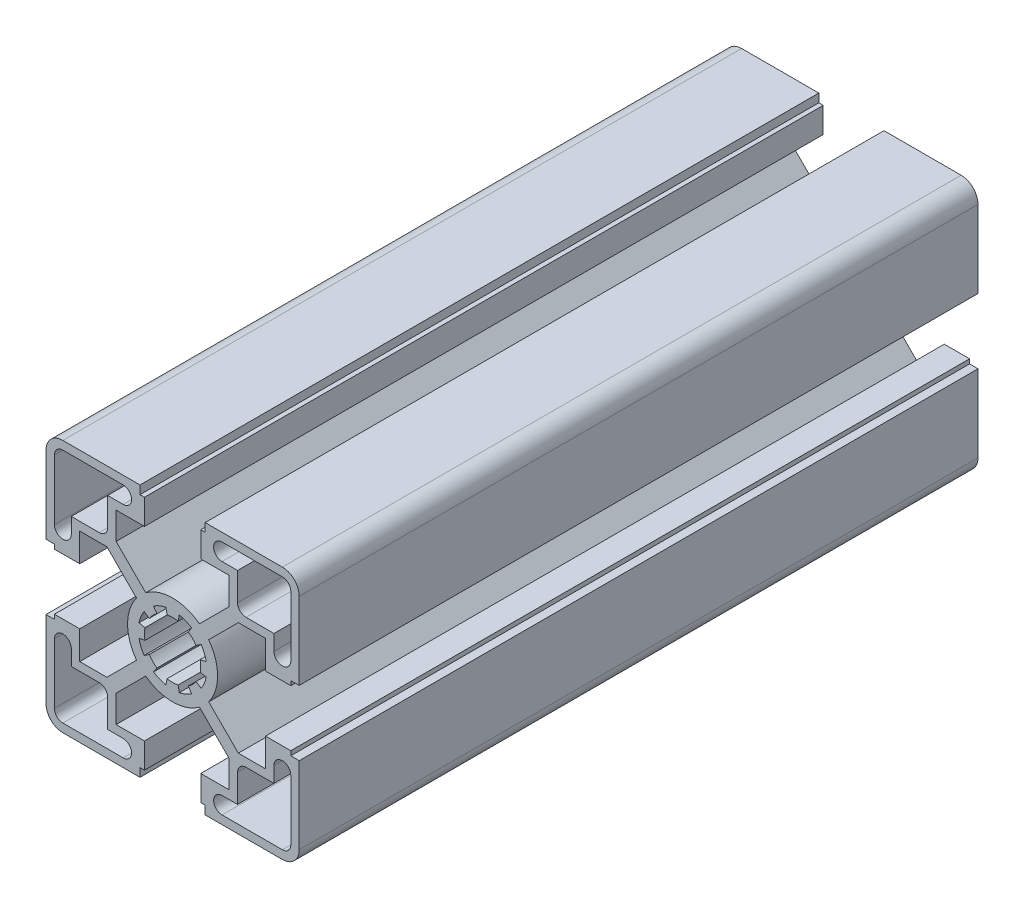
ISO-10303-21;
HEADER;
FILE_DESCRIPTION(('STEP AP214'),'2;1');
FILE_NAME('part.step','',(''),(''),'','','');
FILE_SCHEMA(('AUTOMOTIVE_DESIGN { 1 0 10303 214 1 1 1 1 }'));
ENDSEC;
DATA;
#1=APPLICATION_CONTEXT('core data for automotive mechanical design processes');
#2=APPLICATION_PROTOCOL_DEFINITION('international standard','automotive_design',2000,#1);
#3=PRODUCT_CONTEXT('',#1,'mechanical');
#4=PRODUCT('Part','Part','',(#3));
#5=PRODUCT_RELATED_PRODUCT_CATEGORY('part','',(#4));
#6=PRODUCT_DEFINITION_FORMATION('','',#4);
#7=PRODUCT_DEFINITION_CONTEXT('part definition',#1,'design');
#8=PRODUCT_DEFINITION('design','',#6,#7);
#9=PRODUCT_DEFINITION_SHAPE('','',#8);
#10=(LENGTH_UNIT() NAMED_UNIT(*) SI_UNIT(.MILLI.,.METRE.));
#11=(NAMED_UNIT(*) PLANE_ANGLE_UNIT() SI_UNIT($,.RADIAN.));
#12=(NAMED_UNIT(*) SI_UNIT($,.STERADIAN.) SOLID_ANGLE_UNIT());
#13=UNCERTAINTY_MEASURE_WITH_UNIT(LENGTH_MEASURE(1.E-05),#10,'distance_accuracy_value','');
#14=(GEOMETRIC_REPRESENTATION_CONTEXT(3) GLOBAL_UNCERTAINTY_ASSIGNED_CONTEXT((#13)) GLOBAL_UNIT_ASSIGNED_CONTEXT((#10,
#11,#12)) REPRESENTATION_CONTEXT('',''));
#15=CARTESIAN_POINT('',(0.,0.,0.));
#16=DIRECTION('',(0.,0.,1.));
#17=DIRECTION('',(1.,0.,0.));
#18=AXIS2_PLACEMENT_3D('',#15,#16,#17);
#19=CARTESIAN_POINT('',(0.,0.,60.325));
#20=DIRECTION('',(0.,0.,1.));
#21=DIRECTION('',(1.,0.,0.));
#22=AXIS2_PLACEMENT_3D('',#19,#20,#21);
#23=PLANE('',#22);
#24=DIRECTION('',(1.,0.,0.));
#25=VECTOR('',#24,1.);
#26=CARTESIAN_POINT('',(-16.51,10.0457,60.325));
#27=LINE('',#26,#25);
#28=CARTESIAN_POINT('',(-16.51,10.0457,60.325));
#29=VERTEX_POINT('',#28);
#30=CARTESIAN_POINT('',(-11.6801066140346,10.0457,60.325));
#31=VERTEX_POINT('',#30);
#32=EDGE_CURVE('E1390',#29,#31,#27,.T.);
#33=ORIENTED_EDGE('',*,*,#32,.T.);
#34=DIRECTION('',(0.707106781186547,-0.707106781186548,0.));
#35=VECTOR('',#34,1.);
#36=CARTESIAN_POINT('',(-11.6801066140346,10.0457,60.325));
#37=LINE('',#36,#35);
#38=CARTESIAN_POINT('',(-6.41543331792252,4.78102670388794,60.325));
#39=VERTEX_POINT('',#38);
#40=EDGE_CURVE('E1393',#31,#39,#37,.T.);
#41=ORIENTED_EDGE('',*,*,#40,.T.);
#42=CARTESIAN_POINT('',(0.,0.,60.325));
#43=DIRECTION('',(0.,0.,1.));
#44=DIRECTION('',(1.,0.,0.));
#45=AXIS2_PLACEMENT_3D('',#42,#43,#44);
#46=CIRCLE('',#45,8.001);
#47=CARTESIAN_POINT('',(-6.41543331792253,-4.78102670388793,60.325));
#48=VERTEX_POINT('',#47);
#49=EDGE_CURVE('E1396',#39,#48,#46,.T.);
#50=ORIENTED_EDGE('',*,*,#49,.T.);
#51=DIRECTION('',(-0.707106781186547,-0.707106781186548,0.));
#52=VECTOR('',#51,1.);
#53=CARTESIAN_POINT('',(-11.6801066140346,-10.0457,60.325));
#54=LINE('',#53,#52);
#55=CARTESIAN_POINT('',(-11.6801066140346,-10.0457,60.325));
#56=VERTEX_POINT('',#55);
#57=EDGE_CURVE('E1398',#48,#56,#54,.T.);
#58=ORIENTED_EDGE('',*,*,#57,.T.);
#59=DIRECTION('',(-1.,0.,0.));
#60=VECTOR('',#59,1.);
#61=CARTESIAN_POINT('',(-16.51,-10.0457,60.325));
#62=LINE('',#61,#60);
#63=CARTESIAN_POINT('',(-16.51,-10.0457,60.325));
#64=VERTEX_POINT('',#63);
#65=EDGE_CURVE('E1400',#56,#64,#62,.T.);
#66=ORIENTED_EDGE('',*,*,#65,.T.);
#67=DIRECTION('',(0.,1.,0.));
#68=VECTOR('',#67,1.);
#69=CARTESIAN_POINT('',(-16.51,-5.0038,60.325));
#70=LINE('',#69,#68);
#71=CARTESIAN_POINT('',(-16.51,-5.0038,60.325));
#72=VERTEX_POINT('',#71);
#73=EDGE_CURVE('E1402',#64,#72,#70,.T.);
#74=ORIENTED_EDGE('',*,*,#73,.T.);
#75=DIRECTION('',(-1.,0.,0.));
#76=VECTOR('',#75,1.);
#77=CARTESIAN_POINT('',(-21.0058,-5.0038,60.325));
#78=LINE('',#77,#76);
#79=CARTESIAN_POINT('',(-21.0058,-5.0038,60.325));
#80=VERTEX_POINT('',#79);
#81=EDGE_CURVE('E1404',#72,#80,#78,.T.);
#82=ORIENTED_EDGE('',*,*,#81,.T.);
#83=DIRECTION('',(0.,-1.,0.));
#84=VECTOR('',#83,1.);
#85=CARTESIAN_POINT('',(-21.0058,-5.7912,60.325));
#86=LINE('',#85,#84);
#87=CARTESIAN_POINT('',(-21.0058,-5.7912,60.325));
#88=VERTEX_POINT('',#87);
#89=EDGE_CURVE('E1406',#80,#88,#86,.T.);
#90=ORIENTED_EDGE('',*,*,#89,.T.);
#91=DIRECTION('',(-1.,0.,0.));
#92=VECTOR('',#91,1.);
#93=CARTESIAN_POINT('',(-22.5044,-5.7912,60.325));
#94=LINE('',#93,#92);
#95=CARTESIAN_POINT('',(-22.5044,-5.7912,60.325));
#96=VERTEX_POINT('',#95);
#97=EDGE_CURVE('E1408',#88,#96,#94,.T.);
#98=ORIENTED_EDGE('',*,*,#97,.T.);
#99=DIRECTION('',(0.,-1.,0.));
#100=VECTOR('',#99,1.);
#101=CARTESIAN_POINT('',(-22.5044,-19.5072,60.325));
#102=LINE('',#101,#100);
#103=CARTESIAN_POINT('',(-22.5044,-19.5072,60.325));
#104=VERTEX_POINT('',#103);
#105=EDGE_CURVE('E1410',#96,#104,#102,.T.);
#106=ORIENTED_EDGE('',*,*,#105,.T.);
#107=CARTESIAN_POINT('',(-19.5072,-19.5072,60.325));
#108=DIRECTION('',(0.,0.,1.));
#109=DIRECTION('',(1.,0.,0.));
#110=AXIS2_PLACEMENT_3D('',#107,#108,#109);
#111=CIRCLE('',#110,2.9972);
#112=CARTESIAN_POINT('',(-19.5072,-22.5044,60.325));
#113=VERTEX_POINT('',#112);
#114=EDGE_CURVE('E1412',#104,#113,#111,.T.);
#115=ORIENTED_EDGE('',*,*,#114,.T.);
#116=DIRECTION('',(1.,0.,0.));
#117=VECTOR('',#116,1.);
#118=CARTESIAN_POINT('',(-19.5072,-22.5044,60.325));
#119=LINE('',#118,#117);
#120=CARTESIAN_POINT('',(-5.7912,-22.5044,60.325));
#121=VERTEX_POINT('',#120);
#122=EDGE_CURVE('E1414',#113,#121,#119,.T.);
#123=ORIENTED_EDGE('',*,*,#122,.T.);
#124=DIRECTION('',(0.,1.,0.));
#125=VECTOR('',#124,1.);
#126=CARTESIAN_POINT('',(-5.7912,-22.5044,60.325));
#127=LINE('',#126,#125);
#128=CARTESIAN_POINT('',(-5.7912,-21.0058,60.325));
#129=VERTEX_POINT('',#128);
#130=EDGE_CURVE('E1416',#121,#129,#127,.T.);
#131=ORIENTED_EDGE('',*,*,#130,.T.);
#132=DIRECTION('',(1.,0.,0.));
#133=VECTOR('',#132,1.);
#134=CARTESIAN_POINT('',(-5.7912,-21.0058,60.325));
#135=LINE('',#134,#133);
#136=CARTESIAN_POINT('',(-5.0038,-21.0058,60.325));
#137=VERTEX_POINT('',#136);
#138=EDGE_CURVE('E1418',#129,#137,#135,.T.);
#139=ORIENTED_EDGE('',*,*,#138,.T.);
#140=DIRECTION('',(0.,1.,0.));
#141=VECTOR('',#140,1.);
#142=CARTESIAN_POINT('',(-5.0038,-21.0058,60.325));
#143=LINE('',#142,#141);
#144=CARTESIAN_POINT('',(-5.0038,-16.51,60.325));
#145=VERTEX_POINT('',#144);
#146=EDGE_CURVE('E1420',#137,#145,#143,.T.);
#147=ORIENTED_EDGE('',*,*,#146,.T.);
#148=DIRECTION('',(-1.,0.,0.));
#149=VECTOR('',#148,1.);
#150=CARTESIAN_POINT('',(-5.0038,-16.51,60.325));
#151=LINE('',#150,#149);
#152=CARTESIAN_POINT('',(-10.0457,-16.51,60.325));
#153=VERTEX_POINT('',#152);
#154=EDGE_CURVE('E1422',#145,#153,#151,.T.);
#155=ORIENTED_EDGE('',*,*,#154,.T.);
#156=DIRECTION('',(0.,1.,0.));
#157=VECTOR('',#156,1.);
#158=CARTESIAN_POINT('',(-10.0457,-16.51,60.325));
#159=LINE('',#158,#157);
#160=CARTESIAN_POINT('',(-10.0457,-11.6801066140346,60.325));
#161=VERTEX_POINT('',#160);
#162=EDGE_CURVE('E1424',#153,#161,#159,.T.);
#163=ORIENTED_EDGE('',*,*,#162,.T.);
#164=DIRECTION('',(0.707106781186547,0.707106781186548,0.));
#165=VECTOR('',#164,1.);
#166=CARTESIAN_POINT('',(-10.0457,-11.6801066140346,60.325));
#167=LINE('',#166,#165);
#168=CARTESIAN_POINT('',(-4.78102670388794,-6.41543331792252,60.325));
#169=VERTEX_POINT('',#168);
#170=EDGE_CURVE('E1426',#161,#169,#167,.T.);
#171=ORIENTED_EDGE('',*,*,#170,.T.);
#172=CARTESIAN_POINT('',(0.,0.,60.325));
#173=DIRECTION('',(0.,0.,1.));
#174=DIRECTION('',(1.,0.,0.));
#175=AXIS2_PLACEMENT_3D('',#172,#173,#174);
#176=CIRCLE('',#175,8.001);
#177=CARTESIAN_POINT('',(4.78102670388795,-6.41543331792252,60.325));
#178=VERTEX_POINT('',#177);
#179=EDGE_CURVE('E1428',#169,#178,#176,.T.);
#180=ORIENTED_EDGE('',*,*,#179,.T.);
#181=DIRECTION('',(0.707106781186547,-0.707106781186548,0.));
#182=VECTOR('',#181,1.);
#183=CARTESIAN_POINT('',(10.0457,-11.6801066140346,60.325));
#184=LINE('',#183,#182);
#185=CARTESIAN_POINT('',(10.0457,-11.6801066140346,60.325));
#186=VERTEX_POINT('',#185);
#187=EDGE_CURVE('E1430',#178,#186,#184,.T.);
#188=ORIENTED_EDGE('',*,*,#187,.T.);
#189=DIRECTION('',(0.,-1.,0.));
#190=VECTOR('',#189,1.);
#191=CARTESIAN_POINT('',(10.0457,-16.51,60.325));
#192=LINE('',#191,#190);
#193=CARTESIAN_POINT('',(10.0457,-16.51,60.325));
#194=VERTEX_POINT('',#193);
#195=EDGE_CURVE('E1432',#186,#194,#192,.T.);
#196=ORIENTED_EDGE('',*,*,#195,.T.);
#197=DIRECTION('',(-1.,0.,0.));
#198=VECTOR('',#197,1.);
#199=CARTESIAN_POINT('',(5.00380000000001,-16.51,60.325));
#200=LINE('',#199,#198);
#201=CARTESIAN_POINT('',(5.00380000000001,-16.51,60.325));
#202=VERTEX_POINT('',#201);
#203=EDGE_CURVE('E1434',#194,#202,#200,.T.);
#204=ORIENTED_EDGE('',*,*,#203,.T.);
#205=DIRECTION('',(0.,-1.,0.));
#206=VECTOR('',#205,1.);
#207=CARTESIAN_POINT('',(5.00380000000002,-21.0058,60.325));
#208=LINE('',#207,#206);
#209=CARTESIAN_POINT('',(5.00380000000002,-21.0058,60.325));
#210=VERTEX_POINT('',#209);
#211=EDGE_CURVE('E1436',#202,#210,#208,.T.);
#212=ORIENTED_EDGE('',*,*,#211,.T.);
#213=DIRECTION('',(1.,0.,0.));
#214=VECTOR('',#213,1.);
#215=CARTESIAN_POINT('',(5.79120000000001,-21.0058,60.325));
#216=LINE('',#215,#214);
#217=CARTESIAN_POINT('',(5.79120000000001,-21.0058,60.325));
#218=VERTEX_POINT('',#217);
#219=EDGE_CURVE('E1438',#210,#218,#216,.T.);
#220=ORIENTED_EDGE('',*,*,#219,.T.);
#221=DIRECTION('',(0.,-1.,0.));
#222=VECTOR('',#221,1.);
#223=CARTESIAN_POINT('',(5.79120000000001,-22.5044,60.325));
#224=LINE('',#223,#222);
#225=CARTESIAN_POINT('',(5.79120000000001,-22.5044,60.325));
#226=VERTEX_POINT('',#225);
#227=EDGE_CURVE('E1440',#218,#226,#224,.T.);
#228=ORIENTED_EDGE('',*,*,#227,.T.);
#229=DIRECTION('',(1.,0.,0.));
#230=VECTOR('',#229,1.);
#231=CARTESIAN_POINT('',(19.5072,-22.5044,60.325));
#232=LINE('',#231,#230);
#233=CARTESIAN_POINT('',(19.5072,-22.5044,60.325));
#234=VERTEX_POINT('',#233);
#235=EDGE_CURVE('E1442',#226,#234,#232,.T.);
#236=ORIENTED_EDGE('',*,*,#235,.T.);
#237=CARTESIAN_POINT('',(19.5072,-19.5072,60.325));
#238=DIRECTION('',(0.,0.,1.));
#239=DIRECTION('',(-1.,0.,0.));
#240=AXIS2_PLACEMENT_3D('',#237,#238,#239);
#241=CIRCLE('',#240,2.9972);
#242=CARTESIAN_POINT('',(22.5044,-19.5072,60.325));
#243=VERTEX_POINT('',#242);
#244=EDGE_CURVE('E1444',#234,#243,#241,.T.);
#245=ORIENTED_EDGE('',*,*,#244,.T.);
#246=DIRECTION('',(0.,1.,0.));
#247=VECTOR('',#246,1.);
#248=CARTESIAN_POINT('',(22.5044,-19.5072,60.325));
#249=LINE('',#248,#247);
#250=CARTESIAN_POINT('',(22.5044,-5.7912,60.325));
#251=VERTEX_POINT('',#250);
#252=EDGE_CURVE('E1446',#243,#251,#249,.T.);
#253=ORIENTED_EDGE('',*,*,#252,.T.);
#254=DIRECTION('',(-1.,0.,0.));
#255=VECTOR('',#254,1.);
#256=CARTESIAN_POINT('',(22.5044,-5.7912,60.325));
#257=LINE('',#256,#255);
#258=CARTESIAN_POINT('',(21.0058,-5.7912,60.325));
#259=VERTEX_POINT('',#258);
#260=EDGE_CURVE('E1448',#251,#259,#257,.T.);
#261=ORIENTED_EDGE('',*,*,#260,.T.);
#262=DIRECTION('',(0.,1.,0.));
#263=VECTOR('',#262,1.);
#264=CARTESIAN_POINT('',(21.0058,-5.7912,60.325));
#265=LINE('',#264,#263);
#266=CARTESIAN_POINT('',(21.0058,-5.0038,60.325));
#267=VERTEX_POINT('',#266);
#268=EDGE_CURVE('E1450',#259,#267,#265,.T.);
#269=ORIENTED_EDGE('',*,*,#268,.T.);
#270=DIRECTION('',(-1.,0.,0.));
#271=VECTOR('',#270,1.);
#272=CARTESIAN_POINT('',(21.0058,-5.0038,60.325));
#273=LINE('',#272,#271);
#274=CARTESIAN_POINT('',(16.51,-5.0038,60.325));
#275=VERTEX_POINT('',#274);
#276=EDGE_CURVE('E1452',#267,#275,#273,.T.);
#277=ORIENTED_EDGE('',*,*,#276,.T.);
#278=DIRECTION('',(0.,-1.,0.));
#279=VECTOR('',#278,1.);
#280=CARTESIAN_POINT('',(16.51,-5.0038,60.325));
#281=LINE('',#280,#279);
#282=CARTESIAN_POINT('',(16.51,-10.0457,60.325));
#283=VERTEX_POINT('',#282);
#284=EDGE_CURVE('E1454',#275,#283,#281,.T.);
#285=ORIENTED_EDGE('',*,*,#284,.T.);
#286=DIRECTION('',(-1.,0.,0.));
#287=VECTOR('',#286,1.);
#288=CARTESIAN_POINT('',(16.51,-10.0457,60.325));
#289=LINE('',#288,#287);
#290=CARTESIAN_POINT('',(11.6801066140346,-10.0457,60.325));
#291=VERTEX_POINT('',#290);
#292=EDGE_CURVE('E1456',#283,#291,#289,.T.);
#293=ORIENTED_EDGE('',*,*,#292,.T.);
#294=DIRECTION('',(-0.707106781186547,0.707106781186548,0.));
#295=VECTOR('',#294,1.);
#296=CARTESIAN_POINT('',(11.6801066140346,-10.0457,60.325));
#297=LINE('',#296,#295);
#298=CARTESIAN_POINT('',(6.41543331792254,-4.78102670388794,60.325));
#299=VERTEX_POINT('',#298);
#300=EDGE_CURVE('E1458',#291,#299,#297,.T.);
#301=ORIENTED_EDGE('',*,*,#300,.T.);
#302=CARTESIAN_POINT('',(0.,0.,60.325));
#303=DIRECTION('',(0.,0.,1.));
#304=DIRECTION('',(1.,0.,0.));
#305=AXIS2_PLACEMENT_3D('',#302,#303,#304);
#306=CIRCLE('',#305,8.001);
#307=CARTESIAN_POINT('',(6.41543331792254,4.78102670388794,60.325));
#308=VERTEX_POINT('',#307);
#309=EDGE_CURVE('E1460',#299,#308,#306,.T.);
#310=ORIENTED_EDGE('',*,*,#309,.T.);
#311=DIRECTION('',(0.707106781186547,0.707106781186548,0.));
#312=VECTOR('',#311,1.);
#313=CARTESIAN_POINT('',(11.6801066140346,10.0457,60.325));
#314=LINE('',#313,#312);
#315=CARTESIAN_POINT('',(11.6801066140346,10.0457,60.325));
#316=VERTEX_POINT('',#315);
#317=EDGE_CURVE('E1462',#308,#316,#314,.T.);
#318=ORIENTED_EDGE('',*,*,#317,.T.);
#319=DIRECTION('',(1.,0.,0.));
#320=VECTOR('',#319,1.);
#321=CARTESIAN_POINT('',(16.51,10.0457,60.325));
#322=LINE('',#321,#320);
#323=CARTESIAN_POINT('',(16.51,10.0457,60.325));
#324=VERTEX_POINT('',#323);
#325=EDGE_CURVE('E1464',#316,#324,#322,.T.);
#326=ORIENTED_EDGE('',*,*,#325,.T.);
#327=DIRECTION('',(0.,-1.,0.));
#328=VECTOR('',#327,1.);
#329=CARTESIAN_POINT('',(16.51,5.0038,60.325));
#330=LINE('',#329,#328);
#331=CARTESIAN_POINT('',(16.51,5.0038,60.325));
#332=VERTEX_POINT('',#331);
#333=EDGE_CURVE('E1466',#324,#332,#330,.T.);
#334=ORIENTED_EDGE('',*,*,#333,.T.);
#335=DIRECTION('',(1.,0.,0.));
#336=VECTOR('',#335,1.);
#337=CARTESIAN_POINT('',(21.0058,5.0038,60.325));
#338=LINE('',#337,#336);
#339=CARTESIAN_POINT('',(21.0058,5.0038,60.325));
#340=VERTEX_POINT('',#339);
#341=EDGE_CURVE('E1468',#332,#340,#338,.T.);
#342=ORIENTED_EDGE('',*,*,#341,.T.);
#343=DIRECTION('',(0.,1.,0.));
#344=VECTOR('',#343,1.);
#345=CARTESIAN_POINT('',(21.0058,5.7912,60.325));
#346=LINE('',#345,#344);
#347=CARTESIAN_POINT('',(21.0058,5.7912,60.325));
#348=VERTEX_POINT('',#347);
#349=EDGE_CURVE('E1470',#340,#348,#346,.T.);
#350=ORIENTED_EDGE('',*,*,#349,.T.);
#351=DIRECTION('',(1.,0.,0.));
#352=VECTOR('',#351,1.);
#353=CARTESIAN_POINT('',(22.5044,5.7912,60.325));
#354=LINE('',#353,#352);
#355=CARTESIAN_POINT('',(22.5044,5.7912,60.325));
#356=VERTEX_POINT('',#355);
#357=EDGE_CURVE('E1472',#348,#356,#354,.T.);
#358=ORIENTED_EDGE('',*,*,#357,.T.);
#359=DIRECTION('',(0.,1.,0.));
#360=VECTOR('',#359,1.);
#361=CARTESIAN_POINT('',(22.5044,19.5072,60.325));
#362=LINE('',#361,#360);
#363=CARTESIAN_POINT('',(22.5044,19.5072,60.325));
#364=VERTEX_POINT('',#363);
#365=EDGE_CURVE('E1474',#356,#364,#362,.T.);
#366=ORIENTED_EDGE('',*,*,#365,.T.);
#367=CARTESIAN_POINT('',(19.5072,19.5072,60.325));
#368=DIRECTION('',(0.,0.,1.));
#369=DIRECTION('',(1.,0.,0.));
#370=AXIS2_PLACEMENT_3D('',#367,#368,#369);
#371=CIRCLE('',#370,2.9972);
#372=CARTESIAN_POINT('',(19.5072,22.5044,60.325));
#373=VERTEX_POINT('',#372);
#374=EDGE_CURVE('E1476',#364,#373,#371,.T.);
#375=ORIENTED_EDGE('',*,*,#374,.T.);
#376=DIRECTION('',(-1.,0.,0.));
#377=VECTOR('',#376,1.);
#378=CARTESIAN_POINT('',(19.5072,22.5044,60.325));
#379=LINE('',#378,#377);
#380=CARTESIAN_POINT('',(5.79120000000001,22.5044,60.325));
#381=VERTEX_POINT('',#380);
#382=EDGE_CURVE('E1478',#373,#381,#379,.T.);
#383=ORIENTED_EDGE('',*,*,#382,.T.);
#384=DIRECTION('',(0.,-1.,0.));
#385=VECTOR('',#384,1.);
#386=CARTESIAN_POINT('',(5.79120000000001,22.5044,60.325));
#387=LINE('',#386,#385);
#388=CARTESIAN_POINT('',(5.79120000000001,21.0058,60.325));
#389=VERTEX_POINT('',#388);
#390=EDGE_CURVE('E1480',#381,#389,#387,.T.);
#391=ORIENTED_EDGE('',*,*,#390,.T.);
#392=DIRECTION('',(-1.,0.,0.));
#393=VECTOR('',#392,1.);
#394=CARTESIAN_POINT('',(5.79120000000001,21.0058,60.325));
#395=LINE('',#394,#393);
#396=CARTESIAN_POINT('',(5.00380000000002,21.0058,60.325));
#397=VERTEX_POINT('',#396);
#398=EDGE_CURVE('E1482',#389,#397,#395,.T.);
#399=ORIENTED_EDGE('',*,*,#398,.T.);
#400=DIRECTION('',(0.,-1.,0.));
#401=VECTOR('',#400,1.);
#402=CARTESIAN_POINT('',(5.00380000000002,21.0058,60.325));
#403=LINE('',#402,#401);
#404=CARTESIAN_POINT('',(5.00380000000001,16.51,60.325));
#405=VERTEX_POINT('',#404);
#406=EDGE_CURVE('E1484',#397,#405,#403,.T.);
#407=ORIENTED_EDGE('',*,*,#406,.T.);
#408=DIRECTION('',(1.,0.,0.));
#409=VECTOR('',#408,1.);
#410=CARTESIAN_POINT('',(5.00380000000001,16.51,60.325));
#411=LINE('',#410,#409);
#412=CARTESIAN_POINT('',(10.0457,16.51,60.325));
#413=VERTEX_POINT('',#412);
#414=EDGE_CURVE('E1486',#405,#413,#411,.T.);
#415=ORIENTED_EDGE('',*,*,#414,.T.);
#416=DIRECTION('',(0.,-1.,0.));
#417=VECTOR('',#416,1.);
#418=CARTESIAN_POINT('',(10.0457,16.51,60.325));
#419=LINE('',#418,#417);
#420=CARTESIAN_POINT('',(10.0457,11.6801066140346,60.325));
#421=VERTEX_POINT('',#420);
#422=EDGE_CURVE('E1488',#413,#421,#419,.T.);
#423=ORIENTED_EDGE('',*,*,#422,.T.);
#424=DIRECTION('',(-0.707106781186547,-0.707106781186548,0.));
#425=VECTOR('',#424,1.);
#426=CARTESIAN_POINT('',(10.0457,11.6801066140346,60.325));
#427=LINE('',#426,#425);
#428=CARTESIAN_POINT('',(4.78102670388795,6.41543331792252,60.325));
#429=VERTEX_POINT('',#428);
#430=EDGE_CURVE('E1490',#421,#429,#427,.T.);
#431=ORIENTED_EDGE('',*,*,#430,.T.);
#432=CARTESIAN_POINT('',(0.,0.,60.325));
#433=DIRECTION('',(0.,0.,1.));
#434=DIRECTION('',(1.,0.,0.));
#435=AXIS2_PLACEMENT_3D('',#432,#433,#434);
#436=CIRCLE('',#435,8.001);
#437=CARTESIAN_POINT('',(-4.78102670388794,6.41543331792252,60.325));
#438=VERTEX_POINT('',#437);
#439=EDGE_CURVE('E1492',#429,#438,#436,.T.);
#440=ORIENTED_EDGE('',*,*,#439,.T.);
#441=DIRECTION('',(-0.707106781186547,0.707106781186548,0.));
#442=VECTOR('',#441,1.);
#443=CARTESIAN_POINT('',(-10.0457,11.6801066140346,60.325));
#444=LINE('',#443,#442);
#445=CARTESIAN_POINT('',(-10.0457,11.6801066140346,60.325));
#446=VERTEX_POINT('',#445);
#447=EDGE_CURVE('E1494',#438,#446,#444,.T.);
#448=ORIENTED_EDGE('',*,*,#447,.T.);
#449=DIRECTION('',(0.,1.,0.));
#450=VECTOR('',#449,1.);
#451=CARTESIAN_POINT('',(-10.0457,16.51,60.325));
#452=LINE('',#451,#450);
#453=CARTESIAN_POINT('',(-10.0457,16.51,60.325));
#454=VERTEX_POINT('',#453);
#455=EDGE_CURVE('E1496',#446,#454,#452,.T.);
#456=ORIENTED_EDGE('',*,*,#455,.T.);
#457=DIRECTION('',(1.,0.,0.));
#458=VECTOR('',#457,1.);
#459=CARTESIAN_POINT('',(-5.0038,16.51,60.325));
#460=LINE('',#459,#458);
#461=CARTESIAN_POINT('',(-5.0038,16.51,60.325));
#462=VERTEX_POINT('',#461);
#463=EDGE_CURVE('E1498',#454,#462,#460,.T.);
#464=ORIENTED_EDGE('',*,*,#463,.T.);
#465=DIRECTION('',(0.,1.,0.));
#466=VECTOR('',#465,1.);
#467=CARTESIAN_POINT('',(-5.0038,21.0058,60.325));
#468=LINE('',#467,#466);
#469=CARTESIAN_POINT('',(-5.0038,21.0058,60.325));
#470=VERTEX_POINT('',#469);
#471=EDGE_CURVE('E1500',#462,#470,#468,.T.);
#472=ORIENTED_EDGE('',*,*,#471,.T.);
#473=DIRECTION('',(-1.,0.,0.));
#474=VECTOR('',#473,1.);
#475=CARTESIAN_POINT('',(-5.7912,21.0058,60.325));
#476=LINE('',#475,#474);
#477=CARTESIAN_POINT('',(-5.7912,21.0058,60.325));
#478=VERTEX_POINT('',#477);
#479=EDGE_CURVE('E1502',#470,#478,#476,.T.);
#480=ORIENTED_EDGE('',*,*,#479,.T.);
#481=DIRECTION('',(0.,1.,0.));
#482=VECTOR('',#481,1.);
#483=CARTESIAN_POINT('',(-5.7912,22.5044,60.325));
#484=LINE('',#483,#482);
#485=CARTESIAN_POINT('',(-5.7912,22.5044,60.325));
#486=VERTEX_POINT('',#485);
#487=EDGE_CURVE('E1504',#478,#486,#484,.T.);
#488=ORIENTED_EDGE('',*,*,#487,.T.);
#489=DIRECTION('',(-1.,0.,0.));
#490=VECTOR('',#489,1.);
#491=CARTESIAN_POINT('',(-19.5072,22.5044,60.325));
#492=LINE('',#491,#490);
#493=CARTESIAN_POINT('',(-19.5072,22.5044,60.325));
#494=VERTEX_POINT('',#493);
#495=EDGE_CURVE('E1506',#486,#494,#492,.T.);
#496=ORIENTED_EDGE('',*,*,#495,.T.);
#497=CARTESIAN_POINT('',(-19.5072,19.5072,60.325));
#498=DIRECTION('',(0.,0.,1.));
#499=DIRECTION('',(-1.,0.,0.));
#500=AXIS2_PLACEMENT_3D('',#497,#498,#499);
#501=CIRCLE('',#500,2.9972);
#502=CARTESIAN_POINT('',(-22.5044,19.5072,60.325));
#503=VERTEX_POINT('',#502);
#504=EDGE_CURVE('E1508',#494,#503,#501,.T.);
#505=ORIENTED_EDGE('',*,*,#504,.T.);
#506=DIRECTION('',(0.,-1.,0.));
#507=VECTOR('',#506,1.);
#508=CARTESIAN_POINT('',(-22.5044,19.5072,60.325));
#509=LINE('',#508,#507);
#510=CARTESIAN_POINT('',(-22.5044,5.7912,60.325));
#511=VERTEX_POINT('',#510);
#512=EDGE_CURVE('E1510',#503,#511,#509,.T.);
#513=ORIENTED_EDGE('',*,*,#512,.T.);
#514=DIRECTION('',(1.,0.,0.));
#515=VECTOR('',#514,1.);
#516=CARTESIAN_POINT('',(-22.5044,5.7912,60.325));
#517=LINE('',#516,#515);
#518=CARTESIAN_POINT('',(-21.0058,5.7912,60.325));
#519=VERTEX_POINT('',#518);
#520=EDGE_CURVE('E1512',#511,#519,#517,.T.);
#521=ORIENTED_EDGE('',*,*,#520,.T.);
#522=DIRECTION('',(0.,-1.,0.));
#523=VECTOR('',#522,1.);
#524=CARTESIAN_POINT('',(-21.0058,5.7912,60.325));
#525=LINE('',#524,#523);
#526=CARTESIAN_POINT('',(-21.0058,5.0038,60.325));
#527=VERTEX_POINT('',#526);
#528=EDGE_CURVE('E1514',#519,#527,#525,.T.);
#529=ORIENTED_EDGE('',*,*,#528,.T.);
#530=DIRECTION('',(1.,0.,0.));
#531=VECTOR('',#530,1.);
#532=CARTESIAN_POINT('',(-21.0058,5.0038,60.325));
#533=LINE('',#532,#531);
#534=CARTESIAN_POINT('',(-16.51,5.0038,60.325));
#535=VERTEX_POINT('',#534);
#536=EDGE_CURVE('E1516',#527,#535,#533,.T.);
#537=ORIENTED_EDGE('',*,*,#536,.T.);
#538=DIRECTION('',(0.,1.,0.));
#539=VECTOR('',#538,1.);
#540=CARTESIAN_POINT('',(-16.51,5.0038,60.325));
#541=LINE('',#540,#539);
#542=EDGE_CURVE('E1518',#535,#29,#541,.T.);
#543=ORIENTED_EDGE('',*,*,#542,.T.);
#544=EDGE_LOOP('',(#33,#41,#50,#58,#66,#74,#82,#90,#98,#106,#115,#123,#131,#139,#147,#155,#163,
#171,#180,#188,#196,#204,#212,#220,#228,#236,#245,#253,#261,#269,#277,#285,#293,#301,#310,#318,
#326,#334,#342,#350,#358,#366,#375,#383,#391,#399,#407,#415,#423,#431,#440,#448,#456,#464,#472,
#480,#488,#496,#505,#513,#521,#529,#537,#543));
#545=FACE_BOUND('',#544,.T.);
#546=DIRECTION('',(-1.,0.,0.));
#547=VECTOR('',#546,1.);
#548=CARTESIAN_POINT('',(-19.5072,21.0058,60.325));
#549=LINE('',#548,#547);
#550=CARTESIAN_POINT('',(-8.7884,21.0058,60.325));
#551=VERTEX_POINT('',#550);
#552=CARTESIAN_POINT('',(-19.5072,21.0058,60.325));
#553=VERTEX_POINT('',#552);
#554=EDGE_CURVE('E1319',#551,#553,#549,.T.);
#555=ORIENTED_EDGE('',*,*,#554,.F.);
#556=CARTESIAN_POINT('',(-8.78839999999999,19.5072,60.325));
#557=DIRECTION('',(0.,0.,1.));
#558=DIRECTION('',(-1.,0.,0.));
#559=AXIS2_PLACEMENT_3D('',#556,#557,#558);
#560=CIRCLE('',#559,1.4986);
#561=CARTESIAN_POINT('',(-8.78839999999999,18.0086,60.325));
#562=VERTEX_POINT('',#561);
#563=EDGE_CURVE('E1317',#562,#551,#560,.T.);
#564=ORIENTED_EDGE('',*,*,#563,.F.);
#565=DIRECTION('',(1.,0.,0.));
#566=VECTOR('',#565,1.);
#567=CARTESIAN_POINT('',(-11.5443,18.0086,60.325));
#568=LINE('',#567,#566);
#569=CARTESIAN_POINT('',(-11.5443,18.0086,60.325));
#570=VERTEX_POINT('',#569);
#571=EDGE_CURVE('E1337',#570,#562,#568,.T.);
#572=ORIENTED_EDGE('',*,*,#571,.F.);
#573=DIRECTION('',(0.,1.,0.));
#574=VECTOR('',#573,1.);
#575=CARTESIAN_POINT('',(-11.5443,18.0086,60.325));
#576=LINE('',#575,#574);
#577=CARTESIAN_POINT('',(-11.5443,13.0429,60.325));
#578=VERTEX_POINT('',#577);
#579=EDGE_CURVE('E1334',#578,#570,#576,.T.);
#580=ORIENTED_EDGE('',*,*,#579,.F.);
#581=CARTESIAN_POINT('',(-13.0429,13.0429,60.325));
#582=DIRECTION('',(0.,0.,1.));
#583=DIRECTION('',(-1.,0.,0.));
#584=AXIS2_PLACEMENT_3D('',#581,#582,#583);
#585=CIRCLE('',#584,1.4986);
#586=CARTESIAN_POINT('',(-13.0429,11.5443,60.325));
#587=VERTEX_POINT('',#586);
#588=EDGE_CURVE('E1332',#587,#578,#585,.T.);
#589=ORIENTED_EDGE('',*,*,#588,.F.);
#590=DIRECTION('',(1.,0.,0.));
#591=VECTOR('',#590,1.);
#592=CARTESIAN_POINT('',(-18.0086,11.5443,60.325));
#593=LINE('',#592,#591);
#594=CARTESIAN_POINT('',(-18.0086,11.5443,60.325));
#595=VERTEX_POINT('',#594);
#596=EDGE_CURVE('E1330',#595,#587,#593,.T.);
#597=ORIENTED_EDGE('',*,*,#596,.F.);
#598=DIRECTION('',(0.,1.,0.));
#599=VECTOR('',#598,1.);
#600=CARTESIAN_POINT('',(-18.0086,11.5443,60.325));
#601=LINE('',#600,#599);
#602=CARTESIAN_POINT('',(-18.0086,8.78840000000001,60.325));
#603=VERTEX_POINT('',#602);
#604=EDGE_CURVE('E1328',#603,#595,#601,.T.);
#605=ORIENTED_EDGE('',*,*,#604,.F.);
#606=CARTESIAN_POINT('',(-19.5072,8.7884,60.325));
#607=DIRECTION('',(0.,0.,1.));
#608=DIRECTION('',(1.,0.,0.));
#609=AXIS2_PLACEMENT_3D('',#606,#607,#608);
#610=CIRCLE('',#609,1.4986);
#611=CARTESIAN_POINT('',(-21.0058,8.78840000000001,60.325));
#612=VERTEX_POINT('',#611);
#613=EDGE_CURVE('E1326',#612,#603,#610,.T.);
#614=ORIENTED_EDGE('',*,*,#613,.F.);
#615=DIRECTION('',(0.,-1.,0.));
#616=VECTOR('',#615,1.);
#617=CARTESIAN_POINT('',(-21.0058,19.5072,60.325));
#618=LINE('',#617,#616);
#619=CARTESIAN_POINT('',(-21.0058,19.5072,60.325));
#620=VERTEX_POINT('',#619);
#621=EDGE_CURVE('E1324',#620,#612,#618,.T.);
#622=ORIENTED_EDGE('',*,*,#621,.F.);
#623=CARTESIAN_POINT('',(-19.5072,19.5072,60.325));
#624=DIRECTION('',(0.,0.,1.));
#625=DIRECTION('',(-1.,0.,0.));
#626=AXIS2_PLACEMENT_3D('',#623,#624,#625);
#627=CIRCLE('',#626,1.4986);
#628=EDGE_CURVE('E1322',#553,#620,#627,.T.);
#629=ORIENTED_EDGE('',*,*,#628,.F.);
#630=EDGE_LOOP('',(#555,#564,#572,#580,#589,#597,#605,#614,#622,#629));
#631=FACE_BOUND('',#630,.T.);
#632=DIRECTION('',(1.,0.,0.));
#633=VECTOR('',#632,1.);
#634=CARTESIAN_POINT('',(11.5443,18.0086,60.325));
#635=LINE('',#634,#633);
#636=CARTESIAN_POINT('',(8.78840000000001,18.0086,60.325));
#637=VERTEX_POINT('',#636);
#638=CARTESIAN_POINT('',(11.5443,18.0086,60.325));
#639=VERTEX_POINT('',#638);
#640=EDGE_CURVE('E1246',#637,#639,#635,.T.);
#641=ORIENTED_EDGE('',*,*,#640,.F.);
#642=CARTESIAN_POINT('',(8.78840000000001,19.5072,60.325));
#643=DIRECTION('',(0.,0.,1.));
#644=DIRECTION('',(1.,0.,0.));
#645=AXIS2_PLACEMENT_3D('',#642,#643,#644);
#646=CIRCLE('',#645,1.4986);
#647=CARTESIAN_POINT('',(8.78840000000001,21.0058,60.325));
#648=VERTEX_POINT('',#647);
#649=EDGE_CURVE('E1244',#648,#637,#646,.T.);
#650=ORIENTED_EDGE('',*,*,#649,.F.);
#651=DIRECTION('',(-1.,0.,0.));
#652=VECTOR('',#651,1.);
#653=CARTESIAN_POINT('',(19.5072,21.0058,60.325));
#654=LINE('',#653,#652);
#655=CARTESIAN_POINT('',(19.5072,21.0058,60.325));
#656=VERTEX_POINT('',#655);
#657=EDGE_CURVE('E1264',#656,#648,#654,.T.);
#658=ORIENTED_EDGE('',*,*,#657,.F.);
#659=CARTESIAN_POINT('',(19.5072,19.5072,60.325));
#660=DIRECTION('',(0.,0.,1.));
#661=DIRECTION('',(1.,0.,0.));
#662=AXIS2_PLACEMENT_3D('',#659,#660,#661);
#663=CIRCLE('',#662,1.4986);
#664=CARTESIAN_POINT('',(21.0058,19.5072,60.325));
#665=VERTEX_POINT('',#664);
#666=EDGE_CURVE('E1261',#665,#656,#663,.T.);
#667=ORIENTED_EDGE('',*,*,#666,.F.);
#668=DIRECTION('',(0.,1.,0.));
#669=VECTOR('',#668,1.);
#670=CARTESIAN_POINT('',(21.0058,19.5072,60.325));
#671=LINE('',#670,#669);
#672=CARTESIAN_POINT('',(21.0058,8.7884,60.325));
#673=VERTEX_POINT('',#672);
#674=EDGE_CURVE('E1259',#673,#665,#671,.T.);
#675=ORIENTED_EDGE('',*,*,#674,.F.);
#676=CARTESIAN_POINT('',(19.5072,8.7884,60.325));
#677=DIRECTION('',(0.,0.,1.));
#678=DIRECTION('',(-1.,0.,0.));
#679=AXIS2_PLACEMENT_3D('',#676,#677,#678);
#680=CIRCLE('',#679,1.49860000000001);
#681=CARTESIAN_POINT('',(18.0086,8.7884,60.325));
#682=VERTEX_POINT('',#681);
#683=EDGE_CURVE('E1257',#682,#673,#680,.T.);
#684=ORIENTED_EDGE('',*,*,#683,.F.);
#685=DIRECTION('',(0.,-1.,0.));
#686=VECTOR('',#685,1.);
#687=CARTESIAN_POINT('',(18.0086,11.5443,60.325));
#688=LINE('',#687,#686);
#689=CARTESIAN_POINT('',(18.0086,11.5443,60.325));
#690=VERTEX_POINT('',#689);
#691=EDGE_CURVE('E1255',#690,#682,#688,.T.);
#692=ORIENTED_EDGE('',*,*,#691,.F.);
#693=DIRECTION('',(1.,0.,0.));
#694=VECTOR('',#693,1.);
#695=CARTESIAN_POINT('',(18.0086,11.5443,60.325));
#696=LINE('',#695,#694);
#697=CARTESIAN_POINT('',(13.0429,11.5443,60.325));
#698=VERTEX_POINT('',#697);
#699=EDGE_CURVE('E1253',#698,#690,#696,.T.);
#700=ORIENTED_EDGE('',*,*,#699,.F.);
#701=CARTESIAN_POINT('',(13.0429,13.0429,60.325));
#702=DIRECTION('',(0.,0.,1.));
#703=DIRECTION('',(1.,0.,0.));
#704=AXIS2_PLACEMENT_3D('',#701,#702,#703);
#705=CIRCLE('',#704,1.4986);
#706=CARTESIAN_POINT('',(11.5443,13.0429,60.325));
#707=VERTEX_POINT('',#706);
#708=EDGE_CURVE('E1251',#707,#698,#705,.T.);
#709=ORIENTED_EDGE('',*,*,#708,.F.);
#710=DIRECTION('',(0.,-1.,0.));
#711=VECTOR('',#710,1.);
#712=CARTESIAN_POINT('',(11.5443,18.0086,60.325));
#713=LINE('',#712,#711);
#714=EDGE_CURVE('E1249',#639,#707,#713,.T.);
#715=ORIENTED_EDGE('',*,*,#714,.F.);
#716=EDGE_LOOP('',(#641,#650,#658,#667,#675,#684,#692,#700,#709,#715));
#717=FACE_BOUND('',#716,.T.);
#718=DIRECTION('',(-0.195090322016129,-0.98078528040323,0.));
#719=VECTOR('',#718,1.);
#720=CARTESIAN_POINT('',(1.18927060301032,5.97886706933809,60.325));
#721=LINE('',#720,#719);
#722=CARTESIAN_POINT('',(1.18927060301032,5.97886706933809,60.325));
#723=VERTEX_POINT('',#722);
#724=CARTESIAN_POINT('',(0.976192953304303,4.90765338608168,60.325));
#725=VERTEX_POINT('',#724);
#726=EDGE_CURVE('E1019',#723,#725,#721,.T.);
#727=ORIENTED_EDGE('',*,*,#726,.F.);
#728=CARTESIAN_POINT('',(0.,0.,60.325));
#729=DIRECTION('',(0.,0.,1.));
#730=DIRECTION('',(1.,0.,0.));
#731=AXIS2_PLACEMENT_3D('',#728,#729,#730);
#732=CIRCLE('',#731,6.096);
#733=CARTESIAN_POINT('',(3.3867561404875,5.06863875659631,60.325));
#734=VERTEX_POINT('',#733);
#735=EDGE_CURVE('E1017',#734,#723,#732,.T.);
#736=ORIENTED_EDGE('',*,*,#735,.F.);
#737=DIRECTION('',(0.555570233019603,0.831469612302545,0.));
#738=VECTOR('',#737,1.);
#739=CARTESIAN_POINT('',(3.3867561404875,5.06863875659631,60.325));
#740=LINE('',#739,#738);
#741=CARTESIAN_POINT('',(2.77996233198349,4.16050764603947,60.325));
#742=VERTEX_POINT('',#741);
#743=EDGE_CURVE('E1081',#742,#734,#740,.T.);
#744=ORIENTED_EDGE('',*,*,#743,.F.);
#745=CARTESIAN_POINT('',(0.,0.,60.325));
#746=DIRECTION('',(0.,0.,1.));
#747=DIRECTION('',(1.,0.,0.));
#748=AXIS2_PLACEMENT_3D('',#745,#746,#747);
#749=CIRCLE('',#748,5.00379999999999);
#750=CARTESIAN_POINT('',(4.16050764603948,2.77996233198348,60.325));
#751=VERTEX_POINT('',#750);
#752=EDGE_CURVE('E1078',#751,#742,#749,.T.);
#753=ORIENTED_EDGE('',*,*,#752,.F.);
#754=DIRECTION('',(-0.831469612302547,-0.5555702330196,0.));
#755=VECTOR('',#754,1.);
#756=CARTESIAN_POINT('',(5.06863875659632,3.38675614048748,60.325));
#757=LINE('',#756,#755);
#758=CARTESIAN_POINT('',(5.06863875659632,3.38675614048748,60.325));
#759=VERTEX_POINT('',#758);
#760=EDGE_CURVE('E1076',#759,#751,#757,.T.);
#761=ORIENTED_EDGE('',*,*,#760,.F.);
#762=CARTESIAN_POINT('',(0.,0.,60.325));
#763=DIRECTION('',(0.,0.,1.));
#764=DIRECTION('',(1.,0.,0.));
#765=AXIS2_PLACEMENT_3D('',#762,#763,#764);
#766=CIRCLE('',#765,6.09599999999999);
#767=CARTESIAN_POINT('',(5.9788670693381,1.1892706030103,60.325));
#768=VERTEX_POINT('',#767);
#769=EDGE_CURVE('E1074',#768,#759,#766,.T.);
#770=ORIENTED_EDGE('',*,*,#769,.F.);
#771=DIRECTION('',(0.980785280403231,0.195090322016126,0.));
#772=VECTOR('',#771,1.);
#773=CARTESIAN_POINT('',(5.9788670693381,1.1892706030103,60.325));
#774=LINE('',#773,#772);
#775=CARTESIAN_POINT('',(4.90765338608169,0.976192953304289,60.325));
#776=VERTEX_POINT('',#775);
#777=EDGE_CURVE('E1072',#776,#768,#774,.T.);
#778=ORIENTED_EDGE('',*,*,#777,.F.);
#779=CARTESIAN_POINT('',(0.,0.,60.325));
#780=DIRECTION('',(0.,0.,1.));
#781=DIRECTION('',(1.,0.,0.));
#782=AXIS2_PLACEMENT_3D('',#779,#780,#781);
#783=CIRCLE('',#782,5.00379999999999);
#784=CARTESIAN_POINT('',(4.90765338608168,-0.97619295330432,60.325));
#785=VERTEX_POINT('',#784);
#786=EDGE_CURVE('E1070',#785,#776,#783,.T.);
#787=ORIENTED_EDGE('',*,*,#786,.F.);
#788=DIRECTION('',(-0.98078528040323,0.195090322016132,0.));
#789=VECTOR('',#788,1.);
#790=CARTESIAN_POINT('',(5.97886706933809,-1.18927060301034,60.325));
#791=LINE('',#790,#789);
#792=CARTESIAN_POINT('',(5.97886706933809,-1.18927060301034,60.325));
#793=VERTEX_POINT('',#792);
#794=EDGE_CURVE('E1068',#793,#785,#791,.T.);
#795=ORIENTED_EDGE('',*,*,#794,.F.);
#796=CARTESIAN_POINT('',(0.,0.,60.325));
#797=DIRECTION('',(0.,0.,1.));
#798=DIRECTION('',(1.,0.,0.));
#799=AXIS2_PLACEMENT_3D('',#796,#797,#798);
#800=CIRCLE('',#799,6.09599999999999);
#801=CARTESIAN_POINT('',(5.0686387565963,-3.38675614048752,60.325));
#802=VERTEX_POINT('',#801);
#803=EDGE_CURVE('E1066',#802,#793,#800,.T.);
#804=ORIENTED_EDGE('',*,*,#803,.F.);
#805=DIRECTION('',(0.831469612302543,-0.555570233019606,0.));
#806=VECTOR('',#805,1.);
#807=CARTESIAN_POINT('',(5.0686387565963,-3.38675614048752,60.325));
#808=LINE('',#807,#806);
#809=CARTESIAN_POINT('',(4.16050764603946,-2.7799623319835,60.325));
#810=VERTEX_POINT('',#809);
#811=EDGE_CURVE('E1064',#810,#802,#808,.T.);
#812=ORIENTED_EDGE('',*,*,#811,.F.);
#813=CARTESIAN_POINT('',(0.,0.,60.325));
#814=DIRECTION('',(0.,0.,1.));
#815=DIRECTION('',(1.,0.,0.));
#816=AXIS2_PLACEMENT_3D('',#813,#814,#815);
#817=CIRCLE('',#816,5.00379999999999);
#818=CARTESIAN_POINT('',(2.77996233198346,-4.16050764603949,60.325));
#819=VERTEX_POINT('',#818);
#820=EDGE_CURVE('E1062',#819,#810,#817,.T.);
#821=ORIENTED_EDGE('',*,*,#820,.F.);
#822=DIRECTION('',(-0.555570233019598,0.831469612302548,0.));
#823=VECTOR('',#822,1.);
#824=CARTESIAN_POINT('',(3.38675614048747,-5.06863875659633,60.325));
#825=LINE('',#824,#823);
#826=CARTESIAN_POINT('',(3.38675614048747,-5.06863875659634,60.325));
#827=VERTEX_POINT('',#826);
#828=EDGE_CURVE('E1060',#827,#819,#825,.T.);
#829=ORIENTED_EDGE('',*,*,#828,.F.);
#830=CARTESIAN_POINT('',(0.,0.,60.325));
#831=DIRECTION('',(0.,0.,1.));
#832=DIRECTION('',(1.,0.,0.));
#833=AXIS2_PLACEMENT_3D('',#830,#831,#832);
#834=CIRCLE('',#833,6.096);
#835=CARTESIAN_POINT('',(1.18927060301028,-5.9788670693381,60.325));
#836=VERTEX_POINT('',#835);
#837=EDGE_CURVE('E1058',#836,#827,#834,.T.);
#838=ORIENTED_EDGE('',*,*,#837,.F.);
#839=DIRECTION('',(0.195090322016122,-0.980785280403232,0.));
#840=VECTOR('',#839,1.);
#841=CARTESIAN_POINT('',(1.18927060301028,-5.9788670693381,60.325));
#842=LINE('',#841,#840);
#843=CARTESIAN_POINT('',(0.97619295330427,-4.90765338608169,60.325));
#844=VERTEX_POINT('',#843);
#845=EDGE_CURVE('E1056',#844,#836,#842,.T.);
#846=ORIENTED_EDGE('',*,*,#845,.F.);
#847=CARTESIAN_POINT('',(0.,0.,60.325));
#848=DIRECTION('',(0.,0.,1.));
#849=DIRECTION('',(1.,0.,0.));
#850=AXIS2_PLACEMENT_3D('',#847,#848,#849);
#851=CIRCLE('',#850,5.0038);
#852=CARTESIAN_POINT('',(-0.976192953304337,-4.90765338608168,60.325));
#853=VERTEX_POINT('',#852);
#854=EDGE_CURVE('E1054',#853,#844,#851,.T.);
#855=ORIENTED_EDGE('',*,*,#854,.F.);
#856=DIRECTION('',(0.195090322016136,0.980785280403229,0.));
#857=VECTOR('',#856,1.);
#858=CARTESIAN_POINT('',(-1.18927060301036,-5.97886706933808,60.325));
#859=LINE('',#858,#857);
#860=CARTESIAN_POINT('',(-1.18927060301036,-5.97886706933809,60.325));
#861=VERTEX_POINT('',#860);
#862=EDGE_CURVE('E1052',#861,#853,#859,.T.);
#863=ORIENTED_EDGE('',*,*,#862,.F.);
#864=CARTESIAN_POINT('',(0.,0.,60.325));
#865=DIRECTION('',(0.,0.,1.));
#866=DIRECTION('',(1.,0.,0.));
#867=AXIS2_PLACEMENT_3D('',#864,#865,#866);
#868=CIRCLE('',#867,6.096);
#869=CARTESIAN_POINT('',(-3.38675614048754,-5.06863875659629,60.325));
#870=VERTEX_POINT('',#869);
#871=EDGE_CURVE('E1050',#870,#861,#868,.T.);
#872=ORIENTED_EDGE('',*,*,#871,.F.);
#873=DIRECTION('',(-0.555570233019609,-0.831469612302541,0.));
#874=VECTOR('',#873,1.);
#875=CARTESIAN_POINT('',(-3.38675614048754,-5.06863875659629,60.325));
#876=LINE('',#875,#874);
#877=CARTESIAN_POINT('',(-2.77996233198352,-4.16050764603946,60.325));
#878=VERTEX_POINT('',#877);
#879=EDGE_CURVE('E1048',#878,#870,#876,.T.);
#880=ORIENTED_EDGE('',*,*,#879,.F.);
#881=CARTESIAN_POINT('',(0.,0.,60.325));
#882=DIRECTION('',(0.,0.,1.));
#883=DIRECTION('',(1.,0.,0.));
#884=AXIS2_PLACEMENT_3D('',#881,#882,#883);
#885=CIRCLE('',#884,5.0038);
#886=CARTESIAN_POINT('',(-4.1605076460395,-2.77996233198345,60.325));
#887=VERTEX_POINT('',#886);
#888=EDGE_CURVE('E1046',#887,#878,#885,.T.);
#889=ORIENTED_EDGE('',*,*,#888,.F.);
#890=DIRECTION('',(0.83146961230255,0.555570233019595,0.));
#891=VECTOR('',#890,1.);
#892=CARTESIAN_POINT('',(-5.06863875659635,-3.38675614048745,60.325));
#893=LINE('',#892,#891);
#894=CARTESIAN_POINT('',(-5.06863875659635,-3.38675614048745,60.325));
#895=VERTEX_POINT('',#894);
#896=EDGE_CURVE('E1044',#895,#887,#893,.T.);
#897=ORIENTED_EDGE('',*,*,#896,.F.);
#898=CARTESIAN_POINT('',(0.,0.,60.325));
#899=DIRECTION('',(0.,0.,1.));
#900=DIRECTION('',(1.,0.,0.));
#901=AXIS2_PLACEMENT_3D('',#898,#899,#900);
#902=CIRCLE('',#901,6.09600000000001);
#903=CARTESIAN_POINT('',(-5.9788670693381,-1.18927060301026,60.325));
#904=VERTEX_POINT('',#903);
#905=EDGE_CURVE('E1042',#904,#895,#902,.T.);
#906=ORIENTED_EDGE('',*,*,#905,.F.);
#907=DIRECTION('',(-0.980785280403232,-0.195090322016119,0.));
#908=VECTOR('',#907,1.);
#909=CARTESIAN_POINT('',(-5.9788670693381,-1.18927060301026,60.325));
#910=LINE('',#909,#908);
#911=CARTESIAN_POINT('',(-4.9076533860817,-0.976192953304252,60.325));
#912=VERTEX_POINT('',#911);
#913=EDGE_CURVE('E1040',#912,#904,#910,.T.);
#914=ORIENTED_EDGE('',*,*,#913,.F.);
#915=CARTESIAN_POINT('',(0.,0.,60.325));
#916=DIRECTION('',(0.,0.,1.));
#917=DIRECTION('',(1.,0.,0.));
#918=AXIS2_PLACEMENT_3D('',#915,#916,#917);
#919=CIRCLE('',#918,5.00380000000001);
#920=CARTESIAN_POINT('',(-4.90765338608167,0.976192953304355,60.325));
#921=VERTEX_POINT('',#920);
#922=EDGE_CURVE('E1038',#921,#912,#919,.T.);
#923=ORIENTED_EDGE('',*,*,#922,.F.);
#924=DIRECTION('',(0.980785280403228,-0.195090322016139,0.));
#925=VECTOR('',#924,1.);
#926=CARTESIAN_POINT('',(-5.97886706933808,1.18927060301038,60.325));
#927=LINE('',#926,#925);
#928=CARTESIAN_POINT('',(-5.97886706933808,1.18927060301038,60.325));
#929=VERTEX_POINT('',#928);
#930=EDGE_CURVE('E1036',#929,#921,#927,.T.);
#931=ORIENTED_EDGE('',*,*,#930,.F.);
#932=CARTESIAN_POINT('',(0.,0.,60.325));
#933=DIRECTION('',(0.,0.,1.));
#934=DIRECTION('',(1.,0.,0.));
#935=AXIS2_PLACEMENT_3D('',#932,#933,#934);
#936=CIRCLE('',#935,6.09600000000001);
#937=CARTESIAN_POINT('',(-5.06863875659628,3.38675614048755,60.325));
#938=VERTEX_POINT('',#937);
#939=EDGE_CURVE('E1034',#938,#929,#936,.T.);
#940=ORIENTED_EDGE('',*,*,#939,.F.);
#941=DIRECTION('',(-0.831469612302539,0.555570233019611,0.));
#942=VECTOR('',#941,1.);
#943=CARTESIAN_POINT('',(-5.06863875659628,3.38675614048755,60.325));
#944=LINE('',#943,#942);
#945=CARTESIAN_POINT('',(-4.16050764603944,2.77996233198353,60.325));
#946=VERTEX_POINT('',#945);
#947=EDGE_CURVE('E1032',#946,#938,#944,.T.);
#948=ORIENTED_EDGE('',*,*,#947,.F.);
#949=CARTESIAN_POINT('',(0.,0.,60.325));
#950=DIRECTION('',(0.,0.,1.));
#951=DIRECTION('',(1.,0.,0.));
#952=AXIS2_PLACEMENT_3D('',#949,#950,#951);
#953=CIRCLE('',#952,5.0038);
#954=CARTESIAN_POINT('',(-2.77996233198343,4.16050764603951,60.325));
#955=VERTEX_POINT('',#954);
#956=EDGE_CURVE('E1030',#955,#946,#953,.T.);
#957=ORIENTED_EDGE('',*,*,#956,.F.);
#958=DIRECTION('',(0.555570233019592,-0.831469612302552,0.));
#959=VECTOR('',#958,1.);
#960=CARTESIAN_POINT('',(-3.38675614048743,5.06863875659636,60.325));
#961=LINE('',#960,#959);
#962=CARTESIAN_POINT('',(-3.38675614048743,5.06863875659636,60.325));
#963=VERTEX_POINT('',#962);
#964=EDGE_CURVE('E1028',#963,#955,#961,.T.);
#965=ORIENTED_EDGE('',*,*,#964,.F.);
#966=CARTESIAN_POINT('',(0.,0.,60.325));
#967=DIRECTION('',(0.,0.,1.));
#968=DIRECTION('',(1.,0.,0.));
#969=AXIS2_PLACEMENT_3D('',#966,#967,#968);
#970=CIRCLE('',#969,6.096);
#971=CARTESIAN_POINT('',(-1.18927060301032,5.97886706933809,60.325));
#972=VERTEX_POINT('',#971);
#973=EDGE_CURVE('E1026',#972,#963,#970,.T.);
#974=ORIENTED_EDGE('',*,*,#973,.F.);
#975=DIRECTION('',(-0.195090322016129,0.98078528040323,0.));
#976=VECTOR('',#975,1.);
#977=CARTESIAN_POINT('',(-1.18927060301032,5.97886706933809,60.325));
#978=LINE('',#977,#976);
#979=CARTESIAN_POINT('',(-0.976192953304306,4.90765338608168,60.325));
#980=VERTEX_POINT('',#979);
#981=EDGE_CURVE('E1024',#980,#972,#978,.T.);
#982=ORIENTED_EDGE('',*,*,#981,.F.);
#983=CARTESIAN_POINT('',(0.,0.,60.325));
#984=DIRECTION('',(0.,0.,1.));
#985=DIRECTION('',(1.,0.,0.));
#986=AXIS2_PLACEMENT_3D('',#983,#984,#985);
#987=CIRCLE('',#986,5.0038);
#988=EDGE_CURVE('E1022',#725,#980,#987,.T.);
#989=ORIENTED_EDGE('',*,*,#988,.F.);
#990=EDGE_LOOP('',(#727,#736,#744,#753,#761,#770,#778,#787,#795,#804,#812,#821,#829,#838,#846,
#855,#863,#872,#880,#889,#897,#906,#914,#923,#931,#940,#948,#957,#965,#974,#982,#989));
#991=FACE_BOUND('',#990,.T.);
#992=DIRECTION('',(0.,-1.,0.));
#993=VECTOR('',#992,1.);
#994=CARTESIAN_POINT('',(18.0086,-11.5443,60.325));
#995=LINE('',#994,#993);
#996=CARTESIAN_POINT('',(18.0086,-8.7884,60.325));
#997=VERTEX_POINT('',#996);
#998=CARTESIAN_POINT('',(18.0086,-11.5443,60.325));
#999=VERTEX_POINT('',#998);
#1000=EDGE_CURVE('E946',#997,#999,#995,.T.);
#1001=ORIENTED_EDGE('',*,*,#1000,.F.);
#1002=CARTESIAN_POINT('',(19.5072,-8.7884,60.325));
#1003=DIRECTION('',(0.,0.,1.));
#1004=DIRECTION('',(1.,0.,0.));
#1005=AXIS2_PLACEMENT_3D('',#1002,#1003,#1004);
#1006=CIRCLE('',#1005,1.49860000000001);
#1007=CARTESIAN_POINT('',(21.0058,-8.7884,60.325));
#1008=VERTEX_POINT('',#1007);
#1009=EDGE_CURVE('E944',#1008,#997,#1006,.T.);
#1010=ORIENTED_EDGE('',*,*,#1009,.F.);
#1011=DIRECTION('',(0.,1.,0.));
#1012=VECTOR('',#1011,1.);
#1013=CARTESIAN_POINT('',(21.0058,-19.5072,60.325));
#1014=LINE('',#1013,#1012);
#1015=CARTESIAN_POINT('',(21.0058,-19.5072,60.325));
#1016=VERTEX_POINT('',#1015);
#1017=EDGE_CURVE('E964',#1016,#1008,#1014,.T.);
#1018=ORIENTED_EDGE('',*,*,#1017,.F.);
#1019=CARTESIAN_POINT('',(19.5072,-19.5072,60.325));
#1020=DIRECTION('',(0.,0.,1.));
#1021=DIRECTION('',(-1.,0.,0.));
#1022=AXIS2_PLACEMENT_3D('',#1019,#1020,#1021);
#1023=CIRCLE('',#1022,1.4986);
#1024=CARTESIAN_POINT('',(19.5072,-21.0058,60.325));
#1025=VERTEX_POINT('',#1024);
#1026=EDGE_CURVE('E961',#1025,#1016,#1023,.T.);
#1027=ORIENTED_EDGE('',*,*,#1026,.F.);
#1028=DIRECTION('',(1.,0.,0.));
#1029=VECTOR('',#1028,1.);
#1030=CARTESIAN_POINT('',(19.5072,-21.0058,60.325));
#1031=LINE('',#1030,#1029);
#1032=CARTESIAN_POINT('',(8.78840000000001,-21.0058,60.325));
#1033=VERTEX_POINT('',#1032);
#1034=EDGE_CURVE('E959',#1033,#1025,#1031,.T.);
#1035=ORIENTED_EDGE('',*,*,#1034,.F.);
#1036=CARTESIAN_POINT('',(8.78840000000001,-19.5072,60.325));
#1037=DIRECTION('',(0.,0.,1.));
#1038=DIRECTION('',(-1.,0.,0.));
#1039=AXIS2_PLACEMENT_3D('',#1036,#1037,#1038);
#1040=CIRCLE('',#1039,1.4986);
#1041=CARTESIAN_POINT('',(8.78840000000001,-18.0086,60.325));
#1042=VERTEX_POINT('',#1041);
#1043=EDGE_CURVE('E957',#1042,#1033,#1040,.T.);
#1044=ORIENTED_EDGE('',*,*,#1043,.F.);
#1045=DIRECTION('',(-1.,0.,0.));
#1046=VECTOR('',#1045,1.);
#1047=CARTESIAN_POINT('',(11.5443,-18.0086,60.325));
#1048=LINE('',#1047,#1046);
#1049=CARTESIAN_POINT('',(11.5443,-18.0086,60.325));
#1050=VERTEX_POINT('',#1049);
#1051=EDGE_CURVE('E955',#1050,#1042,#1048,.T.);
#1052=ORIENTED_EDGE('',*,*,#1051,.F.);
#1053=DIRECTION('',(0.,-1.,0.));
#1054=VECTOR('',#1053,1.);
#1055=CARTESIAN_POINT('',(11.5443,-18.0086,60.325));
#1056=LINE('',#1055,#1054);
#1057=CARTESIAN_POINT('',(11.5443,-13.0429,60.325));
#1058=VERTEX_POINT('',#1057);
#1059=EDGE_CURVE('E953',#1058,#1050,#1056,.T.);
#1060=ORIENTED_EDGE('',*,*,#1059,.F.);
#1061=CARTESIAN_POINT('',(13.0429,-13.0429,60.325));
#1062=DIRECTION('',(0.,0.,1.));
#1063=DIRECTION('',(-1.,0.,0.));
#1064=AXIS2_PLACEMENT_3D('',#1061,#1062,#1063);
#1065=CIRCLE('',#1064,1.4986);
#1066=CARTESIAN_POINT('',(13.0429,-11.5443,60.325));
#1067=VERTEX_POINT('',#1066);
#1068=EDGE_CURVE('E951',#1067,#1058,#1065,.T.);
#1069=ORIENTED_EDGE('',*,*,#1068,.F.);
#1070=DIRECTION('',(-1.,0.,0.));
#1071=VECTOR('',#1070,1.);
#1072=CARTESIAN_POINT('',(18.0086,-11.5443,60.325));
#1073=LINE('',#1072,#1071);
#1074=EDGE_CURVE('E949',#999,#1067,#1073,.T.);
#1075=ORIENTED_EDGE('',*,*,#1074,.F.);
#1076=EDGE_LOOP('',(#1001,#1010,#1018,#1027,#1035,#1044,#1052,#1060,#1069,#1075));
#1077=FACE_BOUND('',#1076,.T.);
#1078=DIRECTION('',(-1.,0.,0.));
#1079=VECTOR('',#1078,1.);
#1080=CARTESIAN_POINT('',(-11.5443,-18.0086,60.325));
#1081=LINE('',#1080,#1079);
#1082=CARTESIAN_POINT('',(-8.7884,-18.0086,60.325));
#1083=VERTEX_POINT('',#1082);
#1084=CARTESIAN_POINT('',(-11.5443,-18.0086,60.325));
#1085=VERTEX_POINT('',#1084);
#1086=EDGE_CURVE('E873',#1083,#1085,#1081,.T.);
#1087=ORIENTED_EDGE('',*,*,#1086,.F.);
#1088=CARTESIAN_POINT('',(-8.78839999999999,-19.5072,60.325));
#1089=DIRECTION('',(0.,0.,1.));
#1090=DIRECTION('',(1.,0.,0.));
#1091=AXIS2_PLACEMENT_3D('',#1088,#1089,#1090);
#1092=CIRCLE('',#1091,1.4986);
#1093=CARTESIAN_POINT('',(-8.7884,-21.0058,60.325));
#1094=VERTEX_POINT('',#1093);
#1095=EDGE_CURVE('E865',#1094,#1083,#1092,.T.);
#1096=ORIENTED_EDGE('',*,*,#1095,.F.);
#1097=DIRECTION('',(1.,0.,0.));
#1098=VECTOR('',#1097,1.);
#1099=CARTESIAN_POINT('',(-19.5072,-21.0058,60.325));
#1100=LINE('',#1099,#1098);
#1101=CARTESIAN_POINT('',(-19.5072,-21.0058,60.325));
#1102=VERTEX_POINT('',#1101);
#1103=EDGE_CURVE('E902',#1102,#1094,#1100,.T.);
#1104=ORIENTED_EDGE('',*,*,#1103,.F.);
#1105=CARTESIAN_POINT('',(-19.5072,-19.5072,60.325));
#1106=DIRECTION('',(0.,0.,1.));
#1107=DIRECTION('',(1.,0.,0.));
#1108=AXIS2_PLACEMENT_3D('',#1105,#1106,#1107);
#1109=CIRCLE('',#1108,1.4986);
#1110=CARTESIAN_POINT('',(-21.0058,-19.5072,60.325));
#1111=VERTEX_POINT('',#1110);
#1112=EDGE_CURVE('E900',#1111,#1102,#1109,.T.);
#1113=ORIENTED_EDGE('',*,*,#1112,.F.);
#1114=DIRECTION('',(0.,-1.,0.));
#1115=VECTOR('',#1114,1.);
#1116=CARTESIAN_POINT('',(-21.0058,-19.5072,60.325));
#1117=LINE('',#1116,#1115);
#1118=CARTESIAN_POINT('',(-21.0058,-8.7884,60.325));
#1119=VERTEX_POINT('',#1118);
#1120=EDGE_CURVE('E898',#1119,#1111,#1117,.T.);
#1121=ORIENTED_EDGE('',*,*,#1120,.F.);
#1122=CARTESIAN_POINT('',(-19.5072,-8.7884,60.325));
#1123=DIRECTION('',(0.,0.,1.));
#1124=DIRECTION('',(-1.,0.,0.));
#1125=AXIS2_PLACEMENT_3D('',#1122,#1123,#1124);
#1126=CIRCLE('',#1125,1.49860000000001);
#1127=CARTESIAN_POINT('',(-18.0086,-8.7884,60.325));
#1128=VERTEX_POINT('',#1127);
#1129=EDGE_CURVE('E896',#1128,#1119,#1126,.T.);
#1130=ORIENTED_EDGE('',*,*,#1129,.F.);
#1131=DIRECTION('',(0.,1.,0.));
#1132=VECTOR('',#1131,1.);
#1133=CARTESIAN_POINT('',(-18.0086,-11.5443,60.325));
#1134=LINE('',#1133,#1132);
#1135=CARTESIAN_POINT('',(-18.0086,-11.5443,60.325));
#1136=VERTEX_POINT('',#1135);
#1137=EDGE_CURVE('E894',#1136,#1128,#1134,.T.);
#1138=ORIENTED_EDGE('',*,*,#1137,.F.);
#1139=DIRECTION('',(-1.,0.,0.));
#1140=VECTOR('',#1139,1.);
#1141=CARTESIAN_POINT('',(-18.0086,-11.5443,60.325));
#1142=LINE('',#1141,#1140);
#1143=CARTESIAN_POINT('',(-13.0429,-11.5443,60.325));
#1144=VERTEX_POINT('',#1143);
#1145=EDGE_CURVE('E892',#1144,#1136,#1142,.T.);
#1146=ORIENTED_EDGE('',*,*,#1145,.F.);
#1147=CARTESIAN_POINT('',(-13.0429,-13.0429,60.325));
#1148=DIRECTION('',(0.,0.,1.));
#1149=DIRECTION('',(1.,0.,0.));
#1150=AXIS2_PLACEMENT_3D('',#1147,#1148,#1149);
#1151=CIRCLE('',#1150,1.4986);
#1152=CARTESIAN_POINT('',(-11.5443,-13.0429,60.325));
#1153=VERTEX_POINT('',#1152);
#1154=EDGE_CURVE('E888',#1153,#1144,#1151,.T.);
#1155=ORIENTED_EDGE('',*,*,#1154,.F.);
#1156=DIRECTION('',(0.,1.,0.));
#1157=VECTOR('',#1156,1.);
#1158=CARTESIAN_POINT('',(-11.5443,-18.0086,60.325));
#1159=LINE('',#1158,#1157);
#1160=EDGE_CURVE('E886',#1085,#1153,#1159,.T.);
#1161=ORIENTED_EDGE('',*,*,#1160,.F.);
#1162=EDGE_LOOP('',(#1087,#1096,#1104,#1113,#1121,#1130,#1138,#1146,#1155,#1161));
#1163=FACE_BOUND('',#1162,.T.);
#1164=ADVANCED_FACE('F32',(#545,#631,#717,#991,#1077,#1163),#23,.T.);
#1165=CARTESIAN_POINT('',(0.,0.,-60.325));
#1166=DIRECTION('',(0.,0.,1.));
#1167=DIRECTION('',(1.,0.,0.));
#1168=AXIS2_PLACEMENT_3D('',#1165,#1166,#1167);
#1169=PLANE('',#1168);
#1170=CARTESIAN_POINT('',(19.5072,-8.7884,-60.325));
#1171=DIRECTION('',(0.,0.,1.));
#1172=DIRECTION('',(1.,0.,0.));
#1173=AXIS2_PLACEMENT_3D('',#1170,#1171,#1172);
#1174=CIRCLE('',#1173,1.49860000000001);
#1175=CARTESIAN_POINT('',(21.0058,-8.7884,-60.325));
#1176=VERTEX_POINT('',#1175);
#1177=CARTESIAN_POINT('',(18.0086,-8.7884,-60.325));
#1178=VERTEX_POINT('',#1177);
#1179=EDGE_CURVE('E881',#1176,#1178,#1174,.T.);
#1180=ORIENTED_EDGE('',*,*,#1179,.T.);
#1181=DIRECTION('',(0.,-1.,0.));
#1182=VECTOR('',#1181,1.);
#1183=CARTESIAN_POINT('',(18.0086,-11.5443,-60.325));
#1184=LINE('',#1183,#1182);
#1185=CARTESIAN_POINT('',(18.0086,-11.5443,-60.325));
#1186=VERTEX_POINT('',#1185);
#1187=EDGE_CURVE('E969',#1178,#1186,#1184,.T.);
#1188=ORIENTED_EDGE('',*,*,#1187,.T.);
#1189=DIRECTION('',(-1.,0.,0.));
#1190=VECTOR('',#1189,1.);
#1191=CARTESIAN_POINT('',(18.0086,-11.5443,-60.325));
#1192=LINE('',#1191,#1190);
#1193=CARTESIAN_POINT('',(13.0429,-11.5443,-60.325));
#1194=VERTEX_POINT('',#1193);
#1195=EDGE_CURVE('E972',#1186,#1194,#1192,.T.);
#1196=ORIENTED_EDGE('',*,*,#1195,.T.);
#1197=CARTESIAN_POINT('',(13.0429,-13.0429,-60.325));
#1198=DIRECTION('',(0.,0.,1.));
#1199=DIRECTION('',(-1.,0.,0.));
#1200=AXIS2_PLACEMENT_3D('',#1197,#1198,#1199);
#1201=CIRCLE('',#1200,1.4986);
#1202=CARTESIAN_POINT('',(11.5443,-13.0429,-60.325));
#1203=VERTEX_POINT('',#1202);
#1204=EDGE_CURVE('E975',#1194,#1203,#1201,.T.);
#1205=ORIENTED_EDGE('',*,*,#1204,.T.);
#1206=DIRECTION('',(0.,-1.,0.));
#1207=VECTOR('',#1206,1.);
#1208=CARTESIAN_POINT('',(11.5443,-18.0086,-60.325));
#1209=LINE('',#1208,#1207);
#1210=CARTESIAN_POINT('',(11.5443,-18.0086,-60.325));
#1211=VERTEX_POINT('',#1210);
#1212=EDGE_CURVE('E978',#1203,#1211,#1209,.T.);
#1213=ORIENTED_EDGE('',*,*,#1212,.T.);
#1214=DIRECTION('',(-1.,0.,0.));
#1215=VECTOR('',#1214,1.);
#1216=CARTESIAN_POINT('',(11.5443,-18.0086,-60.325));
#1217=LINE('',#1216,#1215);
#1218=CARTESIAN_POINT('',(8.78840000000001,-18.0086,-60.325));
#1219=VERTEX_POINT('',#1218);
#1220=EDGE_CURVE('E981',#1211,#1219,#1217,.T.);
#1221=ORIENTED_EDGE('',*,*,#1220,.T.);
#1222=CARTESIAN_POINT('',(8.78840000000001,-19.5072,-60.325));
#1223=DIRECTION('',(0.,0.,1.));
#1224=DIRECTION('',(-1.,0.,0.));
#1225=AXIS2_PLACEMENT_3D('',#1222,#1223,#1224);
#1226=CIRCLE('',#1225,1.4986);
#1227=CARTESIAN_POINT('',(8.78840000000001,-21.0058,-60.325));
#1228=VERTEX_POINT('',#1227);
#1229=EDGE_CURVE('E984',#1219,#1228,#1226,.T.);
#1230=ORIENTED_EDGE('',*,*,#1229,.T.);
#1231=DIRECTION('',(1.,0.,0.));
#1232=VECTOR('',#1231,1.);
#1233=CARTESIAN_POINT('',(19.5072,-21.0058,-60.325));
#1234=LINE('',#1233,#1232);
#1235=CARTESIAN_POINT('',(19.5072,-21.0058,-60.325));
#1236=VERTEX_POINT('',#1235);
#1237=EDGE_CURVE('E987',#1228,#1236,#1234,.T.);
#1238=ORIENTED_EDGE('',*,*,#1237,.T.);
#1239=CARTESIAN_POINT('',(19.5072,-19.5072,-60.325));
#1240=DIRECTION('',(0.,0.,1.));
#1241=DIRECTION('',(-1.,0.,0.));
#1242=AXIS2_PLACEMENT_3D('',#1239,#1240,#1241);
#1243=CIRCLE('',#1242,1.4986);
#1244=CARTESIAN_POINT('',(21.0058,-19.5072,-60.325));
#1245=VERTEX_POINT('',#1244);
#1246=EDGE_CURVE('E990',#1236,#1245,#1243,.T.);
#1247=ORIENTED_EDGE('',*,*,#1246,.T.);
#1248=DIRECTION('',(0.,1.,0.));
#1249=VECTOR('',#1248,1.);
#1250=CARTESIAN_POINT('',(21.0058,-19.5072,-60.325));
#1251=LINE('',#1250,#1249);
#1252=EDGE_CURVE('E947',#1245,#1176,#1251,.T.);
#1253=ORIENTED_EDGE('',*,*,#1252,.T.);
#1254=EDGE_LOOP('',(#1180,#1188,#1196,#1205,#1213,#1221,#1230,#1238,#1247,#1253));
#1255=FACE_BOUND('',#1254,.T.);
#1256=CARTESIAN_POINT('',(8.78840000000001,19.5072,-60.325));
#1257=DIRECTION('',(0.,0.,1.));
#1258=DIRECTION('',(1.,0.,0.));
#1259=AXIS2_PLACEMENT_3D('',#1256,#1257,#1258);
#1260=CIRCLE('',#1259,1.4986);
#1261=CARTESIAN_POINT('',(8.78840000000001,21.0058,-60.325));
#1262=VERTEX_POINT('',#1261);
#1263=CARTESIAN_POINT('',(8.78840000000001,18.0086,-60.325));
#1264=VERTEX_POINT('',#1263);
#1265=EDGE_CURVE('E1243',#1262,#1264,#1260,.T.);
#1266=ORIENTED_EDGE('',*,*,#1265,.T.);
#1267=DIRECTION('',(1.,0.,0.));
#1268=VECTOR('',#1267,1.);
#1269=CARTESIAN_POINT('',(11.5443,18.0086,-60.325));
#1270=LINE('',#1269,#1268);
#1271=CARTESIAN_POINT('',(11.5443,18.0086,-60.325));
#1272=VERTEX_POINT('',#1271);
#1273=EDGE_CURVE('E1269',#1264,#1272,#1270,.T.);
#1274=ORIENTED_EDGE('',*,*,#1273,.T.);
#1275=DIRECTION('',(0.,-1.,0.));
#1276=VECTOR('',#1275,1.);
#1277=CARTESIAN_POINT('',(11.5443,18.0086,-60.325));
#1278=LINE('',#1277,#1276);
#1279=CARTESIAN_POINT('',(11.5443,13.0429,-60.325));
#1280=VERTEX_POINT('',#1279);
#1281=EDGE_CURVE('E1272',#1272,#1280,#1278,.T.);
#1282=ORIENTED_EDGE('',*,*,#1281,.T.);
#1283=CARTESIAN_POINT('',(13.0429,13.0429,-60.325));
#1284=DIRECTION('',(0.,0.,1.));
#1285=DIRECTION('',(1.,0.,0.));
#1286=AXIS2_PLACEMENT_3D('',#1283,#1284,#1285);
#1287=CIRCLE('',#1286,1.4986);
#1288=CARTESIAN_POINT('',(13.0429,11.5443,-60.325));
#1289=VERTEX_POINT('',#1288);
#1290=EDGE_CURVE('E1275',#1280,#1289,#1287,.T.);
#1291=ORIENTED_EDGE('',*,*,#1290,.T.);
#1292=DIRECTION('',(1.,0.,0.));
#1293=VECTOR('',#1292,1.);
#1294=CARTESIAN_POINT('',(18.0086,11.5443,-60.325));
#1295=LINE('',#1294,#1293);
#1296=CARTESIAN_POINT('',(18.0086,11.5443,-60.325));
#1297=VERTEX_POINT('',#1296);
#1298=EDGE_CURVE('E1278',#1289,#1297,#1295,.T.);
#1299=ORIENTED_EDGE('',*,*,#1298,.T.);
#1300=DIRECTION('',(0.,-1.,0.));
#1301=VECTOR('',#1300,1.);
#1302=CARTESIAN_POINT('',(18.0086,11.5443,-60.325));
#1303=LINE('',#1302,#1301);
#1304=CARTESIAN_POINT('',(18.0086,8.7884,-60.325));
#1305=VERTEX_POINT('',#1304);
#1306=EDGE_CURVE('E1281',#1297,#1305,#1303,.T.);
#1307=ORIENTED_EDGE('',*,*,#1306,.T.);
#1308=CARTESIAN_POINT('',(19.5072,8.7884,-60.325));
#1309=DIRECTION('',(0.,0.,1.));
#1310=DIRECTION('',(-1.,0.,0.));
#1311=AXIS2_PLACEMENT_3D('',#1308,#1309,#1310);
#1312=CIRCLE('',#1311,1.49860000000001);
#1313=CARTESIAN_POINT('',(21.0058,8.7884,-60.325));
#1314=VERTEX_POINT('',#1313);
#1315=EDGE_CURVE('E1284',#1305,#1314,#1312,.T.);
#1316=ORIENTED_EDGE('',*,*,#1315,.T.);
#1317=DIRECTION('',(0.,1.,0.));
#1318=VECTOR('',#1317,1.);
#1319=CARTESIAN_POINT('',(21.0058,19.5072,-60.325));
#1320=LINE('',#1319,#1318);
#1321=CARTESIAN_POINT('',(21.0058,19.5072,-60.325));
#1322=VERTEX_POINT('',#1321);
#1323=EDGE_CURVE('E1287',#1314,#1322,#1320,.T.);
#1324=ORIENTED_EDGE('',*,*,#1323,.T.);
#1325=CARTESIAN_POINT('',(19.5072,19.5072,-60.325));
#1326=DIRECTION('',(0.,0.,1.));
#1327=DIRECTION('',(1.,0.,0.));
#1328=AXIS2_PLACEMENT_3D('',#1325,#1326,#1327);
#1329=CIRCLE('',#1328,1.4986);
#1330=CARTESIAN_POINT('',(19.5072,21.0058,-60.325));
#1331=VERTEX_POINT('',#1330);
#1332=EDGE_CURVE('E1290',#1322,#1331,#1329,.T.);
#1333=ORIENTED_EDGE('',*,*,#1332,.T.);
#1334=DIRECTION('',(-1.,0.,0.));
#1335=VECTOR('',#1334,1.);
#1336=CARTESIAN_POINT('',(19.5072,21.0058,-60.325));
#1337=LINE('',#1336,#1335);
#1338=EDGE_CURVE('E1247',#1331,#1262,#1337,.T.);
#1339=ORIENTED_EDGE('',*,*,#1338,.T.);
#1340=EDGE_LOOP('',(#1266,#1274,#1282,#1291,#1299,#1307,#1316,#1324,#1333,#1339));
#1341=FACE_BOUND('',#1340,.T.);
#1342=DIRECTION('',(1.,0.,0.));
#1343=VECTOR('',#1342,1.);
#1344=CARTESIAN_POINT('',(-16.51,10.0457,-60.325));
#1345=LINE('',#1344,#1343);
#1346=CARTESIAN_POINT('',(-16.51,10.0457,-60.325));
#1347=VERTEX_POINT('',#1346);
#1348=CARTESIAN_POINT('',(-11.6801066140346,10.0457,-60.325));
#1349=VERTEX_POINT('',#1348);
#1350=EDGE_CURVE('E1389',#1347,#1349,#1345,.T.);
#1351=ORIENTED_EDGE('',*,*,#1350,.F.);
#1352=DIRECTION('',(0.,1.,0.));
#1353=VECTOR('',#1352,1.);
#1354=CARTESIAN_POINT('',(-16.51,5.0038,-60.325));
#1355=LINE('',#1354,#1353);
#1356=CARTESIAN_POINT('',(-16.51,5.0038,-60.325));
#1357=VERTEX_POINT('',#1356);
#1358=EDGE_CURVE('E1394',#1357,#1347,#1355,.T.);
#1359=ORIENTED_EDGE('',*,*,#1358,.F.);
#1360=DIRECTION('',(1.,0.,0.));
#1361=VECTOR('',#1360,1.);
#1362=CARTESIAN_POINT('',(-21.0058,5.0038,-60.325));
#1363=LINE('',#1362,#1361);
#1364=CARTESIAN_POINT('',(-21.0058,5.0038,-60.325));
#1365=VERTEX_POINT('',#1364);
#1366=EDGE_CURVE('E1645',#1365,#1357,#1363,.T.);
#1367=ORIENTED_EDGE('',*,*,#1366,.F.);
#1368=DIRECTION('',(0.,-1.,0.));
#1369=VECTOR('',#1368,1.);
#1370=CARTESIAN_POINT('',(-21.0058,5.7912,-60.325));
#1371=LINE('',#1370,#1369);
#1372=CARTESIAN_POINT('',(-21.0058,5.7912,-60.325));
#1373=VERTEX_POINT('',#1372);
#1374=EDGE_CURVE('E1643',#1373,#1365,#1371,.T.);
#1375=ORIENTED_EDGE('',*,*,#1374,.F.);
#1376=DIRECTION('',(1.,0.,0.));
#1377=VECTOR('',#1376,1.);
#1378=CARTESIAN_POINT('',(-22.5044,5.7912,-60.325));
#1379=LINE('',#1378,#1377);
#1380=CARTESIAN_POINT('',(-22.5044,5.7912,-60.325));
#1381=VERTEX_POINT('',#1380);
#1382=EDGE_CURVE('E1641',#1381,#1373,#1379,.T.);
#1383=ORIENTED_EDGE('',*,*,#1382,.F.);
#1384=DIRECTION('',(0.,-1.,0.));
#1385=VECTOR('',#1384,1.);
#1386=CARTESIAN_POINT('',(-22.5044,19.5072,-60.325));
#1387=LINE('',#1386,#1385);
#1388=CARTESIAN_POINT('',(-22.5044,19.5072,-60.325));
#1389=VERTEX_POINT('',#1388);
#1390=EDGE_CURVE('E1639',#1389,#1381,#1387,.T.);
#1391=ORIENTED_EDGE('',*,*,#1390,.F.);
#1392=CARTESIAN_POINT('',(-19.5072,19.5072,-60.325));
#1393=DIRECTION('',(0.,0.,1.));
#1394=DIRECTION('',(-1.,0.,0.));
#1395=AXIS2_PLACEMENT_3D('',#1392,#1393,#1394);
#1396=CIRCLE('',#1395,2.9972);
#1397=CARTESIAN_POINT('',(-19.5072,22.5044,-60.325));
#1398=VERTEX_POINT('',#1397);
#1399=EDGE_CURVE('E1637',#1398,#1389,#1396,.T.);
#1400=ORIENTED_EDGE('',*,*,#1399,.F.);
#1401=DIRECTION('',(-1.,0.,0.));
#1402=VECTOR('',#1401,1.);
#1403=CARTESIAN_POINT('',(-19.5072,22.5044,-60.325));
#1404=LINE('',#1403,#1402);
#1405=CARTESIAN_POINT('',(-5.7912,22.5044,-60.325));
#1406=VERTEX_POINT('',#1405);
#1407=EDGE_CURVE('E1635',#1406,#1398,#1404,.T.);
#1408=ORIENTED_EDGE('',*,*,#1407,.F.);
#1409=DIRECTION('',(0.,1.,0.));
#1410=VECTOR('',#1409,1.);
#1411=CARTESIAN_POINT('',(-5.7912,22.5044,-60.325));
#1412=LINE('',#1411,#1410);
#1413=CARTESIAN_POINT('',(-5.7912,21.0058,-60.325));
#1414=VERTEX_POINT('',#1413);
#1415=EDGE_CURVE('E1633',#1414,#1406,#1412,.T.);
#1416=ORIENTED_EDGE('',*,*,#1415,.F.);
#1417=DIRECTION('',(-1.,0.,0.));
#1418=VECTOR('',#1417,1.);
#1419=CARTESIAN_POINT('',(-5.7912,21.0058,-60.325));
#1420=LINE('',#1419,#1418);
#1421=CARTESIAN_POINT('',(-5.0038,21.0058,-60.325));
#1422=VERTEX_POINT('',#1421);
#1423=EDGE_CURVE('E1631',#1422,#1414,#1420,.T.);
#1424=ORIENTED_EDGE('',*,*,#1423,.F.);
#1425=DIRECTION('',(0.,1.,0.));
#1426=VECTOR('',#1425,1.);
#1427=CARTESIAN_POINT('',(-5.0038,21.0058,-60.325));
#1428=LINE('',#1427,#1426);
#1429=CARTESIAN_POINT('',(-5.0038,16.51,-60.325));
#1430=VERTEX_POINT('',#1429);
#1431=EDGE_CURVE('E1629',#1430,#1422,#1428,.T.);
#1432=ORIENTED_EDGE('',*,*,#1431,.F.);
#1433=DIRECTION('',(1.,0.,0.));
#1434=VECTOR('',#1433,1.);
#1435=CARTESIAN_POINT('',(-5.0038,16.51,-60.325));
#1436=LINE('',#1435,#1434);
#1437=CARTESIAN_POINT('',(-10.0457,16.51,-60.325));
#1438=VERTEX_POINT('',#1437);
#1439=EDGE_CURVE('E1627',#1438,#1430,#1436,.T.);
#1440=ORIENTED_EDGE('',*,*,#1439,.F.);
#1441=DIRECTION('',(0.,1.,0.));
#1442=VECTOR('',#1441,1.);
#1443=CARTESIAN_POINT('',(-10.0457,16.51,-60.325));
#1444=LINE('',#1443,#1442);
#1445=CARTESIAN_POINT('',(-10.0457,11.6801066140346,-60.325));
#1446=VERTEX_POINT('',#1445);
#1447=EDGE_CURVE('E1625',#1446,#1438,#1444,.T.);
#1448=ORIENTED_EDGE('',*,*,#1447,.F.);
#1449=DIRECTION('',(-0.707106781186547,0.707106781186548,0.));
#1450=VECTOR('',#1449,1.);
#1451=CARTESIAN_POINT('',(-10.0457,11.6801066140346,-60.325));
#1452=LINE('',#1451,#1450);
#1453=CARTESIAN_POINT('',(-4.78102670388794,6.41543331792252,-60.325));
#1454=VERTEX_POINT('',#1453);
#1455=EDGE_CURVE('E1623',#1454,#1446,#1452,.T.);
#1456=ORIENTED_EDGE('',*,*,#1455,.F.);
#1457=CARTESIAN_POINT('',(0.,0.,-60.325));
#1458=DIRECTION('',(0.,0.,1.));
#1459=DIRECTION('',(1.,0.,0.));
#1460=AXIS2_PLACEMENT_3D('',#1457,#1458,#1459);
#1461=CIRCLE('',#1460,8.001);
#1462=CARTESIAN_POINT('',(4.78102670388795,6.41543331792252,-60.325));
#1463=VERTEX_POINT('',#1462);
#1464=EDGE_CURVE('E1621',#1463,#1454,#1461,.T.);
#1465=ORIENTED_EDGE('',*,*,#1464,.F.);
#1466=DIRECTION('',(-0.707106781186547,-0.707106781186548,0.));
#1467=VECTOR('',#1466,1.);
#1468=CARTESIAN_POINT('',(10.0457,11.6801066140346,-60.325));
#1469=LINE('',#1468,#1467);
#1470=CARTESIAN_POINT('',(10.0457,11.6801066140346,-60.325));
#1471=VERTEX_POINT('',#1470);
#1472=EDGE_CURVE('E1619',#1471,#1463,#1469,.T.);
#1473=ORIENTED_EDGE('',*,*,#1472,.F.);
#1474=DIRECTION('',(0.,-1.,0.));
#1475=VECTOR('',#1474,1.);
#1476=CARTESIAN_POINT('',(10.0457,16.51,-60.325));
#1477=LINE('',#1476,#1475);
#1478=CARTESIAN_POINT('',(10.0457,16.51,-60.325));
#1479=VERTEX_POINT('',#1478);
#1480=EDGE_CURVE('E1617',#1479,#1471,#1477,.T.);
#1481=ORIENTED_EDGE('',*,*,#1480,.F.);
#1482=DIRECTION('',(1.,0.,0.));
#1483=VECTOR('',#1482,1.);
#1484=CARTESIAN_POINT('',(5.00380000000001,16.51,-60.325));
#1485=LINE('',#1484,#1483);
#1486=CARTESIAN_POINT('',(5.00380000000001,16.51,-60.325));
#1487=VERTEX_POINT('',#1486);
#1488=EDGE_CURVE('E1615',#1487,#1479,#1485,.T.);
#1489=ORIENTED_EDGE('',*,*,#1488,.F.);
#1490=DIRECTION('',(0.,-1.,0.));
#1491=VECTOR('',#1490,1.);
#1492=CARTESIAN_POINT('',(5.00380000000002,21.0058,-60.325));
#1493=LINE('',#1492,#1491);
#1494=CARTESIAN_POINT('',(5.00380000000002,21.0058,-60.325));
#1495=VERTEX_POINT('',#1494);
#1496=EDGE_CURVE('E1613',#1495,#1487,#1493,.T.);
#1497=ORIENTED_EDGE('',*,*,#1496,.F.);
#1498=DIRECTION('',(-1.,0.,0.));
#1499=VECTOR('',#1498,1.);
#1500=CARTESIAN_POINT('',(5.79120000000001,21.0058,-60.325));
#1501=LINE('',#1500,#1499);
#1502=CARTESIAN_POINT('',(5.79120000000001,21.0058,-60.325));
#1503=VERTEX_POINT('',#1502);
#1504=EDGE_CURVE('E1611',#1503,#1495,#1501,.T.);
#1505=ORIENTED_EDGE('',*,*,#1504,.F.);
#1506=DIRECTION('',(0.,-1.,0.));
#1507=VECTOR('',#1506,1.);
#1508=CARTESIAN_POINT('',(5.79120000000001,22.5044,-60.325));
#1509=LINE('',#1508,#1507);
#1510=CARTESIAN_POINT('',(5.79120000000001,22.5044,-60.325));
#1511=VERTEX_POINT('',#1510);
#1512=EDGE_CURVE('E1609',#1511,#1503,#1509,.T.);
#1513=ORIENTED_EDGE('',*,*,#1512,.F.);
#1514=DIRECTION('',(-1.,0.,0.));
#1515=VECTOR('',#1514,1.);
#1516=CARTESIAN_POINT('',(19.5072,22.5044,-60.325));
#1517=LINE('',#1516,#1515);
#1518=CARTESIAN_POINT('',(19.5072,22.5044,-60.325));
#1519=VERTEX_POINT('',#1518);
#1520=EDGE_CURVE('E1607',#1519,#1511,#1517,.T.);
#1521=ORIENTED_EDGE('',*,*,#1520,.F.);
#1522=CARTESIAN_POINT('',(19.5072,19.5072,-60.325));
#1523=DIRECTION('',(0.,0.,1.));
#1524=DIRECTION('',(1.,0.,0.));
#1525=AXIS2_PLACEMENT_3D('',#1522,#1523,#1524);
#1526=CIRCLE('',#1525,2.9972);
#1527=CARTESIAN_POINT('',(22.5044,19.5072,-60.325));
#1528=VERTEX_POINT('',#1527);
#1529=EDGE_CURVE('E1605',#1528,#1519,#1526,.T.);
#1530=ORIENTED_EDGE('',*,*,#1529,.F.);
#1531=DIRECTION('',(0.,1.,0.));
#1532=VECTOR('',#1531,1.);
#1533=CARTESIAN_POINT('',(22.5044,19.5072,-60.325));
#1534=LINE('',#1533,#1532);
#1535=CARTESIAN_POINT('',(22.5044,5.7912,-60.325));
#1536=VERTEX_POINT('',#1535);
#1537=EDGE_CURVE('E1603',#1536,#1528,#1534,.T.);
#1538=ORIENTED_EDGE('',*,*,#1537,.F.);
#1539=DIRECTION('',(1.,0.,0.));
#1540=VECTOR('',#1539,1.);
#1541=CARTESIAN_POINT('',(22.5044,5.7912,-60.325));
#1542=LINE('',#1541,#1540);
#1543=CARTESIAN_POINT('',(21.0058,5.7912,-60.325));
#1544=VERTEX_POINT('',#1543);
#1545=EDGE_CURVE('E1601',#1544,#1536,#1542,.T.);
#1546=ORIENTED_EDGE('',*,*,#1545,.F.);
#1547=DIRECTION('',(0.,1.,0.));
#1548=VECTOR('',#1547,1.);
#1549=CARTESIAN_POINT('',(21.0058,5.7912,-60.325));
#1550=LINE('',#1549,#1548);
#1551=CARTESIAN_POINT('',(21.0058,5.0038,-60.325));
#1552=VERTEX_POINT('',#1551);
#1553=EDGE_CURVE('E1599',#1552,#1544,#1550,.T.);
#1554=ORIENTED_EDGE('',*,*,#1553,.F.);
#1555=DIRECTION('',(1.,0.,0.));
#1556=VECTOR('',#1555,1.);
#1557=CARTESIAN_POINT('',(21.0058,5.0038,-60.325));
#1558=LINE('',#1557,#1556);
#1559=CARTESIAN_POINT('',(16.51,5.0038,-60.325));
#1560=VERTEX_POINT('',#1559);
#1561=EDGE_CURVE('E1597',#1560,#1552,#1558,.T.);
#1562=ORIENTED_EDGE('',*,*,#1561,.F.);
#1563=DIRECTION('',(0.,-1.,0.));
#1564=VECTOR('',#1563,1.);
#1565=CARTESIAN_POINT('',(16.51,5.0038,-60.325));
#1566=LINE('',#1565,#1564);
#1567=CARTESIAN_POINT('',(16.51,10.0457,-60.325));
#1568=VERTEX_POINT('',#1567);
#1569=EDGE_CURVE('E1595',#1568,#1560,#1566,.T.);
#1570=ORIENTED_EDGE('',*,*,#1569,.F.);
#1571=DIRECTION('',(1.,0.,0.));
#1572=VECTOR('',#1571,1.);
#1573=CARTESIAN_POINT('',(16.51,10.0457,-60.325));
#1574=LINE('',#1573,#1572);
#1575=CARTESIAN_POINT('',(11.6801066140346,10.0457,-60.325));
#1576=VERTEX_POINT('',#1575);
#1577=EDGE_CURVE('E1593',#1576,#1568,#1574,.T.);
#1578=ORIENTED_EDGE('',*,*,#1577,.F.);
#1579=DIRECTION('',(0.707106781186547,0.707106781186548,0.));
#1580=VECTOR('',#1579,1.);
#1581=CARTESIAN_POINT('',(11.6801066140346,10.0457,-60.325));
#1582=LINE('',#1581,#1580);
#1583=CARTESIAN_POINT('',(6.41543331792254,4.78102670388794,-60.325));
#1584=VERTEX_POINT('',#1583);
#1585=EDGE_CURVE('E1591',#1584,#1576,#1582,.T.);
#1586=ORIENTED_EDGE('',*,*,#1585,.F.);
#1587=CARTESIAN_POINT('',(0.,0.,-60.325));
#1588=DIRECTION('',(0.,0.,1.));
#1589=DIRECTION('',(1.,0.,0.));
#1590=AXIS2_PLACEMENT_3D('',#1587,#1588,#1589);
#1591=CIRCLE('',#1590,8.001);
#1592=CARTESIAN_POINT('',(6.41543331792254,-4.78102670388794,-60.325));
#1593=VERTEX_POINT('',#1592);
#1594=EDGE_CURVE('E1589',#1593,#1584,#1591,.T.);
#1595=ORIENTED_EDGE('',*,*,#1594,.F.);
#1596=DIRECTION('',(-0.707106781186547,0.707106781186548,0.));
#1597=VECTOR('',#1596,1.);
#1598=CARTESIAN_POINT('',(11.6801066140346,-10.0457,-60.325));
#1599=LINE('',#1598,#1597);
#1600=CARTESIAN_POINT('',(11.6801066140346,-10.0457,-60.325));
#1601=VERTEX_POINT('',#1600);
#1602=EDGE_CURVE('E1587',#1601,#1593,#1599,.T.);
#1603=ORIENTED_EDGE('',*,*,#1602,.F.);
#1604=DIRECTION('',(-1.,0.,0.));
#1605=VECTOR('',#1604,1.);
#1606=CARTESIAN_POINT('',(16.51,-10.0457,-60.325));
#1607=LINE('',#1606,#1605);
#1608=CARTESIAN_POINT('',(16.51,-10.0457,-60.325));
#1609=VERTEX_POINT('',#1608);
#1610=EDGE_CURVE('E1585',#1609,#1601,#1607,.T.);
#1611=ORIENTED_EDGE('',*,*,#1610,.F.);
#1612=DIRECTION('',(0.,-1.,0.));
#1613=VECTOR('',#1612,1.);
#1614=CARTESIAN_POINT('',(16.51,-5.0038,-60.325));
#1615=LINE('',#1614,#1613);
#1616=CARTESIAN_POINT('',(16.51,-5.0038,-60.325));
#1617=VERTEX_POINT('',#1616);
#1618=EDGE_CURVE('E1583',#1617,#1609,#1615,.T.);
#1619=ORIENTED_EDGE('',*,*,#1618,.F.);
#1620=DIRECTION('',(-1.,0.,0.));
#1621=VECTOR('',#1620,1.);
#1622=CARTESIAN_POINT('',(21.0058,-5.0038,-60.325));
#1623=LINE('',#1622,#1621);
#1624=CARTESIAN_POINT('',(21.0058,-5.0038,-60.325));
#1625=VERTEX_POINT('',#1624);
#1626=EDGE_CURVE('E1581',#1625,#1617,#1623,.T.);
#1627=ORIENTED_EDGE('',*,*,#1626,.F.);
#1628=DIRECTION('',(0.,1.,0.));
#1629=VECTOR('',#1628,1.);
#1630=CARTESIAN_POINT('',(21.0058,-5.7912,-60.325));
#1631=LINE('',#1630,#1629);
#1632=CARTESIAN_POINT('',(21.0058,-5.7912,-60.325));
#1633=VERTEX_POINT('',#1632);
#1634=EDGE_CURVE('E1579',#1633,#1625,#1631,.T.);
#1635=ORIENTED_EDGE('',*,*,#1634,.F.);
#1636=DIRECTION('',(-1.,0.,0.));
#1637=VECTOR('',#1636,1.);
#1638=CARTESIAN_POINT('',(22.5044,-5.7912,-60.325));
#1639=LINE('',#1638,#1637);
#1640=CARTESIAN_POINT('',(22.5044,-5.7912,-60.325));
#1641=VERTEX_POINT('',#1640);
#1642=EDGE_CURVE('E1577',#1641,#1633,#1639,.T.);
#1643=ORIENTED_EDGE('',*,*,#1642,.F.);
#1644=DIRECTION('',(0.,1.,0.));
#1645=VECTOR('',#1644,1.);
#1646=CARTESIAN_POINT('',(22.5044,-19.5072,-60.325));
#1647=LINE('',#1646,#1645);
#1648=CARTESIAN_POINT('',(22.5044,-19.5072,-60.325));
#1649=VERTEX_POINT('',#1648);
#1650=EDGE_CURVE('E1575',#1649,#1641,#1647,.T.);
#1651=ORIENTED_EDGE('',*,*,#1650,.F.);
#1652=CARTESIAN_POINT('',(19.5072,-19.5072,-60.325));
#1653=DIRECTION('',(0.,0.,1.));
#1654=DIRECTION('',(-1.,0.,0.));
#1655=AXIS2_PLACEMENT_3D('',#1652,#1653,#1654);
#1656=CIRCLE('',#1655,2.9972);
#1657=CARTESIAN_POINT('',(19.5072,-22.5044,-60.325));
#1658=VERTEX_POINT('',#1657);
#1659=EDGE_CURVE('E1573',#1658,#1649,#1656,.T.);
#1660=ORIENTED_EDGE('',*,*,#1659,.F.);
#1661=DIRECTION('',(1.,0.,0.));
#1662=VECTOR('',#1661,1.);
#1663=CARTESIAN_POINT('',(19.5072,-22.5044,-60.325));
#1664=LINE('',#1663,#1662);
#1665=CARTESIAN_POINT('',(5.79120000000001,-22.5044,-60.325));
#1666=VERTEX_POINT('',#1665);
#1667=EDGE_CURVE('E1571',#1666,#1658,#1664,.T.);
#1668=ORIENTED_EDGE('',*,*,#1667,.F.);
#1669=DIRECTION('',(0.,-1.,0.));
#1670=VECTOR('',#1669,1.);
#1671=CARTESIAN_POINT('',(5.79120000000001,-22.5044,-60.325));
#1672=LINE('',#1671,#1670);
#1673=CARTESIAN_POINT('',(5.79120000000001,-21.0058,-60.325));
#1674=VERTEX_POINT('',#1673);
#1675=EDGE_CURVE('E1569',#1674,#1666,#1672,.T.);
#1676=ORIENTED_EDGE('',*,*,#1675,.F.);
#1677=DIRECTION('',(1.,0.,0.));
#1678=VECTOR('',#1677,1.);
#1679=CARTESIAN_POINT('',(5.79120000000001,-21.0058,-60.325));
#1680=LINE('',#1679,#1678);
#1681=CARTESIAN_POINT('',(5.00380000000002,-21.0058,-60.325));
#1682=VERTEX_POINT('',#1681);
#1683=EDGE_CURVE('E1567',#1682,#1674,#1680,.T.);
#1684=ORIENTED_EDGE('',*,*,#1683,.F.);
#1685=DIRECTION('',(0.,-1.,0.));
#1686=VECTOR('',#1685,1.);
#1687=CARTESIAN_POINT('',(5.00380000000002,-21.0058,-60.325));
#1688=LINE('',#1687,#1686);
#1689=CARTESIAN_POINT('',(5.00380000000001,-16.51,-60.325));
#1690=VERTEX_POINT('',#1689);
#1691=EDGE_CURVE('E1565',#1690,#1682,#1688,.T.);
#1692=ORIENTED_EDGE('',*,*,#1691,.F.);
#1693=DIRECTION('',(-1.,0.,0.));
#1694=VECTOR('',#1693,1.);
#1695=CARTESIAN_POINT('',(5.00380000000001,-16.51,-60.325));
#1696=LINE('',#1695,#1694);
#1697=CARTESIAN_POINT('',(10.0457,-16.51,-60.325));
#1698=VERTEX_POINT('',#1697);
#1699=EDGE_CURVE('E1563',#1698,#1690,#1696,.T.);
#1700=ORIENTED_EDGE('',*,*,#1699,.F.);
#1701=DIRECTION('',(0.,-1.,0.));
#1702=VECTOR('',#1701,1.);
#1703=CARTESIAN_POINT('',(10.0457,-16.51,-60.325));
#1704=LINE('',#1703,#1702);
#1705=CARTESIAN_POINT('',(10.0457,-11.6801066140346,-60.325));
#1706=VERTEX_POINT('',#1705);
#1707=EDGE_CURVE('E1561',#1706,#1698,#1704,.T.);
#1708=ORIENTED_EDGE('',*,*,#1707,.F.);
#1709=DIRECTION('',(0.707106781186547,-0.707106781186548,0.));
#1710=VECTOR('',#1709,1.);
#1711=CARTESIAN_POINT('',(10.0457,-11.6801066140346,-60.325));
#1712=LINE('',#1711,#1710);
#1713=CARTESIAN_POINT('',(4.78102670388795,-6.41543331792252,-60.325));
#1714=VERTEX_POINT('',#1713);
#1715=EDGE_CURVE('E1559',#1714,#1706,#1712,.T.);
#1716=ORIENTED_EDGE('',*,*,#1715,.F.);
#1717=CARTESIAN_POINT('',(0.,0.,-60.325));
#1718=DIRECTION('',(0.,0.,1.));
#1719=DIRECTION('',(1.,0.,0.));
#1720=AXIS2_PLACEMENT_3D('',#1717,#1718,#1719);
#1721=CIRCLE('',#1720,8.001);
#1722=CARTESIAN_POINT('',(-4.78102670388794,-6.41543331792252,-60.325));
#1723=VERTEX_POINT('',#1722);
#1724=EDGE_CURVE('E1557',#1723,#1714,#1721,.T.);
#1725=ORIENTED_EDGE('',*,*,#1724,.F.);
#1726=DIRECTION('',(0.707106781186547,0.707106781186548,0.));
#1727=VECTOR('',#1726,1.);
#1728=CARTESIAN_POINT('',(-10.0457,-11.6801066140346,-60.325));
#1729=LINE('',#1728,#1727);
#1730=CARTESIAN_POINT('',(-10.0457,-11.6801066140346,-60.325));
#1731=VERTEX_POINT('',#1730);
#1732=EDGE_CURVE('E1555',#1731,#1723,#1729,.T.);
#1733=ORIENTED_EDGE('',*,*,#1732,.F.);
#1734=DIRECTION('',(0.,1.,0.));
#1735=VECTOR('',#1734,1.);
#1736=CARTESIAN_POINT('',(-10.0457,-16.51,-60.325));
#1737=LINE('',#1736,#1735);
#1738=CARTESIAN_POINT('',(-10.0457,-16.51,-60.325));
#1739=VERTEX_POINT('',#1738);
#1740=EDGE_CURVE('E1553',#1739,#1731,#1737,.T.);
#1741=ORIENTED_EDGE('',*,*,#1740,.F.);
#1742=DIRECTION('',(-1.,0.,0.));
#1743=VECTOR('',#1742,1.);
#1744=CARTESIAN_POINT('',(-5.0038,-16.51,-60.325));
#1745=LINE('',#1744,#1743);
#1746=CARTESIAN_POINT('',(-5.0038,-16.51,-60.325));
#1747=VERTEX_POINT('',#1746);
#1748=EDGE_CURVE('E1551',#1747,#1739,#1745,.T.);
#1749=ORIENTED_EDGE('',*,*,#1748,.F.);
#1750=DIRECTION('',(0.,1.,0.));
#1751=VECTOR('',#1750,1.);
#1752=CARTESIAN_POINT('',(-5.0038,-21.0058,-60.325));
#1753=LINE('',#1752,#1751);
#1754=CARTESIAN_POINT('',(-5.0038,-21.0058,-60.325));
#1755=VERTEX_POINT('',#1754);
#1756=EDGE_CURVE('E1549',#1755,#1747,#1753,.T.);
#1757=ORIENTED_EDGE('',*,*,#1756,.F.);
#1758=DIRECTION('',(1.,0.,0.));
#1759=VECTOR('',#1758,1.);
#1760=CARTESIAN_POINT('',(-5.7912,-21.0058,-60.325));
#1761=LINE('',#1760,#1759);
#1762=CARTESIAN_POINT('',(-5.7912,-21.0058,-60.325));
#1763=VERTEX_POINT('',#1762);
#1764=EDGE_CURVE('E1547',#1763,#1755,#1761,.T.);
#1765=ORIENTED_EDGE('',*,*,#1764,.F.);
#1766=DIRECTION('',(0.,1.,0.));
#1767=VECTOR('',#1766,1.);
#1768=CARTESIAN_POINT('',(-5.7912,-22.5044,-60.325));
#1769=LINE('',#1768,#1767);
#1770=CARTESIAN_POINT('',(-5.7912,-22.5044,-60.325));
#1771=VERTEX_POINT('',#1770);
#1772=EDGE_CURVE('E1545',#1771,#1763,#1769,.T.);
#1773=ORIENTED_EDGE('',*,*,#1772,.F.);
#1774=DIRECTION('',(1.,0.,0.));
#1775=VECTOR('',#1774,1.);
#1776=CARTESIAN_POINT('',(-19.5072,-22.5044,-60.325));
#1777=LINE('',#1776,#1775);
#1778=CARTESIAN_POINT('',(-19.5072,-22.5044,-60.325));
#1779=VERTEX_POINT('',#1778);
#1780=EDGE_CURVE('E1543',#1779,#1771,#1777,.T.);
#1781=ORIENTED_EDGE('',*,*,#1780,.F.);
#1782=CARTESIAN_POINT('',(-19.5072,-19.5072,-60.325));
#1783=DIRECTION('',(0.,0.,1.));
#1784=DIRECTION('',(1.,0.,0.));
#1785=AXIS2_PLACEMENT_3D('',#1782,#1783,#1784);
#1786=CIRCLE('',#1785,2.9972);
#1787=CARTESIAN_POINT('',(-22.5044,-19.5072,-60.325));
#1788=VERTEX_POINT('',#1787);
#1789=EDGE_CURVE('E1541',#1788,#1779,#1786,.T.);
#1790=ORIENTED_EDGE('',*,*,#1789,.F.);
#1791=DIRECTION('',(0.,-1.,0.));
#1792=VECTOR('',#1791,1.);
#1793=CARTESIAN_POINT('',(-22.5044,-19.5072,-60.325));
#1794=LINE('',#1793,#1792);
#1795=CARTESIAN_POINT('',(-22.5044,-5.7912,-60.325));
#1796=VERTEX_POINT('',#1795);
#1797=EDGE_CURVE('E1539',#1796,#1788,#1794,.T.);
#1798=ORIENTED_EDGE('',*,*,#1797,.F.);
#1799=DIRECTION('',(-1.,0.,0.));
#1800=VECTOR('',#1799,1.);
#1801=CARTESIAN_POINT('',(-22.5044,-5.7912,-60.325));
#1802=LINE('',#1801,#1800);
#1803=CARTESIAN_POINT('',(-21.0058,-5.7912,-60.325));
#1804=VERTEX_POINT('',#1803);
#1805=EDGE_CURVE('E1537',#1804,#1796,#1802,.T.);
#1806=ORIENTED_EDGE('',*,*,#1805,.F.);
#1807=DIRECTION('',(0.,-1.,0.));
#1808=VECTOR('',#1807,1.);
#1809=CARTESIAN_POINT('',(-21.0058,-5.7912,-60.325));
#1810=LINE('',#1809,#1808);
#1811=CARTESIAN_POINT('',(-21.0058,-5.0038,-60.325));
#1812=VERTEX_POINT('',#1811);
#1813=EDGE_CURVE('E1535',#1812,#1804,#1810,.T.);
#1814=ORIENTED_EDGE('',*,*,#1813,.F.);
#1815=DIRECTION('',(-1.,0.,0.));
#1816=VECTOR('',#1815,1.);
#1817=CARTESIAN_POINT('',(-21.0058,-5.0038,-60.325));
#1818=LINE('',#1817,#1816);
#1819=CARTESIAN_POINT('',(-16.51,-5.0038,-60.325));
#1820=VERTEX_POINT('',#1819);
#1821=EDGE_CURVE('E1533',#1820,#1812,#1818,.T.);
#1822=ORIENTED_EDGE('',*,*,#1821,.F.);
#1823=DIRECTION('',(0.,1.,0.));
#1824=VECTOR('',#1823,1.);
#1825=CARTESIAN_POINT('',(-16.51,-5.0038,-60.325));
#1826=LINE('',#1825,#1824);
#1827=CARTESIAN_POINT('',(-16.51,-10.0457,-60.325));
#1828=VERTEX_POINT('',#1827);
#1829=EDGE_CURVE('E1531',#1828,#1820,#1826,.T.);
#1830=ORIENTED_EDGE('',*,*,#1829,.F.);
#1831=DIRECTION('',(-1.,0.,0.));
#1832=VECTOR('',#1831,1.);
#1833=CARTESIAN_POINT('',(-16.51,-10.0457,-60.325));
#1834=LINE('',#1833,#1832);
#1835=CARTESIAN_POINT('',(-11.6801066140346,-10.0457,-60.325));
#1836=VERTEX_POINT('',#1835);
#1837=EDGE_CURVE('E1529',#1836,#1828,#1834,.T.);
#1838=ORIENTED_EDGE('',*,*,#1837,.F.);
#1839=DIRECTION('',(-0.707106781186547,-0.707106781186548,0.));
#1840=VECTOR('',#1839,1.);
#1841=CARTESIAN_POINT('',(-11.6801066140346,-10.0457,-60.325));
#1842=LINE('',#1841,#1840);
#1843=CARTESIAN_POINT('',(-6.41543331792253,-4.78102670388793,-60.325));
#1844=VERTEX_POINT('',#1843);
#1845=EDGE_CURVE('E1527',#1844,#1836,#1842,.T.);
#1846=ORIENTED_EDGE('',*,*,#1845,.F.);
#1847=CARTESIAN_POINT('',(0.,0.,-60.325));
#1848=DIRECTION('',(0.,0.,1.));
#1849=DIRECTION('',(1.,0.,0.));
#1850=AXIS2_PLACEMENT_3D('',#1847,#1848,#1849);
#1851=CIRCLE('',#1850,8.001);
#1852=CARTESIAN_POINT('',(-6.41543331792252,4.78102670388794,-60.325));
#1853=VERTEX_POINT('',#1852);
#1854=EDGE_CURVE('E1525',#1853,#1844,#1851,.T.);
#1855=ORIENTED_EDGE('',*,*,#1854,.F.);
#1856=DIRECTION('',(0.707106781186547,-0.707106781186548,0.));
#1857=VECTOR('',#1856,1.);
#1858=CARTESIAN_POINT('',(-11.6801066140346,10.0457,-60.325));
#1859=LINE('',#1858,#1857);
#1860=EDGE_CURVE('E1523',#1349,#1853,#1859,.T.);
#1861=ORIENTED_EDGE('',*,*,#1860,.F.);
#1862=EDGE_LOOP('',(#1351,#1359,#1367,#1375,#1383,#1391,#1400,#1408,#1416,#1424,#1432,#1440,
#1448,#1456,#1465,#1473,#1481,#1489,#1497,#1505,#1513,#1521,#1530,#1538,#1546,#1554,#1562,#1570,
#1578,#1586,#1595,#1603,#1611,#1619,#1627,#1635,#1643,#1651,#1660,#1668,#1676,#1684,#1692,#1700,
#1708,#1716,#1725,#1733,#1741,#1749,#1757,#1765,#1773,#1781,#1790,#1798,#1806,#1814,#1822,#1830,
#1838,#1846,#1855,#1861));
#1863=FACE_BOUND('',#1862,.T.);
#1864=CARTESIAN_POINT('',(-8.78839999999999,19.5072,-60.325));
#1865=DIRECTION('',(0.,0.,1.));
#1866=DIRECTION('',(-1.,0.,0.));
#1867=AXIS2_PLACEMENT_3D('',#1864,#1865,#1866);
#1868=CIRCLE('',#1867,1.4986);
#1869=CARTESIAN_POINT('',(-8.78839999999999,18.0086,-60.325));
#1870=VERTEX_POINT('',#1869);
#1871=CARTESIAN_POINT('',(-8.7884,21.0058,-60.325));
#1872=VERTEX_POINT('',#1871);
#1873=EDGE_CURVE('E1316',#1870,#1872,#1868,.T.);
#1874=ORIENTED_EDGE('',*,*,#1873,.T.);
#1875=DIRECTION('',(-1.,0.,0.));
#1876=VECTOR('',#1875,1.);
#1877=CARTESIAN_POINT('',(-19.5072,21.0058,-60.325));
#1878=LINE('',#1877,#1876);
#1879=CARTESIAN_POINT('',(-19.5072,21.0058,-60.325));
#1880=VERTEX_POINT('',#1879);
#1881=EDGE_CURVE('E1342',#1872,#1880,#1878,.T.);
#1882=ORIENTED_EDGE('',*,*,#1881,.T.);
#1883=CARTESIAN_POINT('',(-19.5072,19.5072,-60.325));
#1884=DIRECTION('',(0.,0.,1.));
#1885=DIRECTION('',(-1.,0.,0.));
#1886=AXIS2_PLACEMENT_3D('',#1883,#1884,#1885);
#1887=CIRCLE('',#1886,1.4986);
#1888=CARTESIAN_POINT('',(-21.0058,19.5072,-60.325));
#1889=VERTEX_POINT('',#1888);
#1890=EDGE_CURVE('E1345',#1880,#1889,#1887,.T.);
#1891=ORIENTED_EDGE('',*,*,#1890,.T.);
#1892=DIRECTION('',(0.,-1.,0.));
#1893=VECTOR('',#1892,1.);
#1894=CARTESIAN_POINT('',(-21.0058,19.5072,-60.325));
#1895=LINE('',#1894,#1893);
#1896=CARTESIAN_POINT('',(-21.0058,8.78840000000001,-60.325));
#1897=VERTEX_POINT('',#1896);
#1898=EDGE_CURVE('E1348',#1889,#1897,#1895,.T.);
#1899=ORIENTED_EDGE('',*,*,#1898,.T.);
#1900=CARTESIAN_POINT('',(-19.5072,8.7884,-60.325));
#1901=DIRECTION('',(0.,0.,1.));
#1902=DIRECTION('',(1.,0.,0.));
#1903=AXIS2_PLACEMENT_3D('',#1900,#1901,#1902);
#1904=CIRCLE('',#1903,1.4986);
#1905=CARTESIAN_POINT('',(-18.0086,8.78840000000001,-60.325));
#1906=VERTEX_POINT('',#1905);
#1907=EDGE_CURVE('E1351',#1897,#1906,#1904,.T.);
#1908=ORIENTED_EDGE('',*,*,#1907,.T.);
#1909=DIRECTION('',(0.,1.,0.));
#1910=VECTOR('',#1909,1.);
#1911=CARTESIAN_POINT('',(-18.0086,11.5443,-60.325));
#1912=LINE('',#1911,#1910);
#1913=CARTESIAN_POINT('',(-18.0086,11.5443,-60.325));
#1914=VERTEX_POINT('',#1913);
#1915=EDGE_CURVE('E1354',#1906,#1914,#1912,.T.);
#1916=ORIENTED_EDGE('',*,*,#1915,.T.);
#1917=DIRECTION('',(1.,0.,0.));
#1918=VECTOR('',#1917,1.);
#1919=CARTESIAN_POINT('',(-18.0086,11.5443,-60.325));
#1920=LINE('',#1919,#1918);
#1921=CARTESIAN_POINT('',(-13.0429,11.5443,-60.325));
#1922=VERTEX_POINT('',#1921);
#1923=EDGE_CURVE('E1357',#1914,#1922,#1920,.T.);
#1924=ORIENTED_EDGE('',*,*,#1923,.T.);
#1925=CARTESIAN_POINT('',(-13.0429,13.0429,-60.325));
#1926=DIRECTION('',(0.,0.,1.));
#1927=DIRECTION('',(-1.,0.,0.));
#1928=AXIS2_PLACEMENT_3D('',#1925,#1926,#1927);
#1929=CIRCLE('',#1928,1.4986);
#1930=CARTESIAN_POINT('',(-11.5443,13.0429,-60.325));
#1931=VERTEX_POINT('',#1930);
#1932=EDGE_CURVE('E1360',#1922,#1931,#1929,.T.);
#1933=ORIENTED_EDGE('',*,*,#1932,.T.);
#1934=DIRECTION('',(0.,1.,0.));
#1935=VECTOR('',#1934,1.);
#1936=CARTESIAN_POINT('',(-11.5443,18.0086,-60.325));
#1937=LINE('',#1936,#1935);
#1938=CARTESIAN_POINT('',(-11.5443,18.0086,-60.325));
#1939=VERTEX_POINT('',#1938);
#1940=EDGE_CURVE('E1363',#1931,#1939,#1937,.T.);
#1941=ORIENTED_EDGE('',*,*,#1940,.T.);
#1942=DIRECTION('',(1.,0.,0.));
#1943=VECTOR('',#1942,1.);
#1944=CARTESIAN_POINT('',(-11.5443,18.0086,-60.325));
#1945=LINE('',#1944,#1943);
#1946=EDGE_CURVE('E1320',#1939,#1870,#1945,.T.);
#1947=ORIENTED_EDGE('',*,*,#1946,.T.);
#1948=EDGE_LOOP('',(#1874,#1882,#1891,#1899,#1908,#1916,#1924,#1933,#1941,#1947));
#1949=FACE_BOUND('',#1948,.T.);
#1950=CARTESIAN_POINT('',(0.,0.,-60.325));
#1951=DIRECTION('',(0.,0.,1.));
#1952=DIRECTION('',(1.,0.,0.));
#1953=AXIS2_PLACEMENT_3D('',#1950,#1951,#1952);
#1954=CIRCLE('',#1953,6.096);
#1955=CARTESIAN_POINT('',(3.3867561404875,5.06863875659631,-60.325));
#1956=VERTEX_POINT('',#1955);
#1957=CARTESIAN_POINT('',(1.18927060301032,5.97886706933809,-60.325));
#1958=VERTEX_POINT('',#1957);
#1959=EDGE_CURVE('E1016',#1956,#1958,#1954,.T.);
#1960=ORIENTED_EDGE('',*,*,#1959,.T.);
#1961=DIRECTION('',(-0.195090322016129,-0.98078528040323,0.));
#1962=VECTOR('',#1961,1.);
#1963=CARTESIAN_POINT('',(1.18927060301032,5.97886706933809,-60.325));
#1964=LINE('',#1963,#1962);
#1965=CARTESIAN_POINT('',(0.976192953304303,4.90765338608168,-60.325));
#1966=VERTEX_POINT('',#1965);
#1967=EDGE_CURVE('E1086',#1958,#1966,#1964,.T.);
#1968=ORIENTED_EDGE('',*,*,#1967,.T.);
#1969=CARTESIAN_POINT('',(0.,0.,-60.325));
#1970=DIRECTION('',(0.,0.,1.));
#1971=DIRECTION('',(1.,0.,0.));
#1972=AXIS2_PLACEMENT_3D('',#1969,#1970,#1971);
#1973=CIRCLE('',#1972,5.0038);
#1974=CARTESIAN_POINT('',(-0.976192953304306,4.90765338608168,-60.325));
#1975=VERTEX_POINT('',#1974);
#1976=EDGE_CURVE('E1089',#1966,#1975,#1973,.T.);
#1977=ORIENTED_EDGE('',*,*,#1976,.T.);
#1978=DIRECTION('',(-0.195090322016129,0.98078528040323,0.));
#1979=VECTOR('',#1978,1.);
#1980=CARTESIAN_POINT('',(-1.18927060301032,5.97886706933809,-60.325));
#1981=LINE('',#1980,#1979);
#1982=CARTESIAN_POINT('',(-1.18927060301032,5.97886706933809,-60.325));
#1983=VERTEX_POINT('',#1982);
#1984=EDGE_CURVE('E1092',#1975,#1983,#1981,.T.);
#1985=ORIENTED_EDGE('',*,*,#1984,.T.);
#1986=CARTESIAN_POINT('',(0.,0.,-60.325));
#1987=DIRECTION('',(0.,0.,1.));
#1988=DIRECTION('',(1.,0.,0.));
#1989=AXIS2_PLACEMENT_3D('',#1986,#1987,#1988);
#1990=CIRCLE('',#1989,6.096);
#1991=CARTESIAN_POINT('',(-3.38675614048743,5.06863875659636,-60.325));
#1992=VERTEX_POINT('',#1991);
#1993=EDGE_CURVE('E1095',#1983,#1992,#1990,.T.);
#1994=ORIENTED_EDGE('',*,*,#1993,.T.);
#1995=DIRECTION('',(0.555570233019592,-0.831469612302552,0.));
#1996=VECTOR('',#1995,1.);
#1997=CARTESIAN_POINT('',(-3.38675614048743,5.06863875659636,-60.325));
#1998=LINE('',#1997,#1996);
#1999=CARTESIAN_POINT('',(-2.77996233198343,4.16050764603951,-60.325));
#2000=VERTEX_POINT('',#1999);
#2001=EDGE_CURVE('E1098',#1992,#2000,#1998,.T.);
#2002=ORIENTED_EDGE('',*,*,#2001,.T.);
#2003=CARTESIAN_POINT('',(0.,0.,-60.325));
#2004=DIRECTION('',(0.,0.,1.));
#2005=DIRECTION('',(1.,0.,0.));
#2006=AXIS2_PLACEMENT_3D('',#2003,#2004,#2005);
#2007=CIRCLE('',#2006,5.0038);
#2008=CARTESIAN_POINT('',(-4.16050764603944,2.77996233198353,-60.325));
#2009=VERTEX_POINT('',#2008);
#2010=EDGE_CURVE('E1101',#2000,#2009,#2007,.T.);
#2011=ORIENTED_EDGE('',*,*,#2010,.T.);
#2012=DIRECTION('',(-0.831469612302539,0.555570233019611,0.));
#2013=VECTOR('',#2012,1.);
#2014=CARTESIAN_POINT('',(-5.06863875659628,3.38675614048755,-60.325));
#2015=LINE('',#2014,#2013);
#2016=CARTESIAN_POINT('',(-5.06863875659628,3.38675614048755,-60.325));
#2017=VERTEX_POINT('',#2016);
#2018=EDGE_CURVE('E1104',#2009,#2017,#2015,.T.);
#2019=ORIENTED_EDGE('',*,*,#2018,.T.);
#2020=CARTESIAN_POINT('',(0.,0.,-60.325));
#2021=DIRECTION('',(0.,0.,1.));
#2022=DIRECTION('',(1.,0.,0.));
#2023=AXIS2_PLACEMENT_3D('',#2020,#2021,#2022);
#2024=CIRCLE('',#2023,6.09600000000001);
#2025=CARTESIAN_POINT('',(-5.97886706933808,1.18927060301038,-60.325));
#2026=VERTEX_POINT('',#2025);
#2027=EDGE_CURVE('E1107',#2017,#2026,#2024,.T.);
#2028=ORIENTED_EDGE('',*,*,#2027,.T.);
#2029=DIRECTION('',(0.980785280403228,-0.195090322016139,0.));
#2030=VECTOR('',#2029,1.);
#2031=CARTESIAN_POINT('',(-5.97886706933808,1.18927060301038,-60.325));
#2032=LINE('',#2031,#2030);
#2033=CARTESIAN_POINT('',(-4.90765338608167,0.976192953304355,-60.325));
#2034=VERTEX_POINT('',#2033);
#2035=EDGE_CURVE('E1110',#2026,#2034,#2032,.T.);
#2036=ORIENTED_EDGE('',*,*,#2035,.T.);
#2037=CARTESIAN_POINT('',(0.,0.,-60.325));
#2038=DIRECTION('',(0.,0.,1.));
#2039=DIRECTION('',(1.,0.,0.));
#2040=AXIS2_PLACEMENT_3D('',#2037,#2038,#2039);
#2041=CIRCLE('',#2040,5.00380000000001);
#2042=CARTESIAN_POINT('',(-4.9076533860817,-0.976192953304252,-60.325));
#2043=VERTEX_POINT('',#2042);
#2044=EDGE_CURVE('E1113',#2034,#2043,#2041,.T.);
#2045=ORIENTED_EDGE('',*,*,#2044,.T.);
#2046=DIRECTION('',(-0.980785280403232,-0.195090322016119,0.));
#2047=VECTOR('',#2046,1.);
#2048=CARTESIAN_POINT('',(-5.9788670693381,-1.18927060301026,-60.325));
#2049=LINE('',#2048,#2047);
#2050=CARTESIAN_POINT('',(-5.9788670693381,-1.18927060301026,-60.325));
#2051=VERTEX_POINT('',#2050);
#2052=EDGE_CURVE('E1116',#2043,#2051,#2049,.T.);
#2053=ORIENTED_EDGE('',*,*,#2052,.T.);
#2054=CARTESIAN_POINT('',(0.,0.,-60.325));
#2055=DIRECTION('',(0.,0.,1.));
#2056=DIRECTION('',(1.,0.,0.));
#2057=AXIS2_PLACEMENT_3D('',#2054,#2055,#2056);
#2058=CIRCLE('',#2057,6.09600000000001);
#2059=CARTESIAN_POINT('',(-5.06863875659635,-3.38675614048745,-60.325));
#2060=VERTEX_POINT('',#2059);
#2061=EDGE_CURVE('E1119',#2051,#2060,#2058,.T.);
#2062=ORIENTED_EDGE('',*,*,#2061,.T.);
#2063=DIRECTION('',(0.83146961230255,0.555570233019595,0.));
#2064=VECTOR('',#2063,1.);
#2065=CARTESIAN_POINT('',(-5.06863875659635,-3.38675614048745,-60.325));
#2066=LINE('',#2065,#2064);
#2067=CARTESIAN_POINT('',(-4.1605076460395,-2.77996233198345,-60.325));
#2068=VERTEX_POINT('',#2067);
#2069=EDGE_CURVE('E1122',#2060,#2068,#2066,.T.);
#2070=ORIENTED_EDGE('',*,*,#2069,.T.);
#2071=CARTESIAN_POINT('',(0.,0.,-60.325));
#2072=DIRECTION('',(0.,0.,1.));
#2073=DIRECTION('',(1.,0.,0.));
#2074=AXIS2_PLACEMENT_3D('',#2071,#2072,#2073);
#2075=CIRCLE('',#2074,5.0038);
#2076=CARTESIAN_POINT('',(-2.77996233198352,-4.16050764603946,-60.325));
#2077=VERTEX_POINT('',#2076);
#2078=EDGE_CURVE('E1125',#2068,#2077,#2075,.T.);
#2079=ORIENTED_EDGE('',*,*,#2078,.T.);
#2080=DIRECTION('',(-0.555570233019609,-0.831469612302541,0.));
#2081=VECTOR('',#2080,1.);
#2082=CARTESIAN_POINT('',(-3.38675614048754,-5.06863875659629,-60.325));
#2083=LINE('',#2082,#2081);
#2084=CARTESIAN_POINT('',(-3.38675614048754,-5.06863875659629,-60.325));
#2085=VERTEX_POINT('',#2084);
#2086=EDGE_CURVE('E1128',#2077,#2085,#2083,.T.);
#2087=ORIENTED_EDGE('',*,*,#2086,.T.);
#2088=CARTESIAN_POINT('',(0.,0.,-60.325));
#2089=DIRECTION('',(0.,0.,1.));
#2090=DIRECTION('',(1.,0.,0.));
#2091=AXIS2_PLACEMENT_3D('',#2088,#2089,#2090);
#2092=CIRCLE('',#2091,6.096);
#2093=CARTESIAN_POINT('',(-1.18927060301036,-5.97886706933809,-60.325));
#2094=VERTEX_POINT('',#2093);
#2095=EDGE_CURVE('E1131',#2085,#2094,#2092,.T.);
#2096=ORIENTED_EDGE('',*,*,#2095,.T.);
#2097=DIRECTION('',(0.195090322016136,0.980785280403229,0.));
#2098=VECTOR('',#2097,1.);
#2099=CARTESIAN_POINT('',(-1.18927060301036,-5.97886706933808,-60.325));
#2100=LINE('',#2099,#2098);
#2101=CARTESIAN_POINT('',(-0.976192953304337,-4.90765338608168,-60.325));
#2102=VERTEX_POINT('',#2101);
#2103=EDGE_CURVE('E1134',#2094,#2102,#2100,.T.);
#2104=ORIENTED_EDGE('',*,*,#2103,.T.);
#2105=CARTESIAN_POINT('',(0.,0.,-60.325));
#2106=DIRECTION('',(0.,0.,1.));
#2107=DIRECTION('',(1.,0.,0.));
#2108=AXIS2_PLACEMENT_3D('',#2105,#2106,#2107);
#2109=CIRCLE('',#2108,5.0038);
#2110=CARTESIAN_POINT('',(0.97619295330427,-4.90765338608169,-60.325));
#2111=VERTEX_POINT('',#2110);
#2112=EDGE_CURVE('E1137',#2102,#2111,#2109,.T.);
#2113=ORIENTED_EDGE('',*,*,#2112,.T.);
#2114=DIRECTION('',(0.195090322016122,-0.980785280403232,0.));
#2115=VECTOR('',#2114,1.);
#2116=CARTESIAN_POINT('',(1.18927060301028,-5.9788670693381,-60.325));
#2117=LINE('',#2116,#2115);
#2118=CARTESIAN_POINT('',(1.18927060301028,-5.9788670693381,-60.325));
#2119=VERTEX_POINT('',#2118);
#2120=EDGE_CURVE('E1140',#2111,#2119,#2117,.T.);
#2121=ORIENTED_EDGE('',*,*,#2120,.T.);
#2122=CARTESIAN_POINT('',(0.,0.,-60.325));
#2123=DIRECTION('',(0.,0.,1.));
#2124=DIRECTION('',(1.,0.,0.));
#2125=AXIS2_PLACEMENT_3D('',#2122,#2123,#2124);
#2126=CIRCLE('',#2125,6.096);
#2127=CARTESIAN_POINT('',(3.38675614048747,-5.06863875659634,-60.325));
#2128=VERTEX_POINT('',#2127);
#2129=EDGE_CURVE('E1143',#2119,#2128,#2126,.T.);
#2130=ORIENTED_EDGE('',*,*,#2129,.T.);
#2131=DIRECTION('',(-0.555570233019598,0.831469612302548,0.));
#2132=VECTOR('',#2131,1.);
#2133=CARTESIAN_POINT('',(3.38675614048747,-5.06863875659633,-60.325));
#2134=LINE('',#2133,#2132);
#2135=CARTESIAN_POINT('',(2.77996233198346,-4.16050764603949,-60.325));
#2136=VERTEX_POINT('',#2135);
#2137=EDGE_CURVE('E1146',#2128,#2136,#2134,.T.);
#2138=ORIENTED_EDGE('',*,*,#2137,.T.);
#2139=CARTESIAN_POINT('',(0.,0.,-60.325));
#2140=DIRECTION('',(0.,0.,1.));
#2141=DIRECTION('',(1.,0.,0.));
#2142=AXIS2_PLACEMENT_3D('',#2139,#2140,#2141);
#2143=CIRCLE('',#2142,5.00379999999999);
#2144=CARTESIAN_POINT('',(4.16050764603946,-2.7799623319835,-60.325));
#2145=VERTEX_POINT('',#2144);
#2146=EDGE_CURVE('E1149',#2136,#2145,#2143,.T.);
#2147=ORIENTED_EDGE('',*,*,#2146,.T.);
#2148=DIRECTION('',(0.831469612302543,-0.555570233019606,0.));
#2149=VECTOR('',#2148,1.);
#2150=CARTESIAN_POINT('',(5.0686387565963,-3.38675614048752,-60.325));
#2151=LINE('',#2150,#2149);
#2152=CARTESIAN_POINT('',(5.0686387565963,-3.38675614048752,-60.325));
#2153=VERTEX_POINT('',#2152);
#2154=EDGE_CURVE('E1152',#2145,#2153,#2151,.T.);
#2155=ORIENTED_EDGE('',*,*,#2154,.T.);
#2156=CARTESIAN_POINT('',(0.,0.,-60.325));
#2157=DIRECTION('',(0.,0.,1.));
#2158=DIRECTION('',(1.,0.,0.));
#2159=AXIS2_PLACEMENT_3D('',#2156,#2157,#2158);
#2160=CIRCLE('',#2159,6.09599999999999);
#2161=CARTESIAN_POINT('',(5.97886706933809,-1.18927060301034,-60.325));
#2162=VERTEX_POINT('',#2161);
#2163=EDGE_CURVE('E1155',#2153,#2162,#2160,.T.);
#2164=ORIENTED_EDGE('',*,*,#2163,.T.);
#2165=DIRECTION('',(-0.98078528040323,0.195090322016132,0.));
#2166=VECTOR('',#2165,1.);
#2167=CARTESIAN_POINT('',(5.97886706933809,-1.18927060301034,-60.325));
#2168=LINE('',#2167,#2166);
#2169=CARTESIAN_POINT('',(4.90765338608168,-0.97619295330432,-60.325));
#2170=VERTEX_POINT('',#2169);
#2171=EDGE_CURVE('E1158',#2162,#2170,#2168,.T.);
#2172=ORIENTED_EDGE('',*,*,#2171,.T.);
#2173=CARTESIAN_POINT('',(0.,0.,-60.325));
#2174=DIRECTION('',(0.,0.,1.));
#2175=DIRECTION('',(1.,0.,0.));
#2176=AXIS2_PLACEMENT_3D('',#2173,#2174,#2175);
#2177=CIRCLE('',#2176,5.00379999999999);
#2178=CARTESIAN_POINT('',(4.90765338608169,0.976192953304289,-60.325));
#2179=VERTEX_POINT('',#2178);
#2180=EDGE_CURVE('E1161',#2170,#2179,#2177,.T.);
#2181=ORIENTED_EDGE('',*,*,#2180,.T.);
#2182=DIRECTION('',(0.980785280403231,0.195090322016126,0.));
#2183=VECTOR('',#2182,1.);
#2184=CARTESIAN_POINT('',(5.9788670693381,1.1892706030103,-60.325));
#2185=LINE('',#2184,#2183);
#2186=CARTESIAN_POINT('',(5.9788670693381,1.1892706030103,-60.325));
#2187=VERTEX_POINT('',#2186);
#2188=EDGE_CURVE('E1164',#2179,#2187,#2185,.T.);
#2189=ORIENTED_EDGE('',*,*,#2188,.T.);
#2190=CARTESIAN_POINT('',(0.,0.,-60.325));
#2191=DIRECTION('',(0.,0.,1.));
#2192=DIRECTION('',(1.,0.,0.));
#2193=AXIS2_PLACEMENT_3D('',#2190,#2191,#2192);
#2194=CIRCLE('',#2193,6.09599999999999);
#2195=CARTESIAN_POINT('',(5.06863875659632,3.38675614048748,-60.325));
#2196=VERTEX_POINT('',#2195);
#2197=EDGE_CURVE('E1167',#2187,#2196,#2194,.T.);
#2198=ORIENTED_EDGE('',*,*,#2197,.T.);
#2199=DIRECTION('',(-0.831469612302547,-0.5555702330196,0.));
#2200=VECTOR('',#2199,1.);
#2201=CARTESIAN_POINT('',(5.06863875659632,3.38675614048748,-60.325));
#2202=LINE('',#2201,#2200);
#2203=CARTESIAN_POINT('',(4.16050764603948,2.77996233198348,-60.325));
#2204=VERTEX_POINT('',#2203);
#2205=EDGE_CURVE('E1170',#2196,#2204,#2202,.T.);
#2206=ORIENTED_EDGE('',*,*,#2205,.T.);
#2207=CARTESIAN_POINT('',(0.,0.,-60.325));
#2208=DIRECTION('',(0.,0.,1.));
#2209=DIRECTION('',(1.,0.,0.));
#2210=AXIS2_PLACEMENT_3D('',#2207,#2208,#2209);
#2211=CIRCLE('',#2210,5.00379999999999);
#2212=CARTESIAN_POINT('',(2.77996233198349,4.16050764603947,-60.325));
#2213=VERTEX_POINT('',#2212);
#2214=EDGE_CURVE('E1173',#2204,#2213,#2211,.T.);
#2215=ORIENTED_EDGE('',*,*,#2214,.T.);
#2216=DIRECTION('',(0.555570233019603,0.831469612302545,0.));
#2217=VECTOR('',#2216,1.);
#2218=CARTESIAN_POINT('',(3.3867561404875,5.06863875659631,-60.325));
#2219=LINE('',#2218,#2217);
#2220=EDGE_CURVE('E1020',#2213,#1956,#2219,.T.);
#2221=ORIENTED_EDGE('',*,*,#2220,.T.);
#2222=EDGE_LOOP('',(#1960,#1968,#1977,#1985,#1994,#2002,#2011,#2019,#2028,#2036,#2045,#2053,
#2062,#2070,#2079,#2087,#2096,#2104,#2113,#2121,#2130,#2138,#2147,#2155,#2164,#2172,#2181,#2189,
#2198,#2206,#2215,#2221));
#2223=FACE_BOUND('',#2222,.T.);
#2224=CARTESIAN_POINT('',(-8.78839999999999,-19.5072,-60.325));
#2225=DIRECTION('',(0.,0.,1.));
#2226=DIRECTION('',(1.,0.,0.));
#2227=AXIS2_PLACEMENT_3D('',#2224,#2225,#2226);
#2228=CIRCLE('',#2227,1.4986);
#2229=CARTESIAN_POINT('',(-8.7884,-21.0058,-60.325));
#2230=VERTEX_POINT('',#2229);
#2231=CARTESIAN_POINT('',(-8.7884,-18.0086,-60.325));
#2232=VERTEX_POINT('',#2231);
#2233=EDGE_CURVE('E55',#2230,#2232,#2228,.T.);
#2234=ORIENTED_EDGE('',*,*,#2233,.T.);
#2235=DIRECTION('',(-1.,0.,0.));
#2236=VECTOR('',#2235,1.);
#2237=CARTESIAN_POINT('',(-11.5443,-18.0086,-60.325));
#2238=LINE('',#2237,#2236);
#2239=CARTESIAN_POINT('',(-11.5443,-18.0086,-60.325));
#2240=VERTEX_POINT('',#2239);
#2241=EDGE_CURVE('E880',#2232,#2240,#2238,.T.);
#2242=ORIENTED_EDGE('',*,*,#2241,.T.);
#2243=DIRECTION('',(0.,1.,0.));
#2244=VECTOR('',#2243,1.);
#2245=CARTESIAN_POINT('',(-11.5443,-18.0086,-60.325));
#2246=LINE('',#2245,#2244);
#2247=CARTESIAN_POINT('',(-11.5443,-13.0429,-60.325));
#2248=VERTEX_POINT('',#2247);
#2249=EDGE_CURVE('E906',#2240,#2248,#2246,.T.);
#2250=ORIENTED_EDGE('',*,*,#2249,.T.);
#2251=CARTESIAN_POINT('',(-13.0429,-13.0429,-60.325));
#2252=DIRECTION('',(0.,0.,1.));
#2253=DIRECTION('',(1.,0.,0.));
#2254=AXIS2_PLACEMENT_3D('',#2251,#2252,#2253);
#2255=CIRCLE('',#2254,1.4986);
#2256=CARTESIAN_POINT('',(-13.0429,-11.5443,-60.325));
#2257=VERTEX_POINT('',#2256);
#2258=EDGE_CURVE('E909',#2248,#2257,#2255,.T.);
#2259=ORIENTED_EDGE('',*,*,#2258,.T.);
#2260=DIRECTION('',(-1.,0.,0.));
#2261=VECTOR('',#2260,1.);
#2262=CARTESIAN_POINT('',(-18.0086,-11.5443,-60.325));
#2263=LINE('',#2262,#2261);
#2264=CARTESIAN_POINT('',(-18.0086,-11.5443,-60.325));
#2265=VERTEX_POINT('',#2264);
#2266=EDGE_CURVE('E912',#2257,#2265,#2263,.T.);
#2267=ORIENTED_EDGE('',*,*,#2266,.T.);
#2268=DIRECTION('',(0.,1.,0.));
#2269=VECTOR('',#2268,1.);
#2270=CARTESIAN_POINT('',(-18.0086,-11.5443,-60.325));
#2271=LINE('',#2270,#2269);
#2272=CARTESIAN_POINT('',(-18.0086,-8.7884,-60.325));
#2273=VERTEX_POINT('',#2272);
#2274=EDGE_CURVE('E915',#2265,#2273,#2271,.T.);
#2275=ORIENTED_EDGE('',*,*,#2274,.T.);
#2276=CARTESIAN_POINT('',(-19.5072,-8.7884,-60.325));
#2277=DIRECTION('',(0.,0.,1.));
#2278=DIRECTION('',(-1.,0.,0.));
#2279=AXIS2_PLACEMENT_3D('',#2276,#2277,#2278);
#2280=CIRCLE('',#2279,1.49860000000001);
#2281=CARTESIAN_POINT('',(-21.0058,-8.7884,-60.325));
#2282=VERTEX_POINT('',#2281);
#2283=EDGE_CURVE('E918',#2273,#2282,#2280,.T.);
#2284=ORIENTED_EDGE('',*,*,#2283,.T.);
#2285=DIRECTION('',(0.,-1.,0.));
#2286=VECTOR('',#2285,1.);
#2287=CARTESIAN_POINT('',(-21.0058,-19.5072,-60.325));
#2288=LINE('',#2287,#2286);
#2289=CARTESIAN_POINT('',(-21.0058,-19.5072,-60.325));
#2290=VERTEX_POINT('',#2289);
#2291=EDGE_CURVE('E921',#2282,#2290,#2288,.T.);
#2292=ORIENTED_EDGE('',*,*,#2291,.T.);
#2293=CARTESIAN_POINT('',(-19.5072,-19.5072,-60.325));
#2294=DIRECTION('',(0.,0.,1.));
#2295=DIRECTION('',(1.,0.,0.));
#2296=AXIS2_PLACEMENT_3D('',#2293,#2294,#2295);
#2297=CIRCLE('',#2296,1.4986);
#2298=CARTESIAN_POINT('',(-19.5072,-21.0058,-60.325));
#2299=VERTEX_POINT('',#2298);
#2300=EDGE_CURVE('E924',#2290,#2299,#2297,.T.);
#2301=ORIENTED_EDGE('',*,*,#2300,.T.);
#2302=DIRECTION('',(1.,0.,0.));
#2303=VECTOR('',#2302,1.);
#2304=CARTESIAN_POINT('',(-19.5072,-21.0058,-60.325));
#2305=LINE('',#2304,#2303);
#2306=EDGE_CURVE('E874',#2299,#2230,#2305,.T.);
#2307=ORIENTED_EDGE('',*,*,#2306,.T.);
#2308=EDGE_LOOP('',(#2234,#2242,#2250,#2259,#2267,#2275,#2284,#2292,#2301,#2307));
#2309=FACE_BOUND('',#2308,.T.);
#2310=ADVANCED_FACE('F1843',(#1255,#1341,#1863,#1949,#2223,#2309),#1169,.F.);
#2311=CARTESIAN_POINT('',(-16.51,10.0457,60.325));
#2312=DIRECTION('',(0.,1.,0.));
#2313=DIRECTION('',(-1.,0.,0.));
#2314=AXIS2_PLACEMENT_3D('',#2311,#2312,#2313);
#2315=PLANE('',#2314);
#2316=ORIENTED_EDGE('',*,*,#1350,.T.);
#2317=DIRECTION('',(0.,0.,-1.));
#2318=VECTOR('',#2317,1.);
#2319=CARTESIAN_POINT('',(-11.6801066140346,10.0457,60.325));
#2320=LINE('',#2319,#2318);
#2321=EDGE_CURVE('E11',#31,#1349,#2320,.T.);
#2322=ORIENTED_EDGE('',*,*,#2321,.F.);
#2323=ORIENTED_EDGE('',*,*,#32,.F.);
#2324=DIRECTION('',(0.,0.,-1.));
#2325=VECTOR('',#2324,1.);
#2326=CARTESIAN_POINT('',(-16.51,10.0457,60.325));
#2327=LINE('',#2326,#2325);
#2328=EDGE_CURVE('E1520',#29,#1347,#2327,.T.);
#2329=ORIENTED_EDGE('',*,*,#2328,.T.);
#2330=EDGE_LOOP('',(#2316,#2322,#2323,#2329));
#2331=FACE_BOUND('',#2330,.T.);
#2332=ADVANCED_FACE('F34',(#2331),#2315,.F.);
#2333=CARTESIAN_POINT('',(-11.6801066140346,10.0457,60.325));
#2334=DIRECTION('',(0.707106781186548,0.707106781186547,0.));
#2335=DIRECTION('',(-0.707106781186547,0.707106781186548,0.));
#2336=AXIS2_PLACEMENT_3D('',#2333,#2334,#2335);
#2337=PLANE('',#2336);
#2338=ORIENTED_EDGE('',*,*,#1860,.T.);
#2339=DIRECTION('',(0.,0.,-1.));
#2340=VECTOR('',#2339,1.);
#2341=CARTESIAN_POINT('',(-6.41543331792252,4.78102670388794,60.325));
#2342=LINE('',#2341,#2340);
#2343=EDGE_CURVE('E40',#39,#1853,#2342,.T.);
#2344=ORIENTED_EDGE('',*,*,#2343,.F.);
#2345=ORIENTED_EDGE('',*,*,#40,.F.);
#2346=ORIENTED_EDGE('',*,*,#2321,.T.);
#2347=EDGE_LOOP('',(#2338,#2344,#2345,#2346));
#2348=FACE_BOUND('',#2347,.T.);
#2349=ADVANCED_FACE('F1861',(#2348),#2337,.F.);
#2350=CARTESIAN_POINT('',(0.,0.,60.325));
#2351=DIRECTION('',(0.,0.,-1.));
#2352=DIRECTION('',(-1.,0.,0.));
#2353=AXIS2_PLACEMENT_3D('',#2350,#2351,#2352);
#2354=CYLINDRICAL_SURFACE('',#2353,8.001);
#2355=ORIENTED_EDGE('',*,*,#1854,.T.);
#2356=DIRECTION('',(0.,0.,-1.));
#2357=VECTOR('',#2356,1.);
#2358=CARTESIAN_POINT('',(-6.41543331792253,-4.78102670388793,60.325));
#2359=LINE('',#2358,#2357);
#2360=EDGE_CURVE('E1830',#48,#1844,#2359,.T.);
#2361=ORIENTED_EDGE('',*,*,#2360,.F.);
#2362=ORIENTED_EDGE('',*,*,#49,.F.);
#2363=ORIENTED_EDGE('',*,*,#2343,.T.);
#2364=EDGE_LOOP('',(#2355,#2361,#2362,#2363));
#2365=FACE_BOUND('',#2364,.T.);
#2366=ADVANCED_FACE('F1837',(#2365),#2354,.T.);
#2367=CARTESIAN_POINT('',(-11.6801066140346,-10.0457,60.325));
#2368=DIRECTION('',(0.707106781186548,-0.707106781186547,0.));
#2369=DIRECTION('',(0.707106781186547,0.707106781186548,0.));
#2370=AXIS2_PLACEMENT_3D('',#2367,#2368,#2369);
#2371=PLANE('',#2370);
#2372=ORIENTED_EDGE('',*,*,#1845,.T.);
#2373=DIRECTION('',(0.,0.,-1.));
#2374=VECTOR('',#2373,1.);
#2375=CARTESIAN_POINT('',(-11.6801066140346,-10.0457,60.325));
#2376=LINE('',#2375,#2374);
#2377=EDGE_CURVE('E1827',#56,#1836,#2376,.T.);
#2378=ORIENTED_EDGE('',*,*,#2377,.F.);
#2379=ORIENTED_EDGE('',*,*,#57,.F.);
#2380=ORIENTED_EDGE('',*,*,#2360,.T.);
#2381=EDGE_LOOP('',(#2372,#2378,#2379,#2380));
#2382=FACE_BOUND('',#2381,.T.);
#2383=ADVANCED_FACE('F1849',(#2382),#2371,.F.);
#2384=CARTESIAN_POINT('',(-16.51,-10.0457,60.325));
#2385=DIRECTION('',(0.,-1.,0.));
#2386=DIRECTION('',(1.,0.,0.));
#2387=AXIS2_PLACEMENT_3D('',#2384,#2385,#2386);
#2388=PLANE('',#2387);
#2389=ORIENTED_EDGE('',*,*,#1837,.T.);
#2390=DIRECTION('',(0.,0.,-1.));
#2391=VECTOR('',#2390,1.);
#2392=CARTESIAN_POINT('',(-16.51,-10.0457,60.325));
#2393=LINE('',#2392,#2391);
#2394=EDGE_CURVE('E1824',#64,#1828,#2393,.T.);
#2395=ORIENTED_EDGE('',*,*,#2394,.F.);
#2396=ORIENTED_EDGE('',*,*,#65,.F.);
#2397=ORIENTED_EDGE('',*,*,#2377,.T.);
#2398=EDGE_LOOP('',(#2389,#2395,#2396,#2397));
#2399=FACE_BOUND('',#2398,.T.);
#2400=ADVANCED_FACE('F1853',(#2399),#2388,.F.);
#2401=CARTESIAN_POINT('',(-16.51,-5.0038,60.325));
#2402=DIRECTION('',(-1.,0.,0.));
#2403=DIRECTION('',(0.,-1.,0.));
#2404=AXIS2_PLACEMENT_3D('',#2401,#2402,#2403);
#2405=PLANE('',#2404);
#2406=ORIENTED_EDGE('',*,*,#1829,.T.);
#2407=DIRECTION('',(0.,0.,-1.));
#2408=VECTOR('',#2407,1.);
#2409=CARTESIAN_POINT('',(-16.51,-5.0038,60.325));
#2410=LINE('',#2409,#2408);
#2411=EDGE_CURVE('E1821',#72,#1820,#2410,.T.);
#2412=ORIENTED_EDGE('',*,*,#2411,.F.);
#2413=ORIENTED_EDGE('',*,*,#73,.F.);
#2414=ORIENTED_EDGE('',*,*,#2394,.T.);
#2415=EDGE_LOOP('',(#2406,#2412,#2413,#2414));
#2416=FACE_BOUND('',#2415,.T.);
#2417=ADVANCED_FACE('F2154',(#2416),#2405,.F.);
#2418=CARTESIAN_POINT('',(-21.0058,-5.0038,60.325));
#2419=DIRECTION('',(0.,-1.,0.));
#2420=DIRECTION('',(0.,0.,-1.));
#2421=AXIS2_PLACEMENT_3D('',#2418,#2419,#2420);
#2422=PLANE('',#2421);
#2423=ORIENTED_EDGE('',*,*,#1821,.T.);
#2424=DIRECTION('',(0.,0.,-1.));
#2425=VECTOR('',#2424,1.);
#2426=CARTESIAN_POINT('',(-21.0058,-5.0038,60.325));
#2427=LINE('',#2426,#2425);
#2428=EDGE_CURVE('E1818',#80,#1812,#2427,.T.);
#2429=ORIENTED_EDGE('',*,*,#2428,.F.);
#2430=ORIENTED_EDGE('',*,*,#81,.F.);
#2431=ORIENTED_EDGE('',*,*,#2411,.T.);
#2432=EDGE_LOOP('',(#2423,#2429,#2430,#2431));
#2433=FACE_BOUND('',#2432,.T.);
#2434=ADVANCED_FACE('F2151',(#2433),#2422,.F.);
#2435=CARTESIAN_POINT('',(-21.0058,-5.7912,60.325));
#2436=DIRECTION('',(1.,0.,0.));
#2437=DIRECTION('',(0.,0.,-1.));
#2438=AXIS2_PLACEMENT_3D('',#2435,#2436,#2437);
#2439=PLANE('',#2438);
#2440=ORIENTED_EDGE('',*,*,#1813,.T.);
#2441=DIRECTION('',(0.,0.,-1.));
#2442=VECTOR('',#2441,1.);
#2443=CARTESIAN_POINT('',(-21.0058,-5.7912,60.325));
#2444=LINE('',#2443,#2442);
#2445=EDGE_CURVE('E1815',#88,#1804,#2444,.T.);
#2446=ORIENTED_EDGE('',*,*,#2445,.F.);
#2447=ORIENTED_EDGE('',*,*,#89,.F.);
#2448=ORIENTED_EDGE('',*,*,#2428,.T.);
#2449=EDGE_LOOP('',(#2440,#2446,#2447,#2448));
#2450=FACE_BOUND('',#2449,.T.);
#2451=ADVANCED_FACE('F2147',(#2450),#2439,.F.);
#2452=CARTESIAN_POINT('',(-22.5044,-5.7912,60.325));
#2453=DIRECTION('',(0.,-1.,0.));
#2454=DIRECTION('',(0.,0.,-1.));
#2455=AXIS2_PLACEMENT_3D('',#2452,#2453,#2454);
#2456=PLANE('',#2455);
#2457=ORIENTED_EDGE('',*,*,#1805,.T.);
#2458=DIRECTION('',(0.,0.,-1.));
#2459=VECTOR('',#2458,1.);
#2460=CARTESIAN_POINT('',(-22.5044,-5.7912,60.325));
#2461=LINE('',#2460,#2459);
#2462=EDGE_CURVE('E1812',#96,#1796,#2461,.T.);
#2463=ORIENTED_EDGE('',*,*,#2462,.F.);
#2464=ORIENTED_EDGE('',*,*,#97,.F.);
#2465=ORIENTED_EDGE('',*,*,#2445,.T.);
#2466=EDGE_LOOP('',(#2457,#2463,#2464,#2465));
#2467=FACE_BOUND('',#2466,.T.);
#2468=ADVANCED_FACE('F2143',(#2467),#2456,.F.);
#2469=CARTESIAN_POINT('',(-22.5044,-19.5072,60.325));
#2470=DIRECTION('',(1.,0.,0.));
#2471=DIRECTION('',(0.,1.,0.));
#2472=AXIS2_PLACEMENT_3D('',#2469,#2470,#2471);
#2473=PLANE('',#2472);
#2474=ORIENTED_EDGE('',*,*,#1797,.T.);
#2475=DIRECTION('',(0.,0.,-1.));
#2476=VECTOR('',#2475,1.);
#2477=CARTESIAN_POINT('',(-22.5044,-19.5072,60.325));
#2478=LINE('',#2477,#2476);
#2479=EDGE_CURVE('E1809',#104,#1788,#2478,.T.);
#2480=ORIENTED_EDGE('',*,*,#2479,.F.);
#2481=ORIENTED_EDGE('',*,*,#105,.F.);
#2482=ORIENTED_EDGE('',*,*,#2462,.T.);
#2483=EDGE_LOOP('',(#2474,#2480,#2481,#2482));
#2484=FACE_BOUND('',#2483,.T.);
#2485=ADVANCED_FACE('F2138',(#2484),#2473,.F.);
#2486=CARTESIAN_POINT('',(-19.5072,-19.5072,60.325));
#2487=DIRECTION('',(0.,0.,-1.));
#2488=DIRECTION('',(-1.,0.,0.));
#2489=AXIS2_PLACEMENT_3D('',#2486,#2487,#2488);
#2490=CYLINDRICAL_SURFACE('',#2489,2.9972);
#2491=ORIENTED_EDGE('',*,*,#1789,.T.);
#2492=DIRECTION('',(0.,0.,-1.));
#2493=VECTOR('',#2492,1.);
#2494=CARTESIAN_POINT('',(-19.5072,-22.5044,60.325));
#2495=LINE('',#2494,#2493);
#2496=EDGE_CURVE('E1806',#113,#1779,#2495,.T.);
#2497=ORIENTED_EDGE('',*,*,#2496,.F.);
#2498=ORIENTED_EDGE('',*,*,#114,.F.);
#2499=ORIENTED_EDGE('',*,*,#2479,.T.);
#2500=EDGE_LOOP('',(#2491,#2497,#2498,#2499));
#2501=FACE_BOUND('',#2500,.T.);
#2502=ADVANCED_FACE('F2132',(#2501),#2490,.T.);
#2503=CARTESIAN_POINT('',(-19.5072,-22.5044,60.325));
#2504=DIRECTION('',(0.,1.,0.));
#2505=DIRECTION('',(0.,0.,1.));
#2506=AXIS2_PLACEMENT_3D('',#2503,#2504,#2505);
#2507=PLANE('',#2506);
#2508=ORIENTED_EDGE('',*,*,#1780,.T.);
#2509=DIRECTION('',(0.,0.,-1.));
#2510=VECTOR('',#2509,1.);
#2511=CARTESIAN_POINT('',(-5.7912,-22.5044,60.325));
#2512=LINE('',#2511,#2510);
#2513=EDGE_CURVE('E1803',#121,#1771,#2512,.T.);
#2514=ORIENTED_EDGE('',*,*,#2513,.F.);
#2515=ORIENTED_EDGE('',*,*,#122,.F.);
#2516=ORIENTED_EDGE('',*,*,#2496,.T.);
#2517=EDGE_LOOP('',(#2508,#2514,#2515,#2516));
#2518=FACE_BOUND('',#2517,.T.);
#2519=ADVANCED_FACE('F2128',(#2518),#2507,.F.);
#2520=CARTESIAN_POINT('',(-5.7912,-22.5044,60.325));
#2521=DIRECTION('',(-1.,0.,0.));
#2522=DIRECTION('',(0.,0.,1.));
#2523=AXIS2_PLACEMENT_3D('',#2520,#2521,#2522);
#2524=PLANE('',#2523);
#2525=ORIENTED_EDGE('',*,*,#1772,.T.);
#2526=DIRECTION('',(0.,0.,-1.));
#2527=VECTOR('',#2526,1.);
#2528=CARTESIAN_POINT('',(-5.7912,-21.0058,60.325));
#2529=LINE('',#2528,#2527);
#2530=EDGE_CURVE('E1800',#129,#1763,#2529,.T.);
#2531=ORIENTED_EDGE('',*,*,#2530,.F.);
#2532=ORIENTED_EDGE('',*,*,#130,.F.);
#2533=ORIENTED_EDGE('',*,*,#2513,.T.);
#2534=EDGE_LOOP('',(#2525,#2531,#2532,#2533));
#2535=FACE_BOUND('',#2534,.T.);
#2536=ADVANCED_FACE('F2123',(#2535),#2524,.F.);
#2537=CARTESIAN_POINT('',(-5.7912,-21.0058,60.325));
#2538=DIRECTION('',(0.,1.,0.));
#2539=DIRECTION('',(0.,0.,1.));
#2540=AXIS2_PLACEMENT_3D('',#2537,#2538,#2539);
#2541=PLANE('',#2540);
#2542=ORIENTED_EDGE('',*,*,#1764,.T.);
#2543=DIRECTION('',(0.,0.,-1.));
#2544=VECTOR('',#2543,1.);
#2545=CARTESIAN_POINT('',(-5.0038,-21.0058,60.325));
#2546=LINE('',#2545,#2544);
#2547=EDGE_CURVE('E1797',#137,#1755,#2546,.T.);
#2548=ORIENTED_EDGE('',*,*,#2547,.F.);
#2549=ORIENTED_EDGE('',*,*,#138,.F.);
#2550=ORIENTED_EDGE('',*,*,#2530,.T.);
#2551=EDGE_LOOP('',(#2542,#2548,#2549,#2550));
#2552=FACE_BOUND('',#2551,.T.);
#2553=ADVANCED_FACE('F2117',(#2552),#2541,.F.);
#2554=CARTESIAN_POINT('',(-5.0038,-21.0058,60.325));
#2555=DIRECTION('',(-1.,0.,0.));
#2556=DIRECTION('',(0.,-1.,0.));
#2557=AXIS2_PLACEMENT_3D('',#2554,#2555,#2556);
#2558=PLANE('',#2557);
#2559=ORIENTED_EDGE('',*,*,#1756,.T.);
#2560=DIRECTION('',(0.,0.,-1.));
#2561=VECTOR('',#2560,1.);
#2562=CARTESIAN_POINT('',(-5.0038,-16.51,60.325));
#2563=LINE('',#2562,#2561);
#2564=EDGE_CURVE('E1794',#145,#1747,#2563,.T.);
#2565=ORIENTED_EDGE('',*,*,#2564,.F.);
#2566=ORIENTED_EDGE('',*,*,#146,.F.);
#2567=ORIENTED_EDGE('',*,*,#2547,.T.);
#2568=EDGE_LOOP('',(#2559,#2565,#2566,#2567));
#2569=FACE_BOUND('',#2568,.T.);
#2570=ADVANCED_FACE('F2113',(#2569),#2558,.F.);
#2571=CARTESIAN_POINT('',(-5.0038,-16.51,60.325));
#2572=DIRECTION('',(0.,-1.,0.));
#2573=DIRECTION('',(0.,0.,-1.));
#2574=AXIS2_PLACEMENT_3D('',#2571,#2572,#2573);
#2575=PLANE('',#2574);
#2576=ORIENTED_EDGE('',*,*,#1748,.T.);
#2577=DIRECTION('',(0.,0.,-1.));
#2578=VECTOR('',#2577,1.);
#2579=CARTESIAN_POINT('',(-10.0457,-16.51,60.325));
#2580=LINE('',#2579,#2578);
#2581=EDGE_CURVE('E1791',#153,#1739,#2580,.T.);
#2582=ORIENTED_EDGE('',*,*,#2581,.F.);
#2583=ORIENTED_EDGE('',*,*,#154,.F.);
#2584=ORIENTED_EDGE('',*,*,#2564,.T.);
#2585=EDGE_LOOP('',(#2576,#2582,#2583,#2584));
#2586=FACE_BOUND('',#2585,.T.);
#2587=ADVANCED_FACE('F2108',(#2586),#2575,.F.);
#2588=CARTESIAN_POINT('',(-10.0457,-16.51,60.325));
#2589=DIRECTION('',(-1.,0.,0.));
#2590=DIRECTION('',(0.,-1.,0.));
#2591=AXIS2_PLACEMENT_3D('',#2588,#2589,#2590);
#2592=PLANE('',#2591);
#2593=ORIENTED_EDGE('',*,*,#1740,.T.);
#2594=DIRECTION('',(0.,0.,-1.));
#2595=VECTOR('',#2594,1.);
#2596=CARTESIAN_POINT('',(-10.0457,-11.6801066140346,60.325));
#2597=LINE('',#2596,#2595);
#2598=EDGE_CURVE('E1788',#161,#1731,#2597,.T.);
#2599=ORIENTED_EDGE('',*,*,#2598,.F.);
#2600=ORIENTED_EDGE('',*,*,#162,.F.);
#2601=ORIENTED_EDGE('',*,*,#2581,.T.);
#2602=EDGE_LOOP('',(#2593,#2599,#2600,#2601));
#2603=FACE_BOUND('',#2602,.T.);
#2604=ADVANCED_FACE('F2102',(#2603),#2592,.F.);
#2605=CARTESIAN_POINT('',(-10.0457,-11.6801066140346,60.325));
#2606=DIRECTION('',(-0.707106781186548,0.707106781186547,0.));
#2607=DIRECTION('',(-0.707106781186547,-0.707106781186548,0.));
#2608=AXIS2_PLACEMENT_3D('',#2605,#2606,#2607);
#2609=PLANE('',#2608);
#2610=ORIENTED_EDGE('',*,*,#1732,.T.);
#2611=DIRECTION('',(0.,0.,-1.));
#2612=VECTOR('',#2611,1.);
#2613=CARTESIAN_POINT('',(-4.78102670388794,-6.41543331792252,60.325));
#2614=LINE('',#2613,#2612);
#2615=EDGE_CURVE('E1785',#169,#1723,#2614,.T.);
#2616=ORIENTED_EDGE('',*,*,#2615,.F.);
#2617=ORIENTED_EDGE('',*,*,#170,.F.);
#2618=ORIENTED_EDGE('',*,*,#2598,.T.);
#2619=EDGE_LOOP('',(#2610,#2616,#2617,#2618));
#2620=FACE_BOUND('',#2619,.T.);
#2621=ADVANCED_FACE('F2098',(#2620),#2609,.F.);
#2622=CARTESIAN_POINT('',(0.,0.,60.325));
#2623=DIRECTION('',(0.,0.,-1.));
#2624=DIRECTION('',(-1.,0.,0.));
#2625=AXIS2_PLACEMENT_3D('',#2622,#2623,#2624);
#2626=CYLINDRICAL_SURFACE('',#2625,8.001);
#2627=ORIENTED_EDGE('',*,*,#1724,.T.);
#2628=DIRECTION('',(0.,0.,-1.));
#2629=VECTOR('',#2628,1.);
#2630=CARTESIAN_POINT('',(4.78102670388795,-6.41543331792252,60.325));
#2631=LINE('',#2630,#2629);
#2632=EDGE_CURVE('E1782',#178,#1714,#2631,.T.);
#2633=ORIENTED_EDGE('',*,*,#2632,.F.);
#2634=ORIENTED_EDGE('',*,*,#179,.F.);
#2635=ORIENTED_EDGE('',*,*,#2615,.T.);
#2636=EDGE_LOOP('',(#2627,#2633,#2634,#2635));
#2637=FACE_BOUND('',#2636,.T.);
#2638=ADVANCED_FACE('F2093',(#2637),#2626,.T.);
#2639=CARTESIAN_POINT('',(10.0457,-11.6801066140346,60.325));
#2640=DIRECTION('',(0.707106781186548,0.707106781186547,0.));
#2641=DIRECTION('',(-0.707106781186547,0.707106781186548,0.));
#2642=AXIS2_PLACEMENT_3D('',#2639,#2640,#2641);
#2643=PLANE('',#2642);
#2644=ORIENTED_EDGE('',*,*,#1715,.T.);
#2645=DIRECTION('',(0.,0.,-1.));
#2646=VECTOR('',#2645,1.);
#2647=CARTESIAN_POINT('',(10.0457,-11.6801066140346,60.325));
#2648=LINE('',#2647,#2646);
#2649=EDGE_CURVE('E1779',#186,#1706,#2648,.T.);
#2650=ORIENTED_EDGE('',*,*,#2649,.F.);
#2651=ORIENTED_EDGE('',*,*,#187,.F.);
#2652=ORIENTED_EDGE('',*,*,#2632,.T.);
#2653=EDGE_LOOP('',(#2644,#2650,#2651,#2652));
#2654=FACE_BOUND('',#2653,.T.);
#2655=ADVANCED_FACE('F2087',(#2654),#2643,.F.);
#2656=CARTESIAN_POINT('',(10.0457,-16.51,60.325));
#2657=DIRECTION('',(1.,0.,0.));
#2658=DIRECTION('',(0.,1.,0.));
#2659=AXIS2_PLACEMENT_3D('',#2656,#2657,#2658);
#2660=PLANE('',#2659);
#2661=ORIENTED_EDGE('',*,*,#1707,.T.);
#2662=DIRECTION('',(0.,0.,-1.));
#2663=VECTOR('',#2662,1.);
#2664=CARTESIAN_POINT('',(10.0457,-16.51,60.325));
#2665=LINE('',#2664,#2663);
#2666=EDGE_CURVE('E1776',#194,#1698,#2665,.T.);
#2667=ORIENTED_EDGE('',*,*,#2666,.F.);
#2668=ORIENTED_EDGE('',*,*,#195,.F.);
#2669=ORIENTED_EDGE('',*,*,#2649,.T.);
#2670=EDGE_LOOP('',(#2661,#2667,#2668,#2669));
#2671=FACE_BOUND('',#2670,.T.);
#2672=ADVANCED_FACE('F2083',(#2671),#2660,.F.);
#2673=CARTESIAN_POINT('',(5.00380000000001,-16.51,60.325));
#2674=DIRECTION('',(0.,-1.,0.));
#2675=DIRECTION('',(0.,0.,-1.));
#2676=AXIS2_PLACEMENT_3D('',#2673,#2674,#2675);
#2677=PLANE('',#2676);
#2678=ORIENTED_EDGE('',*,*,#1699,.T.);
#2679=DIRECTION('',(0.,0.,-1.));
#2680=VECTOR('',#2679,1.);
#2681=CARTESIAN_POINT('',(5.00380000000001,-16.51,60.325));
#2682=LINE('',#2681,#2680);
#2683=EDGE_CURVE('E1773',#202,#1690,#2682,.T.);
#2684=ORIENTED_EDGE('',*,*,#2683,.F.);
#2685=ORIENTED_EDGE('',*,*,#203,.F.);
#2686=ORIENTED_EDGE('',*,*,#2666,.T.);
#2687=EDGE_LOOP('',(#2678,#2684,#2685,#2686));
#2688=FACE_BOUND('',#2687,.T.);
#2689=ADVANCED_FACE('F2078',(#2688),#2677,.F.);
#2690=CARTESIAN_POINT('',(5.00380000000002,-21.0058,60.325));
#2691=DIRECTION('',(1.,0.,0.));
#2692=DIRECTION('',(0.,1.,0.));
#2693=AXIS2_PLACEMENT_3D('',#2690,#2691,#2692);
#2694=PLANE('',#2693);
#2695=ORIENTED_EDGE('',*,*,#1691,.T.);
#2696=DIRECTION('',(0.,0.,-1.));
#2697=VECTOR('',#2696,1.);
#2698=CARTESIAN_POINT('',(5.00380000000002,-21.0058,60.325));
#2699=LINE('',#2698,#2697);
#2700=EDGE_CURVE('E1770',#210,#1682,#2699,.T.);
#2701=ORIENTED_EDGE('',*,*,#2700,.F.);
#2702=ORIENTED_EDGE('',*,*,#211,.F.);
#2703=ORIENTED_EDGE('',*,*,#2683,.T.);
#2704=EDGE_LOOP('',(#2695,#2701,#2702,#2703));
#2705=FACE_BOUND('',#2704,.T.);
#2706=ADVANCED_FACE('F2072',(#2705),#2694,.F.);
#2707=CARTESIAN_POINT('',(5.79120000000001,-21.0058,60.325));
#2708=DIRECTION('',(0.,1.,0.));
#2709=DIRECTION('',(0.,0.,1.));
#2710=AXIS2_PLACEMENT_3D('',#2707,#2708,#2709);
#2711=PLANE('',#2710);
#2712=ORIENTED_EDGE('',*,*,#1683,.T.);
#2713=DIRECTION('',(0.,0.,-1.));
#2714=VECTOR('',#2713,1.);
#2715=CARTESIAN_POINT('',(5.79120000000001,-21.0058,60.325));
#2716=LINE('',#2715,#2714);
#2717=EDGE_CURVE('E1767',#218,#1674,#2716,.T.);
#2718=ORIENTED_EDGE('',*,*,#2717,.F.);
#2719=ORIENTED_EDGE('',*,*,#219,.F.);
#2720=ORIENTED_EDGE('',*,*,#2700,.T.);
#2721=EDGE_LOOP('',(#2712,#2718,#2719,#2720));
#2722=FACE_BOUND('',#2721,.T.);
#2723=ADVANCED_FACE('F2068',(#2722),#2711,.F.);
#2724=CARTESIAN_POINT('',(5.79120000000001,-22.5044,60.325));
#2725=DIRECTION('',(1.,0.,0.));
#2726=DIRECTION('',(0.,0.,-1.));
#2727=AXIS2_PLACEMENT_3D('',#2724,#2725,#2726);
#2728=PLANE('',#2727);
#2729=ORIENTED_EDGE('',*,*,#1675,.T.);
#2730=DIRECTION('',(0.,0.,-1.));
#2731=VECTOR('',#2730,1.);
#2732=CARTESIAN_POINT('',(5.79120000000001,-22.5044,60.325));
#2733=LINE('',#2732,#2731);
#2734=EDGE_CURVE('E1764',#226,#1666,#2733,.T.);
#2735=ORIENTED_EDGE('',*,*,#2734,.F.);
#2736=ORIENTED_EDGE('',*,*,#227,.F.);
#2737=ORIENTED_EDGE('',*,*,#2717,.T.);
#2738=EDGE_LOOP('',(#2729,#2735,#2736,#2737));
#2739=FACE_BOUND('',#2738,.T.);
#2740=ADVANCED_FACE('F2063',(#2739),#2728,.F.);
#2741=CARTESIAN_POINT('',(19.5072,-22.5044,60.325));
#2742=DIRECTION('',(0.,1.,0.));
#2743=DIRECTION('',(0.,0.,1.));
#2744=AXIS2_PLACEMENT_3D('',#2741,#2742,#2743);
#2745=PLANE('',#2744);
#2746=ORIENTED_EDGE('',*,*,#1667,.T.);
#2747=DIRECTION('',(0.,0.,-1.));
#2748=VECTOR('',#2747,1.);
#2749=CARTESIAN_POINT('',(19.5072,-22.5044,60.325));
#2750=LINE('',#2749,#2748);
#2751=EDGE_CURVE('E1761',#234,#1658,#2750,.T.);
#2752=ORIENTED_EDGE('',*,*,#2751,.F.);
#2753=ORIENTED_EDGE('',*,*,#235,.F.);
#2754=ORIENTED_EDGE('',*,*,#2734,.T.);
#2755=EDGE_LOOP('',(#2746,#2752,#2753,#2754));
#2756=FACE_BOUND('',#2755,.T.);
#2757=ADVANCED_FACE('F2057',(#2756),#2745,.F.);
#2758=CARTESIAN_POINT('',(19.5072,-19.5072,60.325));
#2759=DIRECTION('',(0.,0.,-1.));
#2760=DIRECTION('',(-1.,0.,0.));
#2761=AXIS2_PLACEMENT_3D('',#2758,#2759,#2760);
#2762=CYLINDRICAL_SURFACE('',#2761,2.9972);
#2763=ORIENTED_EDGE('',*,*,#1659,.T.);
#2764=DIRECTION('',(0.,0.,-1.));
#2765=VECTOR('',#2764,1.);
#2766=CARTESIAN_POINT('',(22.5044,-19.5072,60.325));
#2767=LINE('',#2766,#2765);
#2768=EDGE_CURVE('E1758',#243,#1649,#2767,.T.);
#2769=ORIENTED_EDGE('',*,*,#2768,.F.);
#2770=ORIENTED_EDGE('',*,*,#244,.F.);
#2771=ORIENTED_EDGE('',*,*,#2751,.T.);
#2772=EDGE_LOOP('',(#2763,#2769,#2770,#2771));
#2773=FACE_BOUND('',#2772,.T.);
#2774=ADVANCED_FACE('F2053',(#2773),#2762,.T.);
#2775=CARTESIAN_POINT('',(22.5044,-19.5072,60.325));
#2776=DIRECTION('',(-1.,0.,0.));
#2777=DIRECTION('',(0.,-1.,0.));
#2778=AXIS2_PLACEMENT_3D('',#2775,#2776,#2777);
#2779=PLANE('',#2778);
#2780=ORIENTED_EDGE('',*,*,#1650,.T.);
#2781=DIRECTION('',(0.,0.,-1.));
#2782=VECTOR('',#2781,1.);
#2783=CARTESIAN_POINT('',(22.5044,-5.7912,60.325));
#2784=LINE('',#2783,#2782);
#2785=EDGE_CURVE('E1755',#251,#1641,#2784,.T.);
#2786=ORIENTED_EDGE('',*,*,#2785,.F.);
#2787=ORIENTED_EDGE('',*,*,#252,.F.);
#2788=ORIENTED_EDGE('',*,*,#2768,.T.);
#2789=EDGE_LOOP('',(#2780,#2786,#2787,#2788));
#2790=FACE_BOUND('',#2789,.T.);
#2791=ADVANCED_FACE('F2048',(#2790),#2779,.F.);
#2792=CARTESIAN_POINT('',(22.5044,-5.7912,60.325));
#2793=DIRECTION('',(0.,-1.,0.));
#2794=DIRECTION('',(0.,0.,-1.));
#2795=AXIS2_PLACEMENT_3D('',#2792,#2793,#2794);
#2796=PLANE('',#2795);
#2797=ORIENTED_EDGE('',*,*,#1642,.T.);
#2798=DIRECTION('',(0.,0.,-1.));
#2799=VECTOR('',#2798,1.);
#2800=CARTESIAN_POINT('',(21.0058,-5.7912,60.325));
#2801=LINE('',#2800,#2799);
#2802=EDGE_CURVE('E1752',#259,#1633,#2801,.T.);
#2803=ORIENTED_EDGE('',*,*,#2802,.F.);
#2804=ORIENTED_EDGE('',*,*,#260,.F.);
#2805=ORIENTED_EDGE('',*,*,#2785,.T.);
#2806=EDGE_LOOP('',(#2797,#2803,#2804,#2805));
#2807=FACE_BOUND('',#2806,.T.);
#2808=ADVANCED_FACE('F2042',(#2807),#2796,.F.);
#2809=CARTESIAN_POINT('',(21.0058,-5.7912,60.325));
#2810=DIRECTION('',(-1.,0.,0.));
#2811=DIRECTION('',(0.,0.,1.));
#2812=AXIS2_PLACEMENT_3D('',#2809,#2810,#2811);
#2813=PLANE('',#2812);
#2814=ORIENTED_EDGE('',*,*,#1634,.T.);
#2815=DIRECTION('',(0.,0.,-1.));
#2816=VECTOR('',#2815,1.);
#2817=CARTESIAN_POINT('',(21.0058,-5.0038,60.325));
#2818=LINE('',#2817,#2816);
#2819=EDGE_CURVE('E1749',#267,#1625,#2818,.T.);
#2820=ORIENTED_EDGE('',*,*,#2819,.F.);
#2821=ORIENTED_EDGE('',*,*,#268,.F.);
#2822=ORIENTED_EDGE('',*,*,#2802,.T.);
#2823=EDGE_LOOP('',(#2814,#2820,#2821,#2822));
#2824=FACE_BOUND('',#2823,.T.);
#2825=ADVANCED_FACE('F2038',(#2824),#2813,.F.);
#2826=CARTESIAN_POINT('',(21.0058,-5.0038,60.325));
#2827=DIRECTION('',(0.,-1.,0.));
#2828=DIRECTION('',(0.,0.,-1.));
#2829=AXIS2_PLACEMENT_3D('',#2826,#2827,#2828);
#2830=PLANE('',#2829);
#2831=ORIENTED_EDGE('',*,*,#1626,.T.);
#2832=DIRECTION('',(0.,0.,-1.));
#2833=VECTOR('',#2832,1.);
#2834=CARTESIAN_POINT('',(16.51,-5.0038,60.325));
#2835=LINE('',#2834,#2833);
#2836=EDGE_CURVE('E1746',#275,#1617,#2835,.T.);
#2837=ORIENTED_EDGE('',*,*,#2836,.F.);
#2838=ORIENTED_EDGE('',*,*,#276,.F.);
#2839=ORIENTED_EDGE('',*,*,#2819,.T.);
#2840=EDGE_LOOP('',(#2831,#2837,#2838,#2839));
#2841=FACE_BOUND('',#2840,.T.);
#2842=ADVANCED_FACE('F2033',(#2841),#2830,.F.);
#2843=CARTESIAN_POINT('',(16.51,-5.0038,60.325));
#2844=DIRECTION('',(1.,0.,0.));
#2845=DIRECTION('',(0.,1.,0.));
#2846=AXIS2_PLACEMENT_3D('',#2843,#2844,#2845);
#2847=PLANE('',#2846);
#2848=ORIENTED_EDGE('',*,*,#1618,.T.);
#2849=DIRECTION('',(0.,0.,-1.));
#2850=VECTOR('',#2849,1.);
#2851=CARTESIAN_POINT('',(16.51,-10.0457,60.325));
#2852=LINE('',#2851,#2850);
#2853=EDGE_CURVE('E1743',#283,#1609,#2852,.T.);
#2854=ORIENTED_EDGE('',*,*,#2853,.F.);
#2855=ORIENTED_EDGE('',*,*,#284,.F.);
#2856=ORIENTED_EDGE('',*,*,#2836,.T.);
#2857=EDGE_LOOP('',(#2848,#2854,#2855,#2856));
#2858=FACE_BOUND('',#2857,.T.);
#2859=ADVANCED_FACE('F2027',(#2858),#2847,.F.);
#2860=CARTESIAN_POINT('',(16.51,-10.0457,60.325));
#2861=DIRECTION('',(0.,-1.,0.));
#2862=DIRECTION('',(1.,0.,0.));
#2863=AXIS2_PLACEMENT_3D('',#2860,#2861,#2862);
#2864=PLANE('',#2863);
#2865=ORIENTED_EDGE('',*,*,#1610,.T.);
#2866=DIRECTION('',(0.,0.,-1.));
#2867=VECTOR('',#2866,1.);
#2868=CARTESIAN_POINT('',(11.6801066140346,-10.0457,60.325));
#2869=LINE('',#2868,#2867);
#2870=EDGE_CURVE('E1740',#291,#1601,#2869,.T.);
#2871=ORIENTED_EDGE('',*,*,#2870,.F.);
#2872=ORIENTED_EDGE('',*,*,#292,.F.);
#2873=ORIENTED_EDGE('',*,*,#2853,.T.);
#2874=EDGE_LOOP('',(#2865,#2871,#2872,#2873));
#2875=FACE_BOUND('',#2874,.T.);
#2876=ADVANCED_FACE('F2023',(#2875),#2864,.F.);
#2877=CARTESIAN_POINT('',(11.6801066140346,-10.0457,60.325));
#2878=DIRECTION('',(-0.707106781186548,-0.707106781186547,0.));
#2879=DIRECTION('',(0.707106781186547,-0.707106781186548,0.));
#2880=AXIS2_PLACEMENT_3D('',#2877,#2878,#2879);
#2881=PLANE('',#2880);
#2882=ORIENTED_EDGE('',*,*,#1602,.T.);
#2883=DIRECTION('',(0.,0.,-1.));
#2884=VECTOR('',#2883,1.);
#2885=CARTESIAN_POINT('',(6.41543331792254,-4.78102670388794,60.325));
#2886=LINE('',#2885,#2884);
#2887=EDGE_CURVE('E1737',#299,#1593,#2886,.T.);
#2888=ORIENTED_EDGE('',*,*,#2887,.F.);
#2889=ORIENTED_EDGE('',*,*,#300,.F.);
#2890=ORIENTED_EDGE('',*,*,#2870,.T.);
#2891=EDGE_LOOP('',(#2882,#2888,#2889,#2890));
#2892=FACE_BOUND('',#2891,.T.);
#2893=ADVANCED_FACE('F2018',(#2892),#2881,.F.);
#2894=CARTESIAN_POINT('',(0.,0.,60.325));
#2895=DIRECTION('',(0.,0.,-1.));
#2896=DIRECTION('',(-1.,0.,0.));
#2897=AXIS2_PLACEMENT_3D('',#2894,#2895,#2896);
#2898=CYLINDRICAL_SURFACE('',#2897,8.001);
#2899=ORIENTED_EDGE('',*,*,#1594,.T.);
#2900=DIRECTION('',(0.,0.,-1.));
#2901=VECTOR('',#2900,1.);
#2902=CARTESIAN_POINT('',(6.41543331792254,4.78102670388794,60.325));
#2903=LINE('',#2902,#2901);
#2904=EDGE_CURVE('E1734',#308,#1584,#2903,.T.);
#2905=ORIENTED_EDGE('',*,*,#2904,.F.);
#2906=ORIENTED_EDGE('',*,*,#309,.F.);
#2907=ORIENTED_EDGE('',*,*,#2887,.T.);
#2908=EDGE_LOOP('',(#2899,#2905,#2906,#2907));
#2909=FACE_BOUND('',#2908,.T.);
#2910=ADVANCED_FACE('F2012',(#2909),#2898,.T.);
#2911=CARTESIAN_POINT('',(11.6801066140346,10.0457,60.325));
#2912=DIRECTION('',(-0.707106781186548,0.707106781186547,0.));
#2913=DIRECTION('',(-0.707106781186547,-0.707106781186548,0.));
#2914=AXIS2_PLACEMENT_3D('',#2911,#2912,#2913);
#2915=PLANE('',#2914);
#2916=ORIENTED_EDGE('',*,*,#1585,.T.);
#2917=DIRECTION('',(0.,0.,-1.));
#2918=VECTOR('',#2917,1.);
#2919=CARTESIAN_POINT('',(11.6801066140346,10.0457,60.325));
#2920=LINE('',#2919,#2918);
#2921=EDGE_CURVE('E1731',#316,#1576,#2920,.T.);
#2922=ORIENTED_EDGE('',*,*,#2921,.F.);
#2923=ORIENTED_EDGE('',*,*,#317,.F.);
#2924=ORIENTED_EDGE('',*,*,#2904,.T.);
#2925=EDGE_LOOP('',(#2916,#2922,#2923,#2924));
#2926=FACE_BOUND('',#2925,.T.);
#2927=ADVANCED_FACE('F2008',(#2926),#2915,.F.);
#2928=CARTESIAN_POINT('',(16.51,10.0457,60.325));
#2929=DIRECTION('',(0.,1.,0.));
#2930=DIRECTION('',(-1.,0.,0.));
#2931=AXIS2_PLACEMENT_3D('',#2928,#2929,#2930);
#2932=PLANE('',#2931);
#2933=ORIENTED_EDGE('',*,*,#1577,.T.);
#2934=DIRECTION('',(0.,0.,-1.));
#2935=VECTOR('',#2934,1.);
#2936=CARTESIAN_POINT('',(16.51,10.0457,60.325));
#2937=LINE('',#2936,#2935);
#2938=EDGE_CURVE('E1728',#324,#1568,#2937,.T.);
#2939=ORIENTED_EDGE('',*,*,#2938,.F.);
#2940=ORIENTED_EDGE('',*,*,#325,.F.);
#2941=ORIENTED_EDGE('',*,*,#2921,.T.);
#2942=EDGE_LOOP('',(#2933,#2939,#2940,#2941));
#2943=FACE_BOUND('',#2942,.T.);
#2944=ADVANCED_FACE('F2003',(#2943),#2932,.F.);
#2945=CARTESIAN_POINT('',(16.51,5.0038,60.325));
#2946=DIRECTION('',(1.,0.,0.));
#2947=DIRECTION('',(0.,1.,0.));
#2948=AXIS2_PLACEMENT_3D('',#2945,#2946,#2947);
#2949=PLANE('',#2948);
#2950=ORIENTED_EDGE('',*,*,#1569,.T.);
#2951=DIRECTION('',(0.,0.,-1.));
#2952=VECTOR('',#2951,1.);
#2953=CARTESIAN_POINT('',(16.51,5.0038,60.325));
#2954=LINE('',#2953,#2952);
#2955=EDGE_CURVE('E1725',#332,#1560,#2954,.T.);
#2956=ORIENTED_EDGE('',*,*,#2955,.F.);
#2957=ORIENTED_EDGE('',*,*,#333,.F.);
#2958=ORIENTED_EDGE('',*,*,#2938,.T.);
#2959=EDGE_LOOP('',(#2950,#2956,#2957,#2958));
#2960=FACE_BOUND('',#2959,.T.);
#2961=ADVANCED_FACE('F1997',(#2960),#2949,.F.);
#2962=CARTESIAN_POINT('',(21.0058,5.0038,60.325));
#2963=DIRECTION('',(0.,1.,0.));
#2964=DIRECTION('',(0.,0.,1.));
#2965=AXIS2_PLACEMENT_3D('',#2962,#2963,#2964);
#2966=PLANE('',#2965);
#2967=ORIENTED_EDGE('',*,*,#1561,.T.);
#2968=DIRECTION('',(0.,0.,-1.));
#2969=VECTOR('',#2968,1.);
#2970=CARTESIAN_POINT('',(21.0058,5.0038,60.325));
#2971=LINE('',#2970,#2969);
#2972=EDGE_CURVE('E1722',#340,#1552,#2971,.T.);
#2973=ORIENTED_EDGE('',*,*,#2972,.F.);
#2974=ORIENTED_EDGE('',*,*,#341,.F.);
#2975=ORIENTED_EDGE('',*,*,#2955,.T.);
#2976=EDGE_LOOP('',(#2967,#2973,#2974,#2975));
#2977=FACE_BOUND('',#2976,.T.);
#2978=ADVANCED_FACE('F1993',(#2977),#2966,.F.);
#2979=CARTESIAN_POINT('',(21.0058,5.7912,60.325));
#2980=DIRECTION('',(-1.,0.,0.));
#2981=DIRECTION('',(0.,0.,1.));
#2982=AXIS2_PLACEMENT_3D('',#2979,#2980,#2981);
#2983=PLANE('',#2982);
#2984=ORIENTED_EDGE('',*,*,#1553,.T.);
#2985=DIRECTION('',(0.,0.,-1.));
#2986=VECTOR('',#2985,1.);
#2987=CARTESIAN_POINT('',(21.0058,5.7912,60.325));
#2988=LINE('',#2987,#2986);
#2989=EDGE_CURVE('E1719',#348,#1544,#2988,.T.);
#2990=ORIENTED_EDGE('',*,*,#2989,.F.);
#2991=ORIENTED_EDGE('',*,*,#349,.F.);
#2992=ORIENTED_EDGE('',*,*,#2972,.T.);
#2993=EDGE_LOOP('',(#2984,#2990,#2991,#2992));
#2994=FACE_BOUND('',#2993,.T.);
#2995=ADVANCED_FACE('F1988',(#2994),#2983,.F.);
#2996=CARTESIAN_POINT('',(22.5044,5.7912,60.325));
#2997=DIRECTION('',(0.,1.,0.));
#2998=DIRECTION('',(0.,0.,1.));
#2999=AXIS2_PLACEMENT_3D('',#2996,#2997,#2998);
#3000=PLANE('',#2999);
#3001=ORIENTED_EDGE('',*,*,#1545,.T.);
#3002=DIRECTION('',(0.,0.,-1.));
#3003=VECTOR('',#3002,1.);
#3004=CARTESIAN_POINT('',(22.5044,5.7912,60.325));
#3005=LINE('',#3004,#3003);
#3006=EDGE_CURVE('E1716',#356,#1536,#3005,.T.);
#3007=ORIENTED_EDGE('',*,*,#3006,.F.);
#3008=ORIENTED_EDGE('',*,*,#357,.F.);
#3009=ORIENTED_EDGE('',*,*,#2989,.T.);
#3010=EDGE_LOOP('',(#3001,#3007,#3008,#3009));
#3011=FACE_BOUND('',#3010,.T.);
#3012=ADVANCED_FACE('F1982',(#3011),#3000,.F.);
#3013=CARTESIAN_POINT('',(22.5044,19.5072,60.325));
#3014=DIRECTION('',(-1.,0.,0.));
#3015=DIRECTION('',(0.,-1.,0.));
#3016=AXIS2_PLACEMENT_3D('',#3013,#3014,#3015);
#3017=PLANE('',#3016);
#3018=ORIENTED_EDGE('',*,*,#1537,.T.);
#3019=DIRECTION('',(0.,0.,-1.));
#3020=VECTOR('',#3019,1.);
#3021=CARTESIAN_POINT('',(22.5044,19.5072,60.325));
#3022=LINE('',#3021,#3020);
#3023=EDGE_CURVE('E1713',#364,#1528,#3022,.T.);
#3024=ORIENTED_EDGE('',*,*,#3023,.F.);
#3025=ORIENTED_EDGE('',*,*,#365,.F.);
#3026=ORIENTED_EDGE('',*,*,#3006,.T.);
#3027=EDGE_LOOP('',(#3018,#3024,#3025,#3026));
#3028=FACE_BOUND('',#3027,.T.);
#3029=ADVANCED_FACE('F1978',(#3028),#3017,.F.);
#3030=CARTESIAN_POINT('',(19.5072,19.5072,60.325));
#3031=DIRECTION('',(0.,0.,-1.));
#3032=DIRECTION('',(-1.,0.,0.));
#3033=AXIS2_PLACEMENT_3D('',#3030,#3031,#3032);
#3034=CYLINDRICAL_SURFACE('',#3033,2.9972);
#3035=ORIENTED_EDGE('',*,*,#1529,.T.);
#3036=DIRECTION('',(0.,0.,-1.));
#3037=VECTOR('',#3036,1.);
#3038=CARTESIAN_POINT('',(19.5072,22.5044,60.325));
#3039=LINE('',#3038,#3037);
#3040=EDGE_CURVE('E1710',#373,#1519,#3039,.T.);
#3041=ORIENTED_EDGE('',*,*,#3040,.F.);
#3042=ORIENTED_EDGE('',*,*,#374,.F.);
#3043=ORIENTED_EDGE('',*,*,#3023,.T.);
#3044=EDGE_LOOP('',(#3035,#3041,#3042,#3043));
#3045=FACE_BOUND('',#3044,.T.);
#3046=ADVANCED_FACE('F1973',(#3045),#3034,.T.);
#3047=CARTESIAN_POINT('',(19.5072,22.5044,60.325));
#3048=DIRECTION('',(0.,-1.,0.));
#3049=DIRECTION('',(0.,0.,-1.));
#3050=AXIS2_PLACEMENT_3D('',#3047,#3048,#3049);
#3051=PLANE('',#3050);
#3052=ORIENTED_EDGE('',*,*,#1520,.T.);
#3053=DIRECTION('',(0.,0.,-1.));
#3054=VECTOR('',#3053,1.);
#3055=CARTESIAN_POINT('',(5.79120000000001,22.5044,60.325));
#3056=LINE('',#3055,#3054);
#3057=EDGE_CURVE('E1707',#381,#1511,#3056,.T.);
#3058=ORIENTED_EDGE('',*,*,#3057,.F.);
#3059=ORIENTED_EDGE('',*,*,#382,.F.);
#3060=ORIENTED_EDGE('',*,*,#3040,.T.);
#3061=EDGE_LOOP('',(#3052,#3058,#3059,#3060));
#3062=FACE_BOUND('',#3061,.T.);
#3063=ADVANCED_FACE('F1967',(#3062),#3051,.F.);
#3064=CARTESIAN_POINT('',(5.79120000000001,22.5044,60.325));
#3065=DIRECTION('',(1.,0.,0.));
#3066=DIRECTION('',(0.,0.,-1.));
#3067=AXIS2_PLACEMENT_3D('',#3064,#3065,#3066);
#3068=PLANE('',#3067);
#3069=ORIENTED_EDGE('',*,*,#1512,.T.);
#3070=DIRECTION('',(0.,0.,-1.));
#3071=VECTOR('',#3070,1.);
#3072=CARTESIAN_POINT('',(5.79120000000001,21.0058,60.325));
#3073=LINE('',#3072,#3071);
#3074=EDGE_CURVE('E1704',#389,#1503,#3073,.T.);
#3075=ORIENTED_EDGE('',*,*,#3074,.F.);
#3076=ORIENTED_EDGE('',*,*,#390,.F.);
#3077=ORIENTED_EDGE('',*,*,#3057,.T.);
#3078=EDGE_LOOP('',(#3069,#3075,#3076,#3077));
#3079=FACE_BOUND('',#3078,.T.);
#3080=ADVANCED_FACE('F1963',(#3079),#3068,.F.);
#3081=CARTESIAN_POINT('',(5.79120000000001,21.0058,60.325));
#3082=DIRECTION('',(0.,-1.,0.));
#3083=DIRECTION('',(0.,0.,-1.));
#3084=AXIS2_PLACEMENT_3D('',#3081,#3082,#3083);
#3085=PLANE('',#3084);
#3086=ORIENTED_EDGE('',*,*,#1504,.T.);
#3087=DIRECTION('',(0.,0.,-1.));
#3088=VECTOR('',#3087,1.);
#3089=CARTESIAN_POINT('',(5.00380000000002,21.0058,60.325));
#3090=LINE('',#3089,#3088);
#3091=EDGE_CURVE('E1701',#397,#1495,#3090,.T.);
#3092=ORIENTED_EDGE('',*,*,#3091,.F.);
#3093=ORIENTED_EDGE('',*,*,#398,.F.);
#3094=ORIENTED_EDGE('',*,*,#3074,.T.);
#3095=EDGE_LOOP('',(#3086,#3092,#3093,#3094));
#3096=FACE_BOUND('',#3095,.T.);
#3097=ADVANCED_FACE('F1958',(#3096),#3085,.F.);
#3098=CARTESIAN_POINT('',(5.00380000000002,21.0058,60.325));
#3099=DIRECTION('',(1.,0.,0.));
#3100=DIRECTION('',(0.,1.,0.));
#3101=AXIS2_PLACEMENT_3D('',#3098,#3099,#3100);
#3102=PLANE('',#3101);
#3103=ORIENTED_EDGE('',*,*,#1496,.T.);
#3104=DIRECTION('',(0.,0.,-1.));
#3105=VECTOR('',#3104,1.);
#3106=CARTESIAN_POINT('',(5.00380000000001,16.51,60.325));
#3107=LINE('',#3106,#3105);
#3108=EDGE_CURVE('E1698',#405,#1487,#3107,.T.);
#3109=ORIENTED_EDGE('',*,*,#3108,.F.);
#3110=ORIENTED_EDGE('',*,*,#406,.F.);
#3111=ORIENTED_EDGE('',*,*,#3091,.T.);
#3112=EDGE_LOOP('',(#3103,#3109,#3110,#3111));
#3113=FACE_BOUND('',#3112,.T.);
#3114=ADVANCED_FACE('F1952',(#3113),#3102,.F.);
#3115=CARTESIAN_POINT('',(5.00380000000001,16.51,60.325));
#3116=DIRECTION('',(0.,1.,0.));
#3117=DIRECTION('',(0.,0.,1.));
#3118=AXIS2_PLACEMENT_3D('',#3115,#3116,#3117);
#3119=PLANE('',#3118);
#3120=ORIENTED_EDGE('',*,*,#1488,.T.);
#3121=DIRECTION('',(0.,0.,-1.));
#3122=VECTOR('',#3121,1.);
#3123=CARTESIAN_POINT('',(10.0457,16.51,60.325));
#3124=LINE('',#3123,#3122);
#3125=EDGE_CURVE('E1695',#413,#1479,#3124,.T.);
#3126=ORIENTED_EDGE('',*,*,#3125,.F.);
#3127=ORIENTED_EDGE('',*,*,#414,.F.);
#3128=ORIENTED_EDGE('',*,*,#3108,.T.);
#3129=EDGE_LOOP('',(#3120,#3126,#3127,#3128));
#3130=FACE_BOUND('',#3129,.T.);
#3131=ADVANCED_FACE('F1948',(#3130),#3119,.F.);
#3132=CARTESIAN_POINT('',(10.0457,16.51,60.325));
#3133=DIRECTION('',(1.,0.,0.));
#3134=DIRECTION('',(0.,1.,0.));
#3135=AXIS2_PLACEMENT_3D('',#3132,#3133,#3134);
#3136=PLANE('',#3135);
#3137=ORIENTED_EDGE('',*,*,#1480,.T.);
#3138=DIRECTION('',(0.,0.,-1.));
#3139=VECTOR('',#3138,1.);
#3140=CARTESIAN_POINT('',(10.0457,11.6801066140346,60.325));
#3141=LINE('',#3140,#3139);
#3142=EDGE_CURVE('E1692',#421,#1471,#3141,.T.);
#3143=ORIENTED_EDGE('',*,*,#3142,.F.);
#3144=ORIENTED_EDGE('',*,*,#422,.F.);
#3145=ORIENTED_EDGE('',*,*,#3125,.T.);
#3146=EDGE_LOOP('',(#3137,#3143,#3144,#3145));
#3147=FACE_BOUND('',#3146,.T.);
#3148=ADVANCED_FACE('F1943',(#3147),#3136,.F.);
#3149=CARTESIAN_POINT('',(10.0457,11.6801066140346,60.325));
#3150=DIRECTION('',(0.707106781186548,-0.707106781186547,0.));
#3151=DIRECTION('',(0.707106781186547,0.707106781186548,0.));
#3152=AXIS2_PLACEMENT_3D('',#3149,#3150,#3151);
#3153=PLANE('',#3152);
#3154=ORIENTED_EDGE('',*,*,#1472,.T.);
#3155=DIRECTION('',(0.,0.,-1.));
#3156=VECTOR('',#3155,1.);
#3157=CARTESIAN_POINT('',(4.78102670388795,6.41543331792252,60.325));
#3158=LINE('',#3157,#3156);
#3159=EDGE_CURVE('E1689',#429,#1463,#3158,.T.);
#3160=ORIENTED_EDGE('',*,*,#3159,.F.);
#3161=ORIENTED_EDGE('',*,*,#430,.F.);
#3162=ORIENTED_EDGE('',*,*,#3142,.T.);
#3163=EDGE_LOOP('',(#3154,#3160,#3161,#3162));
#3164=FACE_BOUND('',#3163,.T.);
#3165=ADVANCED_FACE('F1937',(#3164),#3153,.F.);
#3166=CARTESIAN_POINT('',(0.,0.,60.325));
#3167=DIRECTION('',(0.,0.,-1.));
#3168=DIRECTION('',(-1.,0.,0.));
#3169=AXIS2_PLACEMENT_3D('',#3166,#3167,#3168);
#3170=CYLINDRICAL_SURFACE('',#3169,8.001);
#3171=ORIENTED_EDGE('',*,*,#1464,.T.);
#3172=DIRECTION('',(0.,0.,-1.));
#3173=VECTOR('',#3172,1.);
#3174=CARTESIAN_POINT('',(-4.78102670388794,6.41543331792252,60.325));
#3175=LINE('',#3174,#3173);
#3176=EDGE_CURVE('E1686',#438,#1454,#3175,.T.);
#3177=ORIENTED_EDGE('',*,*,#3176,.F.);
#3178=ORIENTED_EDGE('',*,*,#439,.F.);
#3179=ORIENTED_EDGE('',*,*,#3159,.T.);
#3180=EDGE_LOOP('',(#3171,#3177,#3178,#3179));
#3181=FACE_BOUND('',#3180,.T.);
#3182=ADVANCED_FACE('F1933',(#3181),#3170,.T.);
#3183=CARTESIAN_POINT('',(-10.0457,11.6801066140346,60.325));
#3184=DIRECTION('',(-0.707106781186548,-0.707106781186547,0.));
#3185=DIRECTION('',(0.707106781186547,-0.707106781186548,0.));
#3186=AXIS2_PLACEMENT_3D('',#3183,#3184,#3185);
#3187=PLANE('',#3186);
#3188=ORIENTED_EDGE('',*,*,#1455,.T.);
#3189=DIRECTION('',(0.,0.,-1.));
#3190=VECTOR('',#3189,1.);
#3191=CARTESIAN_POINT('',(-10.0457,11.6801066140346,60.325));
#3192=LINE('',#3191,#3190);
#3193=EDGE_CURVE('E1683',#446,#1446,#3192,.T.);
#3194=ORIENTED_EDGE('',*,*,#3193,.F.);
#3195=ORIENTED_EDGE('',*,*,#447,.F.);
#3196=ORIENTED_EDGE('',*,*,#3176,.T.);
#3197=EDGE_LOOP('',(#3188,#3194,#3195,#3196));
#3198=FACE_BOUND('',#3197,.T.);
#3199=ADVANCED_FACE('F1928',(#3198),#3187,.F.);
#3200=CARTESIAN_POINT('',(-10.0457,16.51,60.325));
#3201=DIRECTION('',(-1.,0.,0.));
#3202=DIRECTION('',(0.,-1.,0.));
#3203=AXIS2_PLACEMENT_3D('',#3200,#3201,#3202);
#3204=PLANE('',#3203);
#3205=ORIENTED_EDGE('',*,*,#1447,.T.);
#3206=DIRECTION('',(0.,0.,-1.));
#3207=VECTOR('',#3206,1.);
#3208=CARTESIAN_POINT('',(-10.0457,16.51,60.325));
#3209=LINE('',#3208,#3207);
#3210=EDGE_CURVE('E1680',#454,#1438,#3209,.T.);
#3211=ORIENTED_EDGE('',*,*,#3210,.F.);
#3212=ORIENTED_EDGE('',*,*,#455,.F.);
#3213=ORIENTED_EDGE('',*,*,#3193,.T.);
#3214=EDGE_LOOP('',(#3205,#3211,#3212,#3213));
#3215=FACE_BOUND('',#3214,.T.);
#3216=ADVANCED_FACE('F1922',(#3215),#3204,.F.);
#3217=CARTESIAN_POINT('',(-5.0038,16.51,60.325));
#3218=DIRECTION('',(0.,1.,0.));
#3219=DIRECTION('',(0.,0.,1.));
#3220=AXIS2_PLACEMENT_3D('',#3217,#3218,#3219);
#3221=PLANE('',#3220);
#3222=ORIENTED_EDGE('',*,*,#1439,.T.);
#3223=DIRECTION('',(0.,0.,-1.));
#3224=VECTOR('',#3223,1.);
#3225=CARTESIAN_POINT('',(-5.0038,16.51,60.325));
#3226=LINE('',#3225,#3224);
#3227=EDGE_CURVE('E1677',#462,#1430,#3226,.T.);
#3228=ORIENTED_EDGE('',*,*,#3227,.F.);
#3229=ORIENTED_EDGE('',*,*,#463,.F.);
#3230=ORIENTED_EDGE('',*,*,#3210,.T.);
#3231=EDGE_LOOP('',(#3222,#3228,#3229,#3230));
#3232=FACE_BOUND('',#3231,.T.);
#3233=ADVANCED_FACE('F1918',(#3232),#3221,.F.);
#3234=CARTESIAN_POINT('',(-5.0038,21.0058,60.325));
#3235=DIRECTION('',(-1.,0.,0.));
#3236=DIRECTION('',(0.,-1.,0.));
#3237=AXIS2_PLACEMENT_3D('',#3234,#3235,#3236);
#3238=PLANE('',#3237);
#3239=ORIENTED_EDGE('',*,*,#1431,.T.);
#3240=DIRECTION('',(0.,0.,-1.));
#3241=VECTOR('',#3240,1.);
#3242=CARTESIAN_POINT('',(-5.0038,21.0058,60.325));
#3243=LINE('',#3242,#3241);
#3244=EDGE_CURVE('E1674',#470,#1422,#3243,.T.);
#3245=ORIENTED_EDGE('',*,*,#3244,.F.);
#3246=ORIENTED_EDGE('',*,*,#471,.F.);
#3247=ORIENTED_EDGE('',*,*,#3227,.T.);
#3248=EDGE_LOOP('',(#3239,#3245,#3246,#3247));
#3249=FACE_BOUND('',#3248,.T.);
#3250=ADVANCED_FACE('F1913',(#3249),#3238,.F.);
#3251=CARTESIAN_POINT('',(-5.7912,21.0058,60.325));
#3252=DIRECTION('',(0.,-1.,0.));
#3253=DIRECTION('',(0.,0.,-1.));
#3254=AXIS2_PLACEMENT_3D('',#3251,#3252,#3253);
#3255=PLANE('',#3254);
#3256=ORIENTED_EDGE('',*,*,#1423,.T.);
#3257=DIRECTION('',(0.,0.,-1.));
#3258=VECTOR('',#3257,1.);
#3259=CARTESIAN_POINT('',(-5.7912,21.0058,60.325));
#3260=LINE('',#3259,#3258);
#3261=EDGE_CURVE('E1671',#478,#1414,#3260,.T.);
#3262=ORIENTED_EDGE('',*,*,#3261,.F.);
#3263=ORIENTED_EDGE('',*,*,#479,.F.);
#3264=ORIENTED_EDGE('',*,*,#3244,.T.);
#3265=EDGE_LOOP('',(#3256,#3262,#3263,#3264));
#3266=FACE_BOUND('',#3265,.T.);
#3267=ADVANCED_FACE('F1907',(#3266),#3255,.F.);
#3268=CARTESIAN_POINT('',(-5.7912,22.5044,60.325));
#3269=DIRECTION('',(-1.,0.,0.));
#3270=DIRECTION('',(0.,0.,1.));
#3271=AXIS2_PLACEMENT_3D('',#3268,#3269,#3270);
#3272=PLANE('',#3271);
#3273=ORIENTED_EDGE('',*,*,#1415,.T.);
#3274=DIRECTION('',(0.,0.,-1.));
#3275=VECTOR('',#3274,1.);
#3276=CARTESIAN_POINT('',(-5.7912,22.5044,60.325));
#3277=LINE('',#3276,#3275);
#3278=EDGE_CURVE('E1668',#486,#1406,#3277,.T.);
#3279=ORIENTED_EDGE('',*,*,#3278,.F.);
#3280=ORIENTED_EDGE('',*,*,#487,.F.);
#3281=ORIENTED_EDGE('',*,*,#3261,.T.);
#3282=EDGE_LOOP('',(#3273,#3279,#3280,#3281));
#3283=FACE_BOUND('',#3282,.T.);
#3284=ADVANCED_FACE('F1903',(#3283),#3272,.F.);
#3285=CARTESIAN_POINT('',(-19.5072,22.5044,60.325));
#3286=DIRECTION('',(0.,-1.,0.));
#3287=DIRECTION('',(0.,0.,-1.));
#3288=AXIS2_PLACEMENT_3D('',#3285,#3286,#3287);
#3289=PLANE('',#3288);
#3290=ORIENTED_EDGE('',*,*,#1407,.T.);
#3291=DIRECTION('',(0.,0.,-1.));
#3292=VECTOR('',#3291,1.);
#3293=CARTESIAN_POINT('',(-19.5072,22.5044,60.325));
#3294=LINE('',#3293,#3292);
#3295=EDGE_CURVE('E1665',#494,#1398,#3294,.T.);
#3296=ORIENTED_EDGE('',*,*,#3295,.F.);
#3297=ORIENTED_EDGE('',*,*,#495,.F.);
#3298=ORIENTED_EDGE('',*,*,#3278,.T.);
#3299=EDGE_LOOP('',(#3290,#3296,#3297,#3298));
#3300=FACE_BOUND('',#3299,.T.);
#3301=ADVANCED_FACE('F1898',(#3300),#3289,.F.);
#3302=CARTESIAN_POINT('',(-19.5072,19.5072,60.325));
#3303=DIRECTION('',(0.,0.,-1.));
#3304=DIRECTION('',(-1.,0.,0.));
#3305=AXIS2_PLACEMENT_3D('',#3302,#3303,#3304);
#3306=CYLINDRICAL_SURFACE('',#3305,2.9972);
#3307=ORIENTED_EDGE('',*,*,#1399,.T.);
#3308=DIRECTION('',(0.,0.,-1.));
#3309=VECTOR('',#3308,1.);
#3310=CARTESIAN_POINT('',(-22.5044,19.5072,60.325));
#3311=LINE('',#3310,#3309);
#3312=EDGE_CURVE('E1662',#503,#1389,#3311,.T.);
#3313=ORIENTED_EDGE('',*,*,#3312,.F.);
#3314=ORIENTED_EDGE('',*,*,#504,.F.);
#3315=ORIENTED_EDGE('',*,*,#3295,.T.);
#3316=EDGE_LOOP('',(#3307,#3313,#3314,#3315));
#3317=FACE_BOUND('',#3316,.T.);
#3318=ADVANCED_FACE('F1892',(#3317),#3306,.T.);
#3319=CARTESIAN_POINT('',(-22.5044,19.5072,60.325));
#3320=DIRECTION('',(1.,0.,0.));
#3321=DIRECTION('',(0.,1.,0.));
#3322=AXIS2_PLACEMENT_3D('',#3319,#3320,#3321);
#3323=PLANE('',#3322);
#3324=ORIENTED_EDGE('',*,*,#1390,.T.);
#3325=DIRECTION('',(0.,0.,-1.));
#3326=VECTOR('',#3325,1.);
#3327=CARTESIAN_POINT('',(-22.5044,5.7912,60.325));
#3328=LINE('',#3327,#3326);
#3329=EDGE_CURVE('E1659',#511,#1381,#3328,.T.);
#3330=ORIENTED_EDGE('',*,*,#3329,.F.);
#3331=ORIENTED_EDGE('',*,*,#512,.F.);
#3332=ORIENTED_EDGE('',*,*,#3312,.T.);
#3333=EDGE_LOOP('',(#3324,#3330,#3331,#3332));
#3334=FACE_BOUND('',#3333,.T.);
#3335=ADVANCED_FACE('F1888',(#3334),#3323,.F.);
#3336=CARTESIAN_POINT('',(-22.5044,5.7912,60.325));
#3337=DIRECTION('',(0.,1.,0.));
#3338=DIRECTION('',(0.,0.,1.));
#3339=AXIS2_PLACEMENT_3D('',#3336,#3337,#3338);
#3340=PLANE('',#3339);
#3341=ORIENTED_EDGE('',*,*,#1382,.T.);
#3342=DIRECTION('',(0.,0.,-1.));
#3343=VECTOR('',#3342,1.);
#3344=CARTESIAN_POINT('',(-21.0058,5.7912,60.325));
#3345=LINE('',#3344,#3343);
#3346=EDGE_CURVE('E1656',#519,#1373,#3345,.T.);
#3347=ORIENTED_EDGE('',*,*,#3346,.F.);
#3348=ORIENTED_EDGE('',*,*,#520,.F.);
#3349=ORIENTED_EDGE('',*,*,#3329,.T.);
#3350=EDGE_LOOP('',(#3341,#3347,#3348,#3349));
#3351=FACE_BOUND('',#3350,.T.);
#3352=ADVANCED_FACE('F1883',(#3351),#3340,.F.);
#3353=CARTESIAN_POINT('',(-21.0058,5.7912,60.325));
#3354=DIRECTION('',(1.,0.,0.));
#3355=DIRECTION('',(0.,0.,-1.));
#3356=AXIS2_PLACEMENT_3D('',#3353,#3354,#3355);
#3357=PLANE('',#3356);
#3358=ORIENTED_EDGE('',*,*,#1374,.T.);
#3359=DIRECTION('',(0.,0.,-1.));
#3360=VECTOR('',#3359,1.);
#3361=CARTESIAN_POINT('',(-21.0058,5.0038,60.325));
#3362=LINE('',#3361,#3360);
#3363=EDGE_CURVE('E1653',#527,#1365,#3362,.T.);
#3364=ORIENTED_EDGE('',*,*,#3363,.F.);
#3365=ORIENTED_EDGE('',*,*,#528,.F.);
#3366=ORIENTED_EDGE('',*,*,#3346,.T.);
#3367=EDGE_LOOP('',(#3358,#3364,#3365,#3366));
#3368=FACE_BOUND('',#3367,.T.);
#3369=ADVANCED_FACE('F1877',(#3368),#3357,.F.);
#3370=CARTESIAN_POINT('',(-21.0058,5.0038,60.325));
#3371=DIRECTION('',(0.,1.,0.));
#3372=DIRECTION('',(0.,0.,1.));
#3373=AXIS2_PLACEMENT_3D('',#3370,#3371,#3372);
#3374=PLANE('',#3373);
#3375=ORIENTED_EDGE('',*,*,#1366,.T.);
#3376=DIRECTION('',(0.,0.,-1.));
#3377=VECTOR('',#3376,1.);
#3378=CARTESIAN_POINT('',(-16.51,5.0038,60.325));
#3379=LINE('',#3378,#3377);
#3380=EDGE_CURVE('E1650',#535,#1357,#3379,.T.);
#3381=ORIENTED_EDGE('',*,*,#3380,.F.);
#3382=ORIENTED_EDGE('',*,*,#536,.F.);
#3383=ORIENTED_EDGE('',*,*,#3363,.T.);
#3384=EDGE_LOOP('',(#3375,#3381,#3382,#3383));
#3385=FACE_BOUND('',#3384,.T.);
#3386=ADVANCED_FACE('F1873',(#3385),#3374,.F.);
#3387=CARTESIAN_POINT('',(-16.51,5.0038,60.325));
#3388=DIRECTION('',(-1.,0.,0.));
#3389=DIRECTION('',(0.,-1.,0.));
#3390=AXIS2_PLACEMENT_3D('',#3387,#3388,#3389);
#3391=PLANE('',#3390);
#3392=ORIENTED_EDGE('',*,*,#1358,.T.);
#3393=ORIENTED_EDGE('',*,*,#2328,.F.);
#3394=ORIENTED_EDGE('',*,*,#542,.F.);
#3395=ORIENTED_EDGE('',*,*,#3380,.T.);
#3396=EDGE_LOOP('',(#3392,#3393,#3394,#3395));
#3397=FACE_BOUND('',#3396,.T.);
#3398=ADVANCED_FACE('F1868',(#3397),#3391,.F.);
#3399=CARTESIAN_POINT('',(-8.78839999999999,19.5072,60.325));
#3400=DIRECTION('',(0.,0.,-1.));
#3401=DIRECTION('',(-1.,0.,0.));
#3402=AXIS2_PLACEMENT_3D('',#3399,#3400,#3401);
#3403=CYLINDRICAL_SURFACE('',#3402,1.4986);
#3404=ORIENTED_EDGE('',*,*,#1873,.F.);
#3405=DIRECTION('',(0.,0.,-1.));
#3406=VECTOR('',#3405,1.);
#3407=CARTESIAN_POINT('',(-8.78839999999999,18.0086,60.325));
#3408=LINE('',#3407,#3406);
#3409=EDGE_CURVE('E1339',#562,#1870,#3408,.T.);
#3410=ORIENTED_EDGE('',*,*,#3409,.F.);
#3411=ORIENTED_EDGE('',*,*,#563,.T.);
#3412=DIRECTION('',(0.,0.,-1.));
#3413=VECTOR('',#3412,1.);
#3414=CARTESIAN_POINT('',(-8.7884,21.0058,60.325));
#3415=LINE('',#3414,#3413);
#3416=EDGE_CURVE('E1386',#551,#1872,#3415,.T.);
#3417=ORIENTED_EDGE('',*,*,#3416,.T.);
#3418=EDGE_LOOP('',(#3404,#3410,#3411,#3417));
#3419=FACE_BOUND('',#3418,.T.);
#3420=ADVANCED_FACE('F2171',(#3419),#3403,.F.);
#3421=CARTESIAN_POINT('',(-19.5072,21.0058,60.325));
#3422=DIRECTION('',(0.,-1.,0.));
#3423=DIRECTION('',(1.,0.,0.));
#3424=AXIS2_PLACEMENT_3D('',#3421,#3422,#3423);
#3425=PLANE('',#3424);
#3426=ORIENTED_EDGE('',*,*,#1881,.F.);
#3427=ORIENTED_EDGE('',*,*,#3416,.F.);
#3428=ORIENTED_EDGE('',*,*,#554,.T.);
#3429=DIRECTION('',(0.,0.,-1.));
#3430=VECTOR('',#3429,1.);
#3431=CARTESIAN_POINT('',(-19.5072,21.0058,60.325));
#3432=LINE('',#3431,#3430);
#3433=EDGE_CURVE('E1384',#553,#1880,#3432,.T.);
#3434=ORIENTED_EDGE('',*,*,#3433,.T.);
#3435=EDGE_LOOP('',(#3426,#3427,#3428,#3434));
#3436=FACE_BOUND('',#3435,.T.);
#3437=ADVANCED_FACE('F2521',(#3436),#3425,.T.);
#3438=CARTESIAN_POINT('',(-19.5072,19.5072,60.325));
#3439=DIRECTION('',(0.,0.,-1.));
#3440=DIRECTION('',(-1.,0.,0.));
#3441=AXIS2_PLACEMENT_3D('',#3438,#3439,#3440);
#3442=CYLINDRICAL_SURFACE('',#3441,1.4986);
#3443=ORIENTED_EDGE('',*,*,#1890,.F.);
#3444=ORIENTED_EDGE('',*,*,#3433,.F.);
#3445=ORIENTED_EDGE('',*,*,#628,.T.);
#3446=DIRECTION('',(0.,0.,-1.));
#3447=VECTOR('',#3446,1.);
#3448=CARTESIAN_POINT('',(-21.0058,19.5072,60.325));
#3449=LINE('',#3448,#3447);
#3450=EDGE_CURVE('E1382',#620,#1889,#3449,.T.);
#3451=ORIENTED_EDGE('',*,*,#3450,.T.);
#3452=EDGE_LOOP('',(#3443,#3444,#3445,#3451));
#3453=FACE_BOUND('',#3452,.T.);
#3454=ADVANCED_FACE('F2528',(#3453),#3442,.F.);
#3455=CARTESIAN_POINT('',(-21.0058,19.5072,60.325));
#3456=DIRECTION('',(1.,0.,0.));
#3457=DIRECTION('',(0.,0.,-1.));
#3458=AXIS2_PLACEMENT_3D('',#3455,#3456,#3457);
#3459=PLANE('',#3458);
#3460=ORIENTED_EDGE('',*,*,#1898,.F.);
#3461=ORIENTED_EDGE('',*,*,#3450,.F.);
#3462=ORIENTED_EDGE('',*,*,#621,.T.);
#3463=DIRECTION('',(0.,0.,-1.));
#3464=VECTOR('',#3463,1.);
#3465=CARTESIAN_POINT('',(-21.0058,8.78840000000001,60.325));
#3466=LINE('',#3465,#3464);
#3467=EDGE_CURVE('E1380',#612,#1897,#3466,.T.);
#3468=ORIENTED_EDGE('',*,*,#3467,.T.);
#3469=EDGE_LOOP('',(#3460,#3461,#3462,#3468));
#3470=FACE_BOUND('',#3469,.T.);
#3471=ADVANCED_FACE('F2535',(#3470),#3459,.T.);
#3472=CARTESIAN_POINT('',(-19.5072,8.7884,60.325));
#3473=DIRECTION('',(0.,0.,-1.));
#3474=DIRECTION('',(-1.,0.,0.));
#3475=AXIS2_PLACEMENT_3D('',#3472,#3473,#3474);
#3476=CYLINDRICAL_SURFACE('',#3475,1.4986);
#3477=ORIENTED_EDGE('',*,*,#1907,.F.);
#3478=ORIENTED_EDGE('',*,*,#3467,.F.);
#3479=ORIENTED_EDGE('',*,*,#613,.T.);
#3480=DIRECTION('',(0.,0.,-1.));
#3481=VECTOR('',#3480,1.);
#3482=CARTESIAN_POINT('',(-18.0086,8.78840000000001,60.325));
#3483=LINE('',#3482,#3481);
#3484=EDGE_CURVE('E1378',#603,#1906,#3483,.T.);
#3485=ORIENTED_EDGE('',*,*,#3484,.T.);
#3486=EDGE_LOOP('',(#3477,#3478,#3479,#3485));
#3487=FACE_BOUND('',#3486,.T.);
#3488=ADVANCED_FACE('F2543',(#3487),#3476,.F.);
#3489=CARTESIAN_POINT('',(-18.0086,11.5443,60.325));
#3490=DIRECTION('',(-1.,0.,0.));
#3491=DIRECTION('',(0.,-1.,0.));
#3492=AXIS2_PLACEMENT_3D('',#3489,#3490,#3491);
#3493=PLANE('',#3492);
#3494=ORIENTED_EDGE('',*,*,#1915,.F.);
#3495=ORIENTED_EDGE('',*,*,#3484,.F.);
#3496=ORIENTED_EDGE('',*,*,#604,.T.);
#3497=DIRECTION('',(0.,0.,-1.));
#3498=VECTOR('',#3497,1.);
#3499=CARTESIAN_POINT('',(-18.0086,11.5443,60.325));
#3500=LINE('',#3499,#3498);
#3501=EDGE_CURVE('E1376',#595,#1914,#3500,.T.);
#3502=ORIENTED_EDGE('',*,*,#3501,.T.);
#3503=EDGE_LOOP('',(#3494,#3495,#3496,#3502));
#3504=FACE_BOUND('',#3503,.T.);
#3505=ADVANCED_FACE('F2551',(#3504),#3493,.T.);
#3506=CARTESIAN_POINT('',(-18.0086,11.5443,60.325));
#3507=DIRECTION('',(0.,1.,0.));
#3508=DIRECTION('',(-1.,0.,0.));
#3509=AXIS2_PLACEMENT_3D('',#3506,#3507,#3508);
#3510=PLANE('',#3509);
#3511=ORIENTED_EDGE('',*,*,#1923,.F.);
#3512=ORIENTED_EDGE('',*,*,#3501,.F.);
#3513=ORIENTED_EDGE('',*,*,#596,.T.);
#3514=DIRECTION('',(0.,0.,-1.));
#3515=VECTOR('',#3514,1.);
#3516=CARTESIAN_POINT('',(-13.0429,11.5443,60.325));
#3517=LINE('',#3516,#3515);
#3518=EDGE_CURVE('E1374',#587,#1922,#3517,.T.);
#3519=ORIENTED_EDGE('',*,*,#3518,.T.);
#3520=EDGE_LOOP('',(#3511,#3512,#3513,#3519));
#3521=FACE_BOUND('',#3520,.T.);
#3522=ADVANCED_FACE('F2559',(#3521),#3510,.T.);
#3523=CARTESIAN_POINT('',(-13.0429,13.0429,60.325));
#3524=DIRECTION('',(0.,0.,-1.));
#3525=DIRECTION('',(-1.,0.,0.));
#3526=AXIS2_PLACEMENT_3D('',#3523,#3524,#3525);
#3527=CYLINDRICAL_SURFACE('',#3526,1.4986);
#3528=ORIENTED_EDGE('',*,*,#1932,.F.);
#3529=ORIENTED_EDGE('',*,*,#3518,.F.);
#3530=ORIENTED_EDGE('',*,*,#588,.T.);
#3531=DIRECTION('',(0.,0.,-1.));
#3532=VECTOR('',#3531,1.);
#3533=CARTESIAN_POINT('',(-11.5443,13.0429,60.325));
#3534=LINE('',#3533,#3532);
#3535=EDGE_CURVE('E1372',#578,#1931,#3534,.T.);
#3536=ORIENTED_EDGE('',*,*,#3535,.T.);
#3537=EDGE_LOOP('',(#3528,#3529,#3530,#3536));
#3538=FACE_BOUND('',#3537,.T.);
#3539=ADVANCED_FACE('F2567',(#3538),#3527,.F.);
#3540=CARTESIAN_POINT('',(-11.5443,18.0086,60.325));
#3541=DIRECTION('',(-1.,0.,0.));
#3542=DIRECTION('',(0.,-1.,0.));
#3543=AXIS2_PLACEMENT_3D('',#3540,#3541,#3542);
#3544=PLANE('',#3543);
#3545=ORIENTED_EDGE('',*,*,#1940,.F.);
#3546=ORIENTED_EDGE('',*,*,#3535,.F.);
#3547=ORIENTED_EDGE('',*,*,#579,.T.);
#3548=DIRECTION('',(0.,0.,-1.));
#3549=VECTOR('',#3548,1.);
#3550=CARTESIAN_POINT('',(-11.5443,18.0086,60.325));
#3551=LINE('',#3550,#3549);
#3552=EDGE_CURVE('E1370',#570,#1939,#3551,.T.);
#3553=ORIENTED_EDGE('',*,*,#3552,.T.);
#3554=EDGE_LOOP('',(#3545,#3546,#3547,#3553));
#3555=FACE_BOUND('',#3554,.T.);
#3556=ADVANCED_FACE('F2578',(#3555),#3544,.T.);
#3557=CARTESIAN_POINT('',(-11.5443,18.0086,60.325));
#3558=DIRECTION('',(0.,1.,0.));
#3559=DIRECTION('',(-1.,0.,0.));
#3560=AXIS2_PLACEMENT_3D('',#3557,#3558,#3559);
#3561=PLANE('',#3560);
#3562=ORIENTED_EDGE('',*,*,#1946,.F.);
#3563=ORIENTED_EDGE('',*,*,#3552,.F.);
#3564=ORIENTED_EDGE('',*,*,#571,.T.);
#3565=ORIENTED_EDGE('',*,*,#3409,.T.);
#3566=EDGE_LOOP('',(#3562,#3563,#3564,#3565));
#3567=FACE_BOUND('',#3566,.T.);
#3568=ADVANCED_FACE('F2588',(#3567),#3561,.T.);
#3569=CARTESIAN_POINT('',(8.78840000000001,19.5072,60.325));
#3570=DIRECTION('',(0.,0.,-1.));
#3571=DIRECTION('',(-1.,0.,0.));
#3572=AXIS2_PLACEMENT_3D('',#3569,#3570,#3571);
#3573=CYLINDRICAL_SURFACE('',#3572,1.4986);
#3574=ORIENTED_EDGE('',*,*,#1265,.F.);
#3575=DIRECTION('',(0.,0.,-1.));
#3576=VECTOR('',#3575,1.);
#3577=CARTESIAN_POINT('',(8.78840000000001,21.0058,60.325));
#3578=LINE('',#3577,#3576);
#3579=EDGE_CURVE('E1266',#648,#1262,#3578,.T.);
#3580=ORIENTED_EDGE('',*,*,#3579,.F.);
#3581=ORIENTED_EDGE('',*,*,#649,.T.);
#3582=DIRECTION('',(0.,0.,-1.));
#3583=VECTOR('',#3582,1.);
#3584=CARTESIAN_POINT('',(8.78840000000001,18.0086,60.325));
#3585=LINE('',#3584,#3583);
#3586=EDGE_CURVE('E1313',#637,#1264,#3585,.T.);
#3587=ORIENTED_EDGE('',*,*,#3586,.T.);
#3588=EDGE_LOOP('',(#3574,#3580,#3581,#3587));
#3589=FACE_BOUND('',#3588,.T.);
#3590=ADVANCED_FACE('F2598',(#3589),#3573,.F.);
#3591=CARTESIAN_POINT('',(11.5443,18.0086,60.325));
#3592=DIRECTION('',(0.,1.,0.));
#3593=DIRECTION('',(-1.,0.,0.));
#3594=AXIS2_PLACEMENT_3D('',#3591,#3592,#3593);
#3595=PLANE('',#3594);
#3596=ORIENTED_EDGE('',*,*,#1273,.F.);
#3597=ORIENTED_EDGE('',*,*,#3586,.F.);
#3598=ORIENTED_EDGE('',*,*,#640,.T.);
#3599=DIRECTION('',(0.,0.,-1.));
#3600=VECTOR('',#3599,1.);
#3601=CARTESIAN_POINT('',(11.5443,18.0086,60.325));
#3602=LINE('',#3601,#3600);
#3603=EDGE_CURVE('E1311',#639,#1272,#3602,.T.);
#3604=ORIENTED_EDGE('',*,*,#3603,.T.);
#3605=EDGE_LOOP('',(#3596,#3597,#3598,#3604));
#3606=FACE_BOUND('',#3605,.T.);
#3607=ADVANCED_FACE('F2608',(#3606),#3595,.T.);
#3608=CARTESIAN_POINT('',(11.5443,18.0086,60.325));
#3609=DIRECTION('',(1.,0.,0.));
#3610=DIRECTION('',(0.,1.,0.));
#3611=AXIS2_PLACEMENT_3D('',#3608,#3609,#3610);
#3612=PLANE('',#3611);
#3613=ORIENTED_EDGE('',*,*,#1281,.F.);
#3614=ORIENTED_EDGE('',*,*,#3603,.F.);
#3615=ORIENTED_EDGE('',*,*,#714,.T.);
#3616=DIRECTION('',(0.,0.,-1.));
#3617=VECTOR('',#3616,1.);
#3618=CARTESIAN_POINT('',(11.5443,13.0429,60.325));
#3619=LINE('',#3618,#3617);
#3620=EDGE_CURVE('E1309',#707,#1280,#3619,.T.);
#3621=ORIENTED_EDGE('',*,*,#3620,.T.);
#3622=EDGE_LOOP('',(#3613,#3614,#3615,#3621));
#3623=FACE_BOUND('',#3622,.T.);
#3624=ADVANCED_FACE('F2618',(#3623),#3612,.T.);
#3625=CARTESIAN_POINT('',(13.0429,13.0429,60.325));
#3626=DIRECTION('',(0.,0.,-1.));
#3627=DIRECTION('',(-1.,0.,0.));
#3628=AXIS2_PLACEMENT_3D('',#3625,#3626,#3627);
#3629=CYLINDRICAL_SURFACE('',#3628,1.4986);
#3630=ORIENTED_EDGE('',*,*,#1290,.F.);
#3631=ORIENTED_EDGE('',*,*,#3620,.F.);
#3632=ORIENTED_EDGE('',*,*,#708,.T.);
#3633=DIRECTION('',(0.,0.,-1.));
#3634=VECTOR('',#3633,1.);
#3635=CARTESIAN_POINT('',(13.0429,11.5443,60.325));
#3636=LINE('',#3635,#3634);
#3637=EDGE_CURVE('E1307',#698,#1289,#3636,.T.);
#3638=ORIENTED_EDGE('',*,*,#3637,.T.);
#3639=EDGE_LOOP('',(#3630,#3631,#3632,#3638));
#3640=FACE_BOUND('',#3639,.T.);
#3641=ADVANCED_FACE('F2628',(#3640),#3629,.F.);
#3642=CARTESIAN_POINT('',(18.0086,11.5443,60.325));
#3643=DIRECTION('',(0.,1.,0.));
#3644=DIRECTION('',(0.,0.,1.));
#3645=AXIS2_PLACEMENT_3D('',#3642,#3643,#3644);
#3646=PLANE('',#3645);
#3647=ORIENTED_EDGE('',*,*,#1298,.F.);
#3648=ORIENTED_EDGE('',*,*,#3637,.F.);
#3649=ORIENTED_EDGE('',*,*,#699,.T.);
#3650=DIRECTION('',(0.,0.,-1.));
#3651=VECTOR('',#3650,1.);
#3652=CARTESIAN_POINT('',(18.0086,11.5443,60.325));
#3653=LINE('',#3652,#3651);
#3654=EDGE_CURVE('E1305',#690,#1297,#3653,.T.);
#3655=ORIENTED_EDGE('',*,*,#3654,.T.);
#3656=EDGE_LOOP('',(#3647,#3648,#3649,#3655));
#3657=FACE_BOUND('',#3656,.T.);
#3658=ADVANCED_FACE('F2638',(#3657),#3646,.T.);
#3659=CARTESIAN_POINT('',(18.0086,11.5443,60.325));
#3660=DIRECTION('',(1.,0.,0.));
#3661=DIRECTION('',(0.,1.,0.));
#3662=AXIS2_PLACEMENT_3D('',#3659,#3660,#3661);
#3663=PLANE('',#3662);
#3664=ORIENTED_EDGE('',*,*,#1306,.F.);
#3665=ORIENTED_EDGE('',*,*,#3654,.F.);
#3666=ORIENTED_EDGE('',*,*,#691,.T.);
#3667=DIRECTION('',(0.,0.,-1.));
#3668=VECTOR('',#3667,1.);
#3669=CARTESIAN_POINT('',(18.0086,8.7884,60.325));
#3670=LINE('',#3669,#3668);
#3671=EDGE_CURVE('E1303',#682,#1305,#3670,.T.);
#3672=ORIENTED_EDGE('',*,*,#3671,.T.);
#3673=EDGE_LOOP('',(#3664,#3665,#3666,#3672));
#3674=FACE_BOUND('',#3673,.T.);
#3675=ADVANCED_FACE('F2648',(#3674),#3663,.T.);
#3676=CARTESIAN_POINT('',(19.5072,8.7884,60.325));
#3677=DIRECTION('',(0.,0.,-1.));
#3678=DIRECTION('',(-1.,0.,0.));
#3679=AXIS2_PLACEMENT_3D('',#3676,#3677,#3678);
#3680=CYLINDRICAL_SURFACE('',#3679,1.49860000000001);
#3681=ORIENTED_EDGE('',*,*,#1315,.F.);
#3682=ORIENTED_EDGE('',*,*,#3671,.F.);
#3683=ORIENTED_EDGE('',*,*,#683,.T.);
#3684=DIRECTION('',(0.,0.,-1.));
#3685=VECTOR('',#3684,1.);
#3686=CARTESIAN_POINT('',(21.0058,8.7884,60.325));
#3687=LINE('',#3686,#3685);
#3688=EDGE_CURVE('E1301',#673,#1314,#3687,.T.);
#3689=ORIENTED_EDGE('',*,*,#3688,.T.);
#3690=EDGE_LOOP('',(#3681,#3682,#3683,#3689));
#3691=FACE_BOUND('',#3690,.T.);
#3692=ADVANCED_FACE('F2658',(#3691),#3680,.F.);
#3693=CARTESIAN_POINT('',(21.0058,19.5072,60.325));
#3694=DIRECTION('',(-1.,0.,0.));
#3695=DIRECTION('',(0.,0.,1.));
#3696=AXIS2_PLACEMENT_3D('',#3693,#3694,#3695);
#3697=PLANE('',#3696);
#3698=ORIENTED_EDGE('',*,*,#1323,.F.);
#3699=ORIENTED_EDGE('',*,*,#3688,.F.);
#3700=ORIENTED_EDGE('',*,*,#674,.T.);
#3701=DIRECTION('',(0.,0.,-1.));
#3702=VECTOR('',#3701,1.);
#3703=CARTESIAN_POINT('',(21.0058,19.5072,60.325));
#3704=LINE('',#3703,#3702);
#3705=EDGE_CURVE('E1299',#665,#1322,#3704,.T.);
#3706=ORIENTED_EDGE('',*,*,#3705,.T.);
#3707=EDGE_LOOP('',(#3698,#3699,#3700,#3706));
#3708=FACE_BOUND('',#3707,.T.);
#3709=ADVANCED_FACE('F2668',(#3708),#3697,.T.);
#3710=CARTESIAN_POINT('',(19.5072,19.5072,60.325));
#3711=DIRECTION('',(0.,0.,-1.));
#3712=DIRECTION('',(-1.,0.,0.));
#3713=AXIS2_PLACEMENT_3D('',#3710,#3711,#3712);
#3714=CYLINDRICAL_SURFACE('',#3713,1.4986);
#3715=ORIENTED_EDGE('',*,*,#1332,.F.);
#3716=ORIENTED_EDGE('',*,*,#3705,.F.);
#3717=ORIENTED_EDGE('',*,*,#666,.T.);
#3718=DIRECTION('',(0.,0.,-1.));
#3719=VECTOR('',#3718,1.);
#3720=CARTESIAN_POINT('',(19.5072,21.0058,60.325));
#3721=LINE('',#3720,#3719);
#3722=EDGE_CURVE('E1297',#656,#1331,#3721,.T.);
#3723=ORIENTED_EDGE('',*,*,#3722,.T.);
#3724=EDGE_LOOP('',(#3715,#3716,#3717,#3723));
#3725=FACE_BOUND('',#3724,.T.);
#3726=ADVANCED_FACE('F2678',(#3725),#3714,.F.);
#3727=CARTESIAN_POINT('',(19.5072,21.0058,60.325));
#3728=DIRECTION('',(0.,-1.,0.));
#3729=DIRECTION('',(1.,0.,0.));
#3730=AXIS2_PLACEMENT_3D('',#3727,#3728,#3729);
#3731=PLANE('',#3730);
#3732=ORIENTED_EDGE('',*,*,#1338,.F.);
#3733=ORIENTED_EDGE('',*,*,#3722,.F.);
#3734=ORIENTED_EDGE('',*,*,#657,.T.);
#3735=ORIENTED_EDGE('',*,*,#3579,.T.);
#3736=EDGE_LOOP('',(#3732,#3733,#3734,#3735));
#3737=FACE_BOUND('',#3736,.T.);
#3738=ADVANCED_FACE('F2688',(#3737),#3731,.T.);
#3739=CARTESIAN_POINT('',(0.,0.,60.325));
#3740=DIRECTION('',(0.,0.,-1.));
#3741=DIRECTION('',(-1.,0.,0.));
#3742=AXIS2_PLACEMENT_3D('',#3739,#3740,#3741);
#3743=CYLINDRICAL_SURFACE('',#3742,6.096);
#3744=ORIENTED_EDGE('',*,*,#1959,.F.);
#3745=DIRECTION('',(0.,0.,-1.));
#3746=VECTOR('',#3745,1.);
#3747=CARTESIAN_POINT('',(3.3867561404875,5.06863875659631,60.325));
#3748=LINE('',#3747,#3746);
#3749=EDGE_CURVE('E1083',#734,#1956,#3748,.T.);
#3750=ORIENTED_EDGE('',*,*,#3749,.F.);
#3751=ORIENTED_EDGE('',*,*,#735,.T.);
#3752=DIRECTION('',(0.,0.,-1.));
#3753=VECTOR('',#3752,1.);
#3754=CARTESIAN_POINT('',(1.18927060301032,5.97886706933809,60.325));
#3755=LINE('',#3754,#3753);
#3756=EDGE_CURVE('E1240',#723,#1958,#3755,.T.);
#3757=ORIENTED_EDGE('',*,*,#3756,.T.);
#3758=EDGE_LOOP('',(#3744,#3750,#3751,#3757));
#3759=FACE_BOUND('',#3758,.T.);
#3760=ADVANCED_FACE('F2698',(#3759),#3743,.F.);
#3761=CARTESIAN_POINT('',(1.18927060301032,5.97886706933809,60.325));
#3762=DIRECTION('',(0.98078528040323,-0.195090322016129,0.));
#3763=DIRECTION('',(0.195090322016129,0.98078528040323,0.));
#3764=AXIS2_PLACEMENT_3D('',#3761,#3762,#3763);
#3765=PLANE('',#3764);
#3766=ORIENTED_EDGE('',*,*,#1967,.F.);
#3767=ORIENTED_EDGE('',*,*,#3756,.F.);
#3768=ORIENTED_EDGE('',*,*,#726,.T.);
#3769=DIRECTION('',(0.,0.,-1.));
#3770=VECTOR('',#3769,1.);
#3771=CARTESIAN_POINT('',(0.976192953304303,4.90765338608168,60.325));
#3772=LINE('',#3771,#3770);
#3773=EDGE_CURVE('E1238',#725,#1966,#3772,.T.);
#3774=ORIENTED_EDGE('',*,*,#3773,.T.);
#3775=EDGE_LOOP('',(#3766,#3767,#3768,#3774));
#3776=FACE_BOUND('',#3775,.T.);
#3777=ADVANCED_FACE('F2708',(#3776),#3765,.T.);
#3778=CARTESIAN_POINT('',(0.,0.,60.325));
#3779=DIRECTION('',(0.,0.,-1.));
#3780=DIRECTION('',(-1.,0.,0.));
#3781=AXIS2_PLACEMENT_3D('',#3778,#3779,#3780);
#3782=CYLINDRICAL_SURFACE('',#3781,5.0038);
#3783=ORIENTED_EDGE('',*,*,#1976,.F.);
#3784=ORIENTED_EDGE('',*,*,#3773,.F.);
#3785=ORIENTED_EDGE('',*,*,#988,.T.);
#3786=DIRECTION('',(0.,0.,-1.));
#3787=VECTOR('',#3786,1.);
#3788=CARTESIAN_POINT('',(-0.976192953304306,4.90765338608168,60.325));
#3789=LINE('',#3788,#3787);
#3790=EDGE_CURVE('E1236',#980,#1975,#3789,.T.);
#3791=ORIENTED_EDGE('',*,*,#3790,.T.);
#3792=EDGE_LOOP('',(#3783,#3784,#3785,#3791));
#3793=FACE_BOUND('',#3792,.T.);
#3794=ADVANCED_FACE('F2718',(#3793),#3782,.F.);
#3795=CARTESIAN_POINT('',(-1.18927060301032,5.97886706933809,60.325));
#3796=DIRECTION('',(-0.98078528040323,-0.195090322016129,0.));
#3797=DIRECTION('',(0.195090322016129,-0.98078528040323,0.));
#3798=AXIS2_PLACEMENT_3D('',#3795,#3796,#3797);
#3799=PLANE('',#3798);
#3800=ORIENTED_EDGE('',*,*,#1984,.F.);
#3801=ORIENTED_EDGE('',*,*,#3790,.F.);
#3802=ORIENTED_EDGE('',*,*,#981,.T.);
#3803=DIRECTION('',(0.,0.,-1.));
#3804=VECTOR('',#3803,1.);
#3805=CARTESIAN_POINT('',(-1.18927060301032,5.97886706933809,60.325));
#3806=LINE('',#3805,#3804);
#3807=EDGE_CURVE('E1234',#972,#1983,#3806,.T.);
#3808=ORIENTED_EDGE('',*,*,#3807,.T.);
#3809=EDGE_LOOP('',(#3800,#3801,#3802,#3808));
#3810=FACE_BOUND('',#3809,.T.);
#3811=ADVANCED_FACE('F2728',(#3810),#3799,.T.);
#3812=CARTESIAN_POINT('',(0.,0.,60.325));
#3813=DIRECTION('',(0.,0.,-1.));
#3814=DIRECTION('',(-1.,0.,0.));
#3815=AXIS2_PLACEMENT_3D('',#3812,#3813,#3814);
#3816=CYLINDRICAL_SURFACE('',#3815,6.096);
#3817=ORIENTED_EDGE('',*,*,#1993,.F.);
#3818=ORIENTED_EDGE('',*,*,#3807,.F.);
#3819=ORIENTED_EDGE('',*,*,#973,.T.);
#3820=DIRECTION('',(0.,0.,-1.));
#3821=VECTOR('',#3820,1.);
#3822=CARTESIAN_POINT('',(-3.38675614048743,5.06863875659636,60.325));
#3823=LINE('',#3822,#3821);
#3824=EDGE_CURVE('E1232',#963,#1992,#3823,.T.);
#3825=ORIENTED_EDGE('',*,*,#3824,.T.);
#3826=EDGE_LOOP('',(#3817,#3818,#3819,#3825));
#3827=FACE_BOUND('',#3826,.T.);
#3828=ADVANCED_FACE('F2738',(#3827),#3816,.F.);
#3829=CARTESIAN_POINT('',(-3.38675614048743,5.06863875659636,60.325));
#3830=DIRECTION('',(0.831469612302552,0.555570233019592,0.));
#3831=DIRECTION('',(-0.555570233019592,0.831469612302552,0.));
#3832=AXIS2_PLACEMENT_3D('',#3829,#3830,#3831);
#3833=PLANE('',#3832);
#3834=ORIENTED_EDGE('',*,*,#2001,.F.);
#3835=ORIENTED_EDGE('',*,*,#3824,.F.);
#3836=ORIENTED_EDGE('',*,*,#964,.T.);
#3837=DIRECTION('',(0.,0.,-1.));
#3838=VECTOR('',#3837,1.);
#3839=CARTESIAN_POINT('',(-2.77996233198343,4.16050764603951,60.325));
#3840=LINE('',#3839,#3838);
#3841=EDGE_CURVE('E1230',#955,#2000,#3840,.T.);
#3842=ORIENTED_EDGE('',*,*,#3841,.T.);
#3843=EDGE_LOOP('',(#3834,#3835,#3836,#3842));
#3844=FACE_BOUND('',#3843,.T.);
#3845=ADVANCED_FACE('F2748',(#3844),#3833,.T.);
#3846=CARTESIAN_POINT('',(0.,0.,60.325));
#3847=DIRECTION('',(0.,0.,-1.));
#3848=DIRECTION('',(-1.,0.,0.));
#3849=AXIS2_PLACEMENT_3D('',#3846,#3847,#3848);
#3850=CYLINDRICAL_SURFACE('',#3849,5.0038);
#3851=ORIENTED_EDGE('',*,*,#2010,.F.);
#3852=ORIENTED_EDGE('',*,*,#3841,.F.);
#3853=ORIENTED_EDGE('',*,*,#956,.T.);
#3854=DIRECTION('',(0.,0.,-1.));
#3855=VECTOR('',#3854,1.);
#3856=CARTESIAN_POINT('',(-4.16050764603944,2.77996233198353,60.325));
#3857=LINE('',#3856,#3855);
#3858=EDGE_CURVE('E1228',#946,#2009,#3857,.T.);
#3859=ORIENTED_EDGE('',*,*,#3858,.T.);
#3860=EDGE_LOOP('',(#3851,#3852,#3853,#3859));
#3861=FACE_BOUND('',#3860,.T.);
#3862=ADVANCED_FACE('F2758',(#3861),#3850,.F.);
#3863=CARTESIAN_POINT('',(-5.06863875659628,3.38675614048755,60.325));
#3864=DIRECTION('',(-0.555570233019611,-0.831469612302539,0.));
#3865=DIRECTION('',(0.831469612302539,-0.555570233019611,0.));
#3866=AXIS2_PLACEMENT_3D('',#3863,#3864,#3865);
#3867=PLANE('',#3866);
#3868=ORIENTED_EDGE('',*,*,#2018,.F.);
#3869=ORIENTED_EDGE('',*,*,#3858,.F.);
#3870=ORIENTED_EDGE('',*,*,#947,.T.);
#3871=DIRECTION('',(0.,0.,-1.));
#3872=VECTOR('',#3871,1.);
#3873=CARTESIAN_POINT('',(-5.06863875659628,3.38675614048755,60.325));
#3874=LINE('',#3873,#3872);
#3875=EDGE_CURVE('E1226',#938,#2017,#3874,.T.);
#3876=ORIENTED_EDGE('',*,*,#3875,.T.);
#3877=EDGE_LOOP('',(#3868,#3869,#3870,#3876));
#3878=FACE_BOUND('',#3877,.T.);
#3879=ADVANCED_FACE('F2768',(#3878),#3867,.T.);
#3880=CARTESIAN_POINT('',(0.,0.,60.325));
#3881=DIRECTION('',(0.,0.,-1.));
#3882=DIRECTION('',(-1.,0.,0.));
#3883=AXIS2_PLACEMENT_3D('',#3880,#3881,#3882);
#3884=CYLINDRICAL_SURFACE('',#3883,6.09600000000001);
#3885=ORIENTED_EDGE('',*,*,#2027,.F.);
#3886=ORIENTED_EDGE('',*,*,#3875,.F.);
#3887=ORIENTED_EDGE('',*,*,#939,.T.);
#3888=DIRECTION('',(0.,0.,-1.));
#3889=VECTOR('',#3888,1.);
#3890=CARTESIAN_POINT('',(-5.97886706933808,1.18927060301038,60.325));
#3891=LINE('',#3890,#3889);
#3892=EDGE_CURVE('E1224',#929,#2026,#3891,.T.);
#3893=ORIENTED_EDGE('',*,*,#3892,.T.);
#3894=EDGE_LOOP('',(#3885,#3886,#3887,#3893));
#3895=FACE_BOUND('',#3894,.T.);
#3896=ADVANCED_FACE('F2778',(#3895),#3884,.F.);
#3897=CARTESIAN_POINT('',(-5.97886706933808,1.18927060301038,60.325));
#3898=DIRECTION('',(0.195090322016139,0.980785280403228,0.));
#3899=DIRECTION('',(-0.980785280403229,0.195090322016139,0.));
#3900=AXIS2_PLACEMENT_3D('',#3897,#3898,#3899);
#3901=PLANE('',#3900);
#3902=ORIENTED_EDGE('',*,*,#2035,.F.);
#3903=ORIENTED_EDGE('',*,*,#3892,.F.);
#3904=ORIENTED_EDGE('',*,*,#930,.T.);
#3905=DIRECTION('',(0.,0.,-1.));
#3906=VECTOR('',#3905,1.);
#3907=CARTESIAN_POINT('',(-4.90765338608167,0.976192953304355,60.325));
#3908=LINE('',#3907,#3906);
#3909=EDGE_CURVE('E1222',#921,#2034,#3908,.T.);
#3910=ORIENTED_EDGE('',*,*,#3909,.T.);
#3911=EDGE_LOOP('',(#3902,#3903,#3904,#3910));
#3912=FACE_BOUND('',#3911,.T.);
#3913=ADVANCED_FACE('F2788',(#3912),#3901,.T.);
#3914=CARTESIAN_POINT('',(0.,0.,60.325));
#3915=DIRECTION('',(0.,0.,-1.));
#3916=DIRECTION('',(-1.,0.,0.));
#3917=AXIS2_PLACEMENT_3D('',#3914,#3915,#3916);
#3918=CYLINDRICAL_SURFACE('',#3917,5.00380000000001);
#3919=ORIENTED_EDGE('',*,*,#2044,.F.);
#3920=ORIENTED_EDGE('',*,*,#3909,.F.);
#3921=ORIENTED_EDGE('',*,*,#922,.T.);
#3922=DIRECTION('',(0.,0.,-1.));
#3923=VECTOR('',#3922,1.);
#3924=CARTESIAN_POINT('',(-4.9076533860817,-0.976192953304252,60.325));
#3925=LINE('',#3924,#3923);
#3926=EDGE_CURVE('E1220',#912,#2043,#3925,.T.);
#3927=ORIENTED_EDGE('',*,*,#3926,.T.);
#3928=EDGE_LOOP('',(#3919,#3920,#3921,#3927));
#3929=FACE_BOUND('',#3928,.T.);
#3930=ADVANCED_FACE('F2798',(#3929),#3918,.F.);
#3931=CARTESIAN_POINT('',(-5.9788670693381,-1.18927060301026,60.325));
#3932=DIRECTION('',(0.195090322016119,-0.980785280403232,0.));
#3933=DIRECTION('',(0.980785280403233,0.195090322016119,0.));
#3934=AXIS2_PLACEMENT_3D('',#3931,#3932,#3933);
#3935=PLANE('',#3934);
#3936=ORIENTED_EDGE('',*,*,#2052,.F.);
#3937=ORIENTED_EDGE('',*,*,#3926,.F.);
#3938=ORIENTED_EDGE('',*,*,#913,.T.);
#3939=DIRECTION('',(0.,0.,-1.));
#3940=VECTOR('',#3939,1.);
#3941=CARTESIAN_POINT('',(-5.9788670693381,-1.18927060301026,60.325));
#3942=LINE('',#3941,#3940);
#3943=EDGE_CURVE('E1218',#904,#2051,#3942,.T.);
#3944=ORIENTED_EDGE('',*,*,#3943,.T.);
#3945=EDGE_LOOP('',(#3936,#3937,#3938,#3944));
#3946=FACE_BOUND('',#3945,.T.);
#3947=ADVANCED_FACE('F2808',(#3946),#3935,.T.);
#3948=CARTESIAN_POINT('',(0.,0.,60.325));
#3949=DIRECTION('',(0.,0.,-1.));
#3950=DIRECTION('',(-1.,0.,0.));
#3951=AXIS2_PLACEMENT_3D('',#3948,#3949,#3950);
#3952=CYLINDRICAL_SURFACE('',#3951,6.09600000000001);
#3953=ORIENTED_EDGE('',*,*,#2061,.F.);
#3954=ORIENTED_EDGE('',*,*,#3943,.F.);
#3955=ORIENTED_EDGE('',*,*,#905,.T.);
#3956=DIRECTION('',(0.,0.,-1.));
#3957=VECTOR('',#3956,1.);
#3958=CARTESIAN_POINT('',(-5.06863875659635,-3.38675614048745,60.325));
#3959=LINE('',#3958,#3957);
#3960=EDGE_CURVE('E1216',#895,#2060,#3959,.T.);
#3961=ORIENTED_EDGE('',*,*,#3960,.T.);
#3962=EDGE_LOOP('',(#3953,#3954,#3955,#3961));
#3963=FACE_BOUND('',#3962,.T.);
#3964=ADVANCED_FACE('F2818',(#3963),#3952,.F.);
#3965=CARTESIAN_POINT('',(-5.06863875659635,-3.38675614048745,60.325));
#3966=DIRECTION('',(-0.555570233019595,0.83146961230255,0.));
#3967=DIRECTION('',(-0.831469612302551,-0.555570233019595,0.));
#3968=AXIS2_PLACEMENT_3D('',#3965,#3966,#3967);
#3969=PLANE('',#3968);
#3970=ORIENTED_EDGE('',*,*,#2069,.F.);
#3971=ORIENTED_EDGE('',*,*,#3960,.F.);
#3972=ORIENTED_EDGE('',*,*,#896,.T.);
#3973=DIRECTION('',(0.,0.,-1.));
#3974=VECTOR('',#3973,1.);
#3975=CARTESIAN_POINT('',(-4.1605076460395,-2.77996233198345,60.325));
#3976=LINE('',#3975,#3974);
#3977=EDGE_CURVE('E1214',#887,#2068,#3976,.T.);
#3978=ORIENTED_EDGE('',*,*,#3977,.T.);
#3979=EDGE_LOOP('',(#3970,#3971,#3972,#3978));
#3980=FACE_BOUND('',#3979,.T.);
#3981=ADVANCED_FACE('F2828',(#3980),#3969,.T.);
#3982=CARTESIAN_POINT('',(0.,0.,60.325));
#3983=DIRECTION('',(0.,0.,-1.));
#3984=DIRECTION('',(-1.,0.,0.));
#3985=AXIS2_PLACEMENT_3D('',#3982,#3983,#3984);
#3986=CYLINDRICAL_SURFACE('',#3985,5.0038);
#3987=ORIENTED_EDGE('',*,*,#2078,.F.);
#3988=ORIENTED_EDGE('',*,*,#3977,.F.);
#3989=ORIENTED_EDGE('',*,*,#888,.T.);
#3990=DIRECTION('',(0.,0.,-1.));
#3991=VECTOR('',#3990,1.);
#3992=CARTESIAN_POINT('',(-2.77996233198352,-4.16050764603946,60.325));
#3993=LINE('',#3992,#3991);
#3994=EDGE_CURVE('E1212',#878,#2077,#3993,.T.);
#3995=ORIENTED_EDGE('',*,*,#3994,.T.);
#3996=EDGE_LOOP('',(#3987,#3988,#3989,#3995));
#3997=FACE_BOUND('',#3996,.T.);
#3998=ADVANCED_FACE('F2838',(#3997),#3986,.F.);
#3999=CARTESIAN_POINT('',(-3.38675614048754,-5.06863875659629,60.325));
#4000=DIRECTION('',(0.831469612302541,-0.555570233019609,0.));
#4001=DIRECTION('',(0.555570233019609,0.831469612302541,0.));
#4002=AXIS2_PLACEMENT_3D('',#3999,#4000,#4001);
#4003=PLANE('',#4002);
#4004=ORIENTED_EDGE('',*,*,#2086,.F.);
#4005=ORIENTED_EDGE('',*,*,#3994,.F.);
#4006=ORIENTED_EDGE('',*,*,#879,.T.);
#4007=DIRECTION('',(0.,0.,-1.));
#4008=VECTOR('',#4007,1.);
#4009=CARTESIAN_POINT('',(-3.38675614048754,-5.06863875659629,60.325));
#4010=LINE('',#4009,#4008);
#4011=EDGE_CURVE('E1210',#870,#2085,#4010,.T.);
#4012=ORIENTED_EDGE('',*,*,#4011,.T.);
#4013=EDGE_LOOP('',(#4004,#4005,#4006,#4012));
#4014=FACE_BOUND('',#4013,.T.);
#4015=ADVANCED_FACE('F2848',(#4014),#4003,.T.);
#4016=CARTESIAN_POINT('',(0.,0.,60.325));
#4017=DIRECTION('',(0.,0.,-1.));
#4018=DIRECTION('',(-1.,0.,0.));
#4019=AXIS2_PLACEMENT_3D('',#4016,#4017,#4018);
#4020=CYLINDRICAL_SURFACE('',#4019,6.096);
#4021=ORIENTED_EDGE('',*,*,#2095,.F.);
#4022=ORIENTED_EDGE('',*,*,#4011,.F.);
#4023=ORIENTED_EDGE('',*,*,#871,.T.);
#4024=DIRECTION('',(0.,0.,-1.));
#4025=VECTOR('',#4024,1.);
#4026=CARTESIAN_POINT('',(-1.18927060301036,-5.97886706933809,60.325));
#4027=LINE('',#4026,#4025);
#4028=EDGE_CURVE('E1208',#861,#2094,#4027,.T.);
#4029=ORIENTED_EDGE('',*,*,#4028,.T.);
#4030=EDGE_LOOP('',(#4021,#4022,#4023,#4029));
#4031=FACE_BOUND('',#4030,.T.);
#4032=ADVANCED_FACE('F2858',(#4031),#4020,.F.);
#4033=CARTESIAN_POINT('',(-1.18927060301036,-5.97886706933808,60.325));
#4034=DIRECTION('',(-0.980785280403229,0.195090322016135,0.));
#4035=DIRECTION('',(-0.195090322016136,-0.980785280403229,0.));
#4036=AXIS2_PLACEMENT_3D('',#4033,#4034,#4035);
#4037=PLANE('',#4036);
#4038=ORIENTED_EDGE('',*,*,#2103,.F.);
#4039=ORIENTED_EDGE('',*,*,#4028,.F.);
#4040=ORIENTED_EDGE('',*,*,#862,.T.);
#4041=DIRECTION('',(0.,0.,-1.));
#4042=VECTOR('',#4041,1.);
#4043=CARTESIAN_POINT('',(-0.976192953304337,-4.90765338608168,60.325));
#4044=LINE('',#4043,#4042);
#4045=EDGE_CURVE('E1206',#853,#2102,#4044,.T.);
#4046=ORIENTED_EDGE('',*,*,#4045,.T.);
#4047=EDGE_LOOP('',(#4038,#4039,#4040,#4046));
#4048=FACE_BOUND('',#4047,.T.);
#4049=ADVANCED_FACE('F2868',(#4048),#4037,.T.);
#4050=CARTESIAN_POINT('',(0.,0.,60.325));
#4051=DIRECTION('',(0.,0.,-1.));
#4052=DIRECTION('',(-1.,0.,0.));
#4053=AXIS2_PLACEMENT_3D('',#4050,#4051,#4052);
#4054=CYLINDRICAL_SURFACE('',#4053,5.0038);
#4055=ORIENTED_EDGE('',*,*,#2112,.F.);
#4056=ORIENTED_EDGE('',*,*,#4045,.F.);
#4057=ORIENTED_EDGE('',*,*,#854,.T.);
#4058=DIRECTION('',(0.,0.,-1.));
#4059=VECTOR('',#4058,1.);
#4060=CARTESIAN_POINT('',(0.97619295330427,-4.90765338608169,60.325));
#4061=LINE('',#4060,#4059);
#4062=EDGE_CURVE('E1204',#844,#2111,#4061,.T.);
#4063=ORIENTED_EDGE('',*,*,#4062,.T.);
#4064=EDGE_LOOP('',(#4055,#4056,#4057,#4063));
#4065=FACE_BOUND('',#4064,.T.);
#4066=ADVANCED_FACE('F2878',(#4065),#4054,.F.);
#4067=CARTESIAN_POINT('',(1.18927060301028,-5.9788670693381,60.325));
#4068=DIRECTION('',(0.980785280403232,0.195090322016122,0.));
#4069=DIRECTION('',(-0.195090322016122,0.980785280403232,0.));
#4070=AXIS2_PLACEMENT_3D('',#4067,#4068,#4069);
#4071=PLANE('',#4070);
#4072=ORIENTED_EDGE('',*,*,#2120,.F.);
#4073=ORIENTED_EDGE('',*,*,#4062,.F.);
#4074=ORIENTED_EDGE('',*,*,#845,.T.);
#4075=DIRECTION('',(0.,0.,-1.));
#4076=VECTOR('',#4075,1.);
#4077=CARTESIAN_POINT('',(1.18927060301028,-5.9788670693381,60.325));
#4078=LINE('',#4077,#4076);
#4079=EDGE_CURVE('E1202',#836,#2119,#4078,.T.);
#4080=ORIENTED_EDGE('',*,*,#4079,.T.);
#4081=EDGE_LOOP('',(#4072,#4073,#4074,#4080));
#4082=FACE_BOUND('',#4081,.T.);
#4083=ADVANCED_FACE('F2888',(#4082),#4071,.T.);
#4084=CARTESIAN_POINT('',(0.,0.,60.325));
#4085=DIRECTION('',(0.,0.,-1.));
#4086=DIRECTION('',(-1.,0.,0.));
#4087=AXIS2_PLACEMENT_3D('',#4084,#4085,#4086);
#4088=CYLINDRICAL_SURFACE('',#4087,6.096);
#4089=ORIENTED_EDGE('',*,*,#2129,.F.);
#4090=ORIENTED_EDGE('',*,*,#4079,.F.);
#4091=ORIENTED_EDGE('',*,*,#837,.T.);
#4092=DIRECTION('',(0.,0.,-1.));
#4093=VECTOR('',#4092,1.);
#4094=CARTESIAN_POINT('',(3.38675614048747,-5.06863875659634,60.325));
#4095=LINE('',#4094,#4093);
#4096=EDGE_CURVE('E1200',#827,#2128,#4095,.T.);
#4097=ORIENTED_EDGE('',*,*,#4096,.T.);
#4098=EDGE_LOOP('',(#4089,#4090,#4091,#4097));
#4099=FACE_BOUND('',#4098,.T.);
#4100=ADVANCED_FACE('F2898',(#4099),#4088,.F.);
#4101=CARTESIAN_POINT('',(3.38675614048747,-5.06863875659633,60.325));
#4102=DIRECTION('',(-0.831469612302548,-0.555570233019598,0.));
#4103=DIRECTION('',(0.555570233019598,-0.831469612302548,0.));
#4104=AXIS2_PLACEMENT_3D('',#4101,#4102,#4103);
#4105=PLANE('',#4104);
#4106=ORIENTED_EDGE('',*,*,#2137,.F.);
#4107=ORIENTED_EDGE('',*,*,#4096,.F.);
#4108=ORIENTED_EDGE('',*,*,#828,.T.);
#4109=DIRECTION('',(0.,0.,-1.));
#4110=VECTOR('',#4109,1.);
#4111=CARTESIAN_POINT('',(2.77996233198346,-4.16050764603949,60.325));
#4112=LINE('',#4111,#4110);
#4113=EDGE_CURVE('E1198',#819,#2136,#4112,.T.);
#4114=ORIENTED_EDGE('',*,*,#4113,.T.);
#4115=EDGE_LOOP('',(#4106,#4107,#4108,#4114));
#4116=FACE_BOUND('',#4115,.T.);
#4117=ADVANCED_FACE('F2908',(#4116),#4105,.T.);
#4118=CARTESIAN_POINT('',(0.,0.,60.325));
#4119=DIRECTION('',(0.,0.,-1.));
#4120=DIRECTION('',(-1.,0.,0.));
#4121=AXIS2_PLACEMENT_3D('',#4118,#4119,#4120);
#4122=CYLINDRICAL_SURFACE('',#4121,5.00379999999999);
#4123=ORIENTED_EDGE('',*,*,#2146,.F.);
#4124=ORIENTED_EDGE('',*,*,#4113,.F.);
#4125=ORIENTED_EDGE('',*,*,#820,.T.);
#4126=DIRECTION('',(0.,0.,-1.));
#4127=VECTOR('',#4126,1.);
#4128=CARTESIAN_POINT('',(4.16050764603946,-2.7799623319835,60.325));
#4129=LINE('',#4128,#4127);
#4130=EDGE_CURVE('E1196',#810,#2145,#4129,.T.);
#4131=ORIENTED_EDGE('',*,*,#4130,.T.);
#4132=EDGE_LOOP('',(#4123,#4124,#4125,#4131));
#4133=FACE_BOUND('',#4132,.T.);
#4134=ADVANCED_FACE('F2918',(#4133),#4122,.F.);
#4135=CARTESIAN_POINT('',(5.0686387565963,-3.38675614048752,60.325));
#4136=DIRECTION('',(0.555570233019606,0.831469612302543,0.));
#4137=DIRECTION('',(-0.831469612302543,0.555570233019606,0.));
#4138=AXIS2_PLACEMENT_3D('',#4135,#4136,#4137);
#4139=PLANE('',#4138);
#4140=ORIENTED_EDGE('',*,*,#2154,.F.);
#4141=ORIENTED_EDGE('',*,*,#4130,.F.);
#4142=ORIENTED_EDGE('',*,*,#811,.T.);
#4143=DIRECTION('',(0.,0.,-1.));
#4144=VECTOR('',#4143,1.);
#4145=CARTESIAN_POINT('',(5.0686387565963,-3.38675614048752,60.325));
#4146=LINE('',#4145,#4144);
#4147=EDGE_CURVE('E1194',#802,#2153,#4146,.T.);
#4148=ORIENTED_EDGE('',*,*,#4147,.T.);
#4149=EDGE_LOOP('',(#4140,#4141,#4142,#4148));
#4150=FACE_BOUND('',#4149,.T.);
#4151=ADVANCED_FACE('F2928',(#4150),#4139,.T.);
#4152=CARTESIAN_POINT('',(0.,0.,60.325));
#4153=DIRECTION('',(0.,0.,-1.));
#4154=DIRECTION('',(-1.,0.,0.));
#4155=AXIS2_PLACEMENT_3D('',#4152,#4153,#4154);
#4156=CYLINDRICAL_SURFACE('',#4155,6.09599999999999);
#4157=ORIENTED_EDGE('',*,*,#2163,.F.);
#4158=ORIENTED_EDGE('',*,*,#4147,.F.);
#4159=ORIENTED_EDGE('',*,*,#803,.T.);
#4160=DIRECTION('',(0.,0.,-1.));
#4161=VECTOR('',#4160,1.);
#4162=CARTESIAN_POINT('',(5.97886706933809,-1.18927060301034,60.325));
#4163=LINE('',#4162,#4161);
#4164=EDGE_CURVE('E1192',#793,#2162,#4163,.T.);
#4165=ORIENTED_EDGE('',*,*,#4164,.T.);
#4166=EDGE_LOOP('',(#4157,#4158,#4159,#4165));
#4167=FACE_BOUND('',#4166,.T.);
#4168=ADVANCED_FACE('F2938',(#4167),#4156,.F.);
#4169=CARTESIAN_POINT('',(5.97886706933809,-1.18927060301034,60.325));
#4170=DIRECTION('',(-0.195090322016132,-0.98078528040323,0.));
#4171=DIRECTION('',(0.98078528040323,-0.195090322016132,0.));
#4172=AXIS2_PLACEMENT_3D('',#4169,#4170,#4171);
#4173=PLANE('',#4172);
#4174=ORIENTED_EDGE('',*,*,#2171,.F.);
#4175=ORIENTED_EDGE('',*,*,#4164,.F.);
#4176=ORIENTED_EDGE('',*,*,#794,.T.);
#4177=DIRECTION('',(0.,0.,-1.));
#4178=VECTOR('',#4177,1.);
#4179=CARTESIAN_POINT('',(4.90765338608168,-0.97619295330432,60.325));
#4180=LINE('',#4179,#4178);
#4181=EDGE_CURVE('E1190',#785,#2170,#4180,.T.);
#4182=ORIENTED_EDGE('',*,*,#4181,.T.);
#4183=EDGE_LOOP('',(#4174,#4175,#4176,#4182));
#4184=FACE_BOUND('',#4183,.T.);
#4185=ADVANCED_FACE('F2948',(#4184),#4173,.T.);
#4186=CARTESIAN_POINT('',(0.,0.,60.325));
#4187=DIRECTION('',(0.,0.,-1.));
#4188=DIRECTION('',(-1.,0.,0.));
#4189=AXIS2_PLACEMENT_3D('',#4186,#4187,#4188);
#4190=CYLINDRICAL_SURFACE('',#4189,5.00379999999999);
#4191=ORIENTED_EDGE('',*,*,#2180,.F.);
#4192=ORIENTED_EDGE('',*,*,#4181,.F.);
#4193=ORIENTED_EDGE('',*,*,#786,.T.);
#4194=DIRECTION('',(0.,0.,-1.));
#4195=VECTOR('',#4194,1.);
#4196=CARTESIAN_POINT('',(4.90765338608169,0.976192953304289,60.325));
#4197=LINE('',#4196,#4195);
#4198=EDGE_CURVE('E1188',#776,#2179,#4197,.T.);
#4199=ORIENTED_EDGE('',*,*,#4198,.T.);
#4200=EDGE_LOOP('',(#4191,#4192,#4193,#4199));
#4201=FACE_BOUND('',#4200,.T.);
#4202=ADVANCED_FACE('F2958',(#4201),#4190,.F.);
#4203=CARTESIAN_POINT('',(5.9788670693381,1.1892706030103,60.325));
#4204=DIRECTION('',(-0.195090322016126,0.980785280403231,0.));
#4205=DIRECTION('',(-0.980785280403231,-0.195090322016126,0.));
#4206=AXIS2_PLACEMENT_3D('',#4203,#4204,#4205);
#4207=PLANE('',#4206);
#4208=ORIENTED_EDGE('',*,*,#2188,.F.);
#4209=ORIENTED_EDGE('',*,*,#4198,.F.);
#4210=ORIENTED_EDGE('',*,*,#777,.T.);
#4211=DIRECTION('',(0.,0.,-1.));
#4212=VECTOR('',#4211,1.);
#4213=CARTESIAN_POINT('',(5.9788670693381,1.1892706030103,60.325));
#4214=LINE('',#4213,#4212);
#4215=EDGE_CURVE('E1186',#768,#2187,#4214,.T.);
#4216=ORIENTED_EDGE('',*,*,#4215,.T.);
#4217=EDGE_LOOP('',(#4208,#4209,#4210,#4216));
#4218=FACE_BOUND('',#4217,.T.);
#4219=ADVANCED_FACE('F2968',(#4218),#4207,.T.);
#4220=CARTESIAN_POINT('',(0.,0.,60.325));
#4221=DIRECTION('',(0.,0.,-1.));
#4222=DIRECTION('',(-1.,0.,0.));
#4223=AXIS2_PLACEMENT_3D('',#4220,#4221,#4222);
#4224=CYLINDRICAL_SURFACE('',#4223,6.09599999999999);
#4225=ORIENTED_EDGE('',*,*,#2197,.F.);
#4226=ORIENTED_EDGE('',*,*,#4215,.F.);
#4227=ORIENTED_EDGE('',*,*,#769,.T.);
#4228=DIRECTION('',(0.,0.,-1.));
#4229=VECTOR('',#4228,1.);
#4230=CARTESIAN_POINT('',(5.06863875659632,3.38675614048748,60.325));
#4231=LINE('',#4230,#4229);
#4232=EDGE_CURVE('E1184',#759,#2196,#4231,.T.);
#4233=ORIENTED_EDGE('',*,*,#4232,.T.);
#4234=EDGE_LOOP('',(#4225,#4226,#4227,#4233));
#4235=FACE_BOUND('',#4234,.T.);
#4236=ADVANCED_FACE('F2978',(#4235),#4224,.F.);
#4237=CARTESIAN_POINT('',(5.06863875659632,3.38675614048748,60.325));
#4238=DIRECTION('',(0.5555702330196,-0.831469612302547,0.));
#4239=DIRECTION('',(0.831469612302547,0.5555702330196,0.));
#4240=AXIS2_PLACEMENT_3D('',#4237,#4238,#4239);
#4241=PLANE('',#4240);
#4242=ORIENTED_EDGE('',*,*,#2205,.F.);
#4243=ORIENTED_EDGE('',*,*,#4232,.F.);
#4244=ORIENTED_EDGE('',*,*,#760,.T.);
#4245=DIRECTION('',(0.,0.,-1.));
#4246=VECTOR('',#4245,1.);
#4247=CARTESIAN_POINT('',(4.16050764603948,2.77996233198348,60.325));
#4248=LINE('',#4247,#4246);
#4249=EDGE_CURVE('E1182',#751,#2204,#4248,.T.);
#4250=ORIENTED_EDGE('',*,*,#4249,.T.);
#4251=EDGE_LOOP('',(#4242,#4243,#4244,#4250));
#4252=FACE_BOUND('',#4251,.T.);
#4253=ADVANCED_FACE('F2988',(#4252),#4241,.T.);
#4254=CARTESIAN_POINT('',(0.,0.,60.325));
#4255=DIRECTION('',(0.,0.,-1.));
#4256=DIRECTION('',(-1.,0.,0.));
#4257=AXIS2_PLACEMENT_3D('',#4254,#4255,#4256);
#4258=CYLINDRICAL_SURFACE('',#4257,5.00379999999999);
#4259=ORIENTED_EDGE('',*,*,#2214,.F.);
#4260=ORIENTED_EDGE('',*,*,#4249,.F.);
#4261=ORIENTED_EDGE('',*,*,#752,.T.);
#4262=DIRECTION('',(0.,0.,-1.));
#4263=VECTOR('',#4262,1.);
#4264=CARTESIAN_POINT('',(2.77996233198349,4.16050764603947,60.325));
#4265=LINE('',#4264,#4263);
#4266=EDGE_CURVE('E1180',#742,#2213,#4265,.T.);
#4267=ORIENTED_EDGE('',*,*,#4266,.T.);
#4268=EDGE_LOOP('',(#4259,#4260,#4261,#4267));
#4269=FACE_BOUND('',#4268,.T.);
#4270=ADVANCED_FACE('F2998',(#4269),#4258,.F.);
#4271=CARTESIAN_POINT('',(3.3867561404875,5.06863875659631,60.325));
#4272=DIRECTION('',(-0.831469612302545,0.555570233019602,0.));
#4273=DIRECTION('',(-0.555570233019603,-0.831469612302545,0.));
#4274=AXIS2_PLACEMENT_3D('',#4271,#4272,#4273);
#4275=PLANE('',#4274);
#4276=ORIENTED_EDGE('',*,*,#2220,.F.);
#4277=ORIENTED_EDGE('',*,*,#4266,.F.);
#4278=ORIENTED_EDGE('',*,*,#743,.T.);
#4279=ORIENTED_EDGE('',*,*,#3749,.T.);
#4280=EDGE_LOOP('',(#4276,#4277,#4278,#4279));
#4281=FACE_BOUND('',#4280,.T.);
#4282=ADVANCED_FACE('F3008',(#4281),#4275,.T.);
#4283=CARTESIAN_POINT('',(19.5072,-8.7884,60.325));
#4284=DIRECTION('',(0.,0.,-1.));
#4285=DIRECTION('',(-1.,0.,0.));
#4286=AXIS2_PLACEMENT_3D('',#4283,#4284,#4285);
#4287=CYLINDRICAL_SURFACE('',#4286,1.49860000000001);
#4288=ORIENTED_EDGE('',*,*,#1179,.F.);
#4289=DIRECTION('',(0.,0.,-1.));
#4290=VECTOR('',#4289,1.);
#4291=CARTESIAN_POINT('',(21.0058,-8.7884,60.325));
#4292=LINE('',#4291,#4290);
#4293=EDGE_CURVE('E966',#1008,#1176,#4292,.T.);
#4294=ORIENTED_EDGE('',*,*,#4293,.F.);
#4295=ORIENTED_EDGE('',*,*,#1009,.T.);
#4296=DIRECTION('',(0.,0.,-1.));
#4297=VECTOR('',#4296,1.);
#4298=CARTESIAN_POINT('',(18.0086,-8.7884,60.325));
#4299=LINE('',#4298,#4297);
#4300=EDGE_CURVE('E1013',#997,#1178,#4299,.T.);
#4301=ORIENTED_EDGE('',*,*,#4300,.T.);
#4302=EDGE_LOOP('',(#4288,#4294,#4295,#4301));
#4303=FACE_BOUND('',#4302,.T.);
#4304=ADVANCED_FACE('F3018',(#4303),#4287,.F.);
#4305=CARTESIAN_POINT('',(18.0086,-11.5443,60.325));
#4306=DIRECTION('',(1.,0.,0.));
#4307=DIRECTION('',(0.,1.,0.));
#4308=AXIS2_PLACEMENT_3D('',#4305,#4306,#4307);
#4309=PLANE('',#4308);
#4310=ORIENTED_EDGE('',*,*,#1187,.F.);
#4311=ORIENTED_EDGE('',*,*,#4300,.F.);
#4312=ORIENTED_EDGE('',*,*,#1000,.T.);
#4313=DIRECTION('',(0.,0.,-1.));
#4314=VECTOR('',#4313,1.);
#4315=CARTESIAN_POINT('',(18.0086,-11.5443,60.325));
#4316=LINE('',#4315,#4314);
#4317=EDGE_CURVE('E1011',#999,#1186,#4316,.T.);
#4318=ORIENTED_EDGE('',*,*,#4317,.T.);
#4319=EDGE_LOOP('',(#4310,#4311,#4312,#4318));
#4320=FACE_BOUND('',#4319,.T.);
#4321=ADVANCED_FACE('F3028',(#4320),#4309,.T.);
#4322=CARTESIAN_POINT('',(18.0086,-11.5443,60.325));
#4323=DIRECTION('',(0.,-1.,0.));
#4324=DIRECTION('',(0.,0.,-1.));
#4325=AXIS2_PLACEMENT_3D('',#4322,#4323,#4324);
#4326=PLANE('',#4325);
#4327=ORIENTED_EDGE('',*,*,#1195,.F.);
#4328=ORIENTED_EDGE('',*,*,#4317,.F.);
#4329=ORIENTED_EDGE('',*,*,#1074,.T.);
#4330=DIRECTION('',(0.,0.,-1.));
#4331=VECTOR('',#4330,1.);
#4332=CARTESIAN_POINT('',(13.0429,-11.5443,60.325));
#4333=LINE('',#4332,#4331);
#4334=EDGE_CURVE('E1009',#1067,#1194,#4333,.T.);
#4335=ORIENTED_EDGE('',*,*,#4334,.T.);
#4336=EDGE_LOOP('',(#4327,#4328,#4329,#4335));
#4337=FACE_BOUND('',#4336,.T.);
#4338=ADVANCED_FACE('F3038',(#4337),#4326,.T.);
#4339=CARTESIAN_POINT('',(13.0429,-13.0429,60.325));
#4340=DIRECTION('',(0.,0.,-1.));
#4341=DIRECTION('',(-1.,0.,0.));
#4342=AXIS2_PLACEMENT_3D('',#4339,#4340,#4341);
#4343=CYLINDRICAL_SURFACE('',#4342,1.4986);
#4344=ORIENTED_EDGE('',*,*,#1204,.F.);
#4345=ORIENTED_EDGE('',*,*,#4334,.F.);
#4346=ORIENTED_EDGE('',*,*,#1068,.T.);
#4347=DIRECTION('',(0.,0.,-1.));
#4348=VECTOR('',#4347,1.);
#4349=CARTESIAN_POINT('',(11.5443,-13.0429,60.325));
#4350=LINE('',#4349,#4348);
#4351=EDGE_CURVE('E1007',#1058,#1203,#4350,.T.);
#4352=ORIENTED_EDGE('',*,*,#4351,.T.);
#4353=EDGE_LOOP('',(#4344,#4345,#4346,#4352));
#4354=FACE_BOUND('',#4353,.T.);
#4355=ADVANCED_FACE('F3048',(#4354),#4343,.F.);
#4356=CARTESIAN_POINT('',(11.5443,-18.0086,60.325));
#4357=DIRECTION('',(1.,0.,0.));
#4358=DIRECTION('',(0.,1.,0.));
#4359=AXIS2_PLACEMENT_3D('',#4356,#4357,#4358);
#4360=PLANE('',#4359);
#4361=ORIENTED_EDGE('',*,*,#1212,.F.);
#4362=ORIENTED_EDGE('',*,*,#4351,.F.);
#4363=ORIENTED_EDGE('',*,*,#1059,.T.);
#4364=DIRECTION('',(0.,0.,-1.));
#4365=VECTOR('',#4364,1.);
#4366=CARTESIAN_POINT('',(11.5443,-18.0086,60.325));
#4367=LINE('',#4366,#4365);
#4368=EDGE_CURVE('E1005',#1050,#1211,#4367,.T.);
#4369=ORIENTED_EDGE('',*,*,#4368,.T.);
#4370=EDGE_LOOP('',(#4361,#4362,#4363,#4369));
#4371=FACE_BOUND('',#4370,.T.);
#4372=ADVANCED_FACE('F3058',(#4371),#4360,.T.);
#4373=CARTESIAN_POINT('',(11.5443,-18.0086,60.325));
#4374=DIRECTION('',(0.,-1.,0.));
#4375=DIRECTION('',(1.,0.,0.));
#4376=AXIS2_PLACEMENT_3D('',#4373,#4374,#4375);
#4377=PLANE('',#4376);
#4378=ORIENTED_EDGE('',*,*,#1220,.F.);
#4379=ORIENTED_EDGE('',*,*,#4368,.F.);
#4380=ORIENTED_EDGE('',*,*,#1051,.T.);
#4381=DIRECTION('',(0.,0.,-1.));
#4382=VECTOR('',#4381,1.);
#4383=CARTESIAN_POINT('',(8.78840000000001,-18.0086,60.325));
#4384=LINE('',#4383,#4382);
#4385=EDGE_CURVE('E1003',#1042,#1219,#4384,.T.);
#4386=ORIENTED_EDGE('',*,*,#4385,.T.);
#4387=EDGE_LOOP('',(#4378,#4379,#4380,#4386));
#4388=FACE_BOUND('',#4387,.T.);
#4389=ADVANCED_FACE('F3068',(#4388),#4377,.T.);
#4390=CARTESIAN_POINT('',(8.78840000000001,-19.5072,60.325));
#4391=DIRECTION('',(0.,0.,-1.));
#4392=DIRECTION('',(-1.,0.,0.));
#4393=AXIS2_PLACEMENT_3D('',#4390,#4391,#4392);
#4394=CYLINDRICAL_SURFACE('',#4393,1.4986);
#4395=ORIENTED_EDGE('',*,*,#1229,.F.);
#4396=ORIENTED_EDGE('',*,*,#4385,.F.);
#4397=ORIENTED_EDGE('',*,*,#1043,.T.);
#4398=DIRECTION('',(0.,0.,-1.));
#4399=VECTOR('',#4398,1.);
#4400=CARTESIAN_POINT('',(8.78840000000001,-21.0058,60.325));
#4401=LINE('',#4400,#4399);
#4402=EDGE_CURVE('E1001',#1033,#1228,#4401,.T.);
#4403=ORIENTED_EDGE('',*,*,#4402,.T.);
#4404=EDGE_LOOP('',(#4395,#4396,#4397,#4403));
#4405=FACE_BOUND('',#4404,.T.);
#4406=ADVANCED_FACE('F3078',(#4405),#4394,.F.);
#4407=CARTESIAN_POINT('',(19.5072,-21.0058,60.325));
#4408=DIRECTION('',(0.,1.,0.));
#4409=DIRECTION('',(-1.,0.,0.));
#4410=AXIS2_PLACEMENT_3D('',#4407,#4408,#4409);
#4411=PLANE('',#4410);
#4412=ORIENTED_EDGE('',*,*,#1237,.F.);
#4413=ORIENTED_EDGE('',*,*,#4402,.F.);
#4414=ORIENTED_EDGE('',*,*,#1034,.T.);
#4415=DIRECTION('',(0.,0.,-1.));
#4416=VECTOR('',#4415,1.);
#4417=CARTESIAN_POINT('',(19.5072,-21.0058,60.325));
#4418=LINE('',#4417,#4416);
#4419=EDGE_CURVE('E999',#1025,#1236,#4418,.T.);
#4420=ORIENTED_EDGE('',*,*,#4419,.T.);
#4421=EDGE_LOOP('',(#4412,#4413,#4414,#4420));
#4422=FACE_BOUND('',#4421,.T.);
#4423=ADVANCED_FACE('F3088',(#4422),#4411,.T.);
#4424=CARTESIAN_POINT('',(19.5072,-19.5072,60.325));
#4425=DIRECTION('',(0.,0.,-1.));
#4426=DIRECTION('',(-1.,0.,0.));
#4427=AXIS2_PLACEMENT_3D('',#4424,#4425,#4426);
#4428=CYLINDRICAL_SURFACE('',#4427,1.4986);
#4429=ORIENTED_EDGE('',*,*,#1246,.F.);
#4430=ORIENTED_EDGE('',*,*,#4419,.F.);
#4431=ORIENTED_EDGE('',*,*,#1026,.T.);
#4432=DIRECTION('',(0.,0.,-1.));
#4433=VECTOR('',#4432,1.);
#4434=CARTESIAN_POINT('',(21.0058,-19.5072,60.325));
#4435=LINE('',#4434,#4433);
#4436=EDGE_CURVE('E997',#1016,#1245,#4435,.T.);
#4437=ORIENTED_EDGE('',*,*,#4436,.T.);
#4438=EDGE_LOOP('',(#4429,#4430,#4431,#4437));
#4439=FACE_BOUND('',#4438,.T.);
#4440=ADVANCED_FACE('F3098',(#4439),#4428,.F.);
#4441=CARTESIAN_POINT('',(21.0058,-19.5072,60.325));
#4442=DIRECTION('',(-1.,0.,0.));
#4443=DIRECTION('',(0.,0.,1.));
#4444=AXIS2_PLACEMENT_3D('',#4441,#4442,#4443);
#4445=PLANE('',#4444);
#4446=ORIENTED_EDGE('',*,*,#1252,.F.);
#4447=ORIENTED_EDGE('',*,*,#4436,.F.);
#4448=ORIENTED_EDGE('',*,*,#1017,.T.);
#4449=ORIENTED_EDGE('',*,*,#4293,.T.);
#4450=EDGE_LOOP('',(#4446,#4447,#4448,#4449));
#4451=FACE_BOUND('',#4450,.T.);
#4452=ADVANCED_FACE('F3108',(#4451),#4445,.T.);
#4453=CARTESIAN_POINT('',(-8.78839999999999,-19.5072,60.325));
#4454=DIRECTION('',(0.,0.,-1.));
#4455=DIRECTION('',(-1.,0.,0.));
#4456=AXIS2_PLACEMENT_3D('',#4453,#4454,#4455);
#4457=CYLINDRICAL_SURFACE('',#4456,1.4986);
#4458=ORIENTED_EDGE('',*,*,#2233,.F.);
#4459=DIRECTION('',(0.,0.,-1.));
#4460=VECTOR('',#4459,1.);
#4461=CARTESIAN_POINT('',(-8.7884,-21.0058,60.325));
#4462=LINE('',#4461,#4460);
#4463=EDGE_CURVE('E869',#1094,#2230,#4462,.T.);
#4464=ORIENTED_EDGE('',*,*,#4463,.F.);
#4465=ORIENTED_EDGE('',*,*,#1095,.T.);
#4466=DIRECTION('',(0.,0.,-1.));
#4467=VECTOR('',#4466,1.);
#4468=CARTESIAN_POINT('',(-8.7884,-18.0086,60.325));
#4469=LINE('',#4468,#4467);
#4470=EDGE_CURVE('E868',#1083,#2232,#4469,.T.);
#4471=ORIENTED_EDGE('',*,*,#4470,.T.);
#4472=EDGE_LOOP('',(#4458,#4464,#4465,#4471));
#4473=FACE_BOUND('',#4472,.T.);
#4474=ADVANCED_FACE('F867',(#4473),#4457,.F.);
#4475=CARTESIAN_POINT('',(-11.5443,-18.0086,60.325));
#4476=DIRECTION('',(0.,-1.,0.));
#4477=DIRECTION('',(1.,0.,0.));
#4478=AXIS2_PLACEMENT_3D('',#4475,#4476,#4477);
#4479=PLANE('',#4478);
#4480=ORIENTED_EDGE('',*,*,#2241,.F.);
#4481=ORIENTED_EDGE('',*,*,#4470,.F.);
#4482=ORIENTED_EDGE('',*,*,#1086,.T.);
#4483=DIRECTION('',(0.,0.,-1.));
#4484=VECTOR('',#4483,1.);
#4485=CARTESIAN_POINT('',(-11.5443,-18.0086,60.325));
#4486=LINE('',#4485,#4484);
#4487=EDGE_CURVE('E882',#1085,#2240,#4486,.T.);
#4488=ORIENTED_EDGE('',*,*,#4487,.T.);
#4489=EDGE_LOOP('',(#4480,#4481,#4482,#4488));
#4490=FACE_BOUND('',#4489,.T.);
#4491=ADVANCED_FACE('F877',(#4490),#4479,.T.);
#4492=CARTESIAN_POINT('',(-11.5443,-18.0086,60.325));
#4493=DIRECTION('',(-1.,0.,0.));
#4494=DIRECTION('',(0.,-1.,0.));
#4495=AXIS2_PLACEMENT_3D('',#4492,#4493,#4494);
#4496=PLANE('',#4495);
#4497=ORIENTED_EDGE('',*,*,#2249,.F.);
#4498=ORIENTED_EDGE('',*,*,#4487,.F.);
#4499=ORIENTED_EDGE('',*,*,#1160,.T.);
#4500=DIRECTION('',(0.,0.,-1.));
#4501=VECTOR('',#4500,1.);
#4502=CARTESIAN_POINT('',(-11.5443,-13.0429,60.325));
#4503=LINE('',#4502,#4501);
#4504=EDGE_CURVE('E941',#1153,#2248,#4503,.T.);
#4505=ORIENTED_EDGE('',*,*,#4504,.T.);
#4506=EDGE_LOOP('',(#4497,#4498,#4499,#4505));
#4507=FACE_BOUND('',#4506,.T.);
#4508=ADVANCED_FACE('F3135',(#4507),#4496,.T.);
#4509=CARTESIAN_POINT('',(-13.0429,-13.0429,60.325));
#4510=DIRECTION('',(0.,0.,-1.));
#4511=DIRECTION('',(-1.,0.,0.));
#4512=AXIS2_PLACEMENT_3D('',#4509,#4510,#4511);
#4513=CYLINDRICAL_SURFACE('',#4512,1.4986);
#4514=ORIENTED_EDGE('',*,*,#2258,.F.);
#4515=ORIENTED_EDGE('',*,*,#4504,.F.);
#4516=ORIENTED_EDGE('',*,*,#1154,.T.);
#4517=DIRECTION('',(0.,0.,-1.));
#4518=VECTOR('',#4517,1.);
#4519=CARTESIAN_POINT('',(-13.0429,-11.5443,60.325));
#4520=LINE('',#4519,#4518);
#4521=EDGE_CURVE('E939',#1144,#2257,#4520,.T.);
#4522=ORIENTED_EDGE('',*,*,#4521,.T.);
#4523=EDGE_LOOP('',(#4514,#4515,#4516,#4522));
#4524=FACE_BOUND('',#4523,.T.);
#4525=ADVANCED_FACE('F3144',(#4524),#4513,.F.);
#4526=CARTESIAN_POINT('',(-18.0086,-11.5443,60.325));
#4527=DIRECTION('',(0.,-1.,0.));
#4528=DIRECTION('',(0.,0.,-1.));
#4529=AXIS2_PLACEMENT_3D('',#4526,#4527,#4528);
#4530=PLANE('',#4529);
#4531=ORIENTED_EDGE('',*,*,#2266,.F.);
#4532=ORIENTED_EDGE('',*,*,#4521,.F.);
#4533=ORIENTED_EDGE('',*,*,#1145,.T.);
#4534=DIRECTION('',(0.,0.,-1.));
#4535=VECTOR('',#4534,1.);
#4536=CARTESIAN_POINT('',(-18.0086,-11.5443,60.325));
#4537=LINE('',#4536,#4535);
#4538=EDGE_CURVE('E937',#1136,#2265,#4537,.T.);
#4539=ORIENTED_EDGE('',*,*,#4538,.T.);
#4540=EDGE_LOOP('',(#4531,#4532,#4533,#4539));
#4541=FACE_BOUND('',#4540,.T.);
#4542=ADVANCED_FACE('F3154',(#4541),#4530,.T.);
#4543=CARTESIAN_POINT('',(-18.0086,-11.5443,60.325));
#4544=DIRECTION('',(-1.,0.,0.));
#4545=DIRECTION('',(0.,-1.,0.));
#4546=AXIS2_PLACEMENT_3D('',#4543,#4544,#4545);
#4547=PLANE('',#4546);
#4548=ORIENTED_EDGE('',*,*,#2274,.F.);
#4549=ORIENTED_EDGE('',*,*,#4538,.F.);
#4550=ORIENTED_EDGE('',*,*,#1137,.T.);
#4551=DIRECTION('',(0.,0.,-1.));
#4552=VECTOR('',#4551,1.);
#4553=CARTESIAN_POINT('',(-18.0086,-8.7884,60.325));
#4554=LINE('',#4553,#4552);
#4555=EDGE_CURVE('E935',#1128,#2273,#4554,.T.);
#4556=ORIENTED_EDGE('',*,*,#4555,.T.);
#4557=EDGE_LOOP('',(#4548,#4549,#4550,#4556));
#4558=FACE_BOUND('',#4557,.T.);
#4559=ADVANCED_FACE('F3164',(#4558),#4547,.T.);
#4560=CARTESIAN_POINT('',(-19.5072,-8.7884,60.325));
#4561=DIRECTION('',(0.,0.,-1.));
#4562=DIRECTION('',(-1.,0.,0.));
#4563=AXIS2_PLACEMENT_3D('',#4560,#4561,#4562);
#4564=CYLINDRICAL_SURFACE('',#4563,1.49860000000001);
#4565=ORIENTED_EDGE('',*,*,#2283,.F.);
#4566=ORIENTED_EDGE('',*,*,#4555,.F.);
#4567=ORIENTED_EDGE('',*,*,#1129,.T.);
#4568=DIRECTION('',(0.,0.,-1.));
#4569=VECTOR('',#4568,1.);
#4570=CARTESIAN_POINT('',(-21.0058,-8.7884,60.325));
#4571=LINE('',#4570,#4569);
#4572=EDGE_CURVE('E933',#1119,#2282,#4571,.T.);
#4573=ORIENTED_EDGE('',*,*,#4572,.T.);
#4574=EDGE_LOOP('',(#4565,#4566,#4567,#4573));
#4575=FACE_BOUND('',#4574,.T.);
#4576=ADVANCED_FACE('F3174',(#4575),#4564,.F.);
#4577=CARTESIAN_POINT('',(-21.0058,-19.5072,60.325));
#4578=DIRECTION('',(1.,0.,0.));
#4579=DIRECTION('',(0.,0.,-1.));
#4580=AXIS2_PLACEMENT_3D('',#4577,#4578,#4579);
#4581=PLANE('',#4580);
#4582=ORIENTED_EDGE('',*,*,#2291,.F.);
#4583=ORIENTED_EDGE('',*,*,#4572,.F.);
#4584=ORIENTED_EDGE('',*,*,#1120,.T.);
#4585=DIRECTION('',(0.,0.,-1.));
#4586=VECTOR('',#4585,1.);
#4587=CARTESIAN_POINT('',(-21.0058,-19.5072,60.325));
#4588=LINE('',#4587,#4586);
#4589=EDGE_CURVE('E931',#1111,#2290,#4588,.T.);
#4590=ORIENTED_EDGE('',*,*,#4589,.T.);
#4591=EDGE_LOOP('',(#4582,#4583,#4584,#4590));
#4592=FACE_BOUND('',#4591,.T.);
#4593=ADVANCED_FACE('F3184',(#4592),#4581,.T.);
#4594=CARTESIAN_POINT('',(-19.5072,-19.5072,60.325));
#4595=DIRECTION('',(0.,0.,-1.));
#4596=DIRECTION('',(-1.,0.,0.));
#4597=AXIS2_PLACEMENT_3D('',#4594,#4595,#4596);
#4598=CYLINDRICAL_SURFACE('',#4597,1.4986);
#4599=ORIENTED_EDGE('',*,*,#2300,.F.);
#4600=ORIENTED_EDGE('',*,*,#4589,.F.);
#4601=ORIENTED_EDGE('',*,*,#1112,.T.);
#4602=DIRECTION('',(0.,0.,-1.));
#4603=VECTOR('',#4602,1.);
#4604=CARTESIAN_POINT('',(-19.5072,-21.0058,60.325));
#4605=LINE('',#4604,#4603);
#4606=EDGE_CURVE('E47',#1102,#2299,#4605,.T.);
#4607=ORIENTED_EDGE('',*,*,#4606,.T.);
#4608=EDGE_LOOP('',(#4599,#4600,#4601,#4607));
#4609=FACE_BOUND('',#4608,.T.);
#4610=ADVANCED_FACE('F3194',(#4609),#4598,.F.);
#4611=CARTESIAN_POINT('',(-19.5072,-21.0058,60.325));
#4612=DIRECTION('',(0.,1.,0.));
#4613=DIRECTION('',(-1.,0.,0.));
#4614=AXIS2_PLACEMENT_3D('',#4611,#4612,#4613);
#4615=PLANE('',#4614);
#4616=ORIENTED_EDGE('',*,*,#2306,.F.);
#4617=ORIENTED_EDGE('',*,*,#4606,.F.);
#4618=ORIENTED_EDGE('',*,*,#1103,.T.);
#4619=ORIENTED_EDGE('',*,*,#4463,.T.);
#4620=EDGE_LOOP('',(#4616,#4617,#4618,#4619));
#4621=FACE_BOUND('',#4620,.T.);
#4622=ADVANCED_FACE('F3204',(#4621),#4615,.T.);
#4623=CLOSED_SHELL('',(#1164,#2310,#2332,#2349,#2366,#2383,#2400,#2417,#2434,#2451,#2468,#2485,
#2502,#2519,#2536,#2553,#2570,#2587,#2604,#2621,#2638,#2655,#2672,#2689,#2706,#2723,#2740,#2757,
#2774,#2791,#2808,#2825,#2842,#2859,#2876,#2893,#2910,#2927,#2944,#2961,#2978,#2995,#3012,#3029,
#3046,#3063,#3080,#3097,#3114,#3131,#3148,#3165,#3182,#3199,#3216,#3233,#3250,#3267,#3284,#3301,
#3318,#3335,#3352,#3369,#3386,#3398,#3420,#3437,#3454,#3471,#3488,#3505,#3522,#3539,#3556,#3568,
#3590,#3607,#3624,#3641,#3658,#3675,#3692,#3709,#3726,#3738,#3760,#3777,#3794,#3811,#3828,#3845,
#3862,#3879,#3896,#3913,#3930,#3947,#3964,#3981,#3998,#4015,#4032,#4049,#4066,#4083,#4100,#4117,
#4134,#4151,#4168,#4185,#4202,#4219,#4236,#4253,#4270,#4282,#4304,#4321,#4338,#4355,#4372,#4389,
#4406,#4423,#4440,#4452,#4474,#4491,#4508,#4525,#4542,#4559,#4576,#4593,#4610,#4622));
#4624=MANIFOLD_SOLID_BREP('B2',#4623);
#4625=ADVANCED_BREP_SHAPE_REPRESENTATION('',(#18,#4624),#14);
#4626=SHAPE_DEFINITION_REPRESENTATION(#9,#4625);
ENDSEC;
END-ISO-10303-21;
